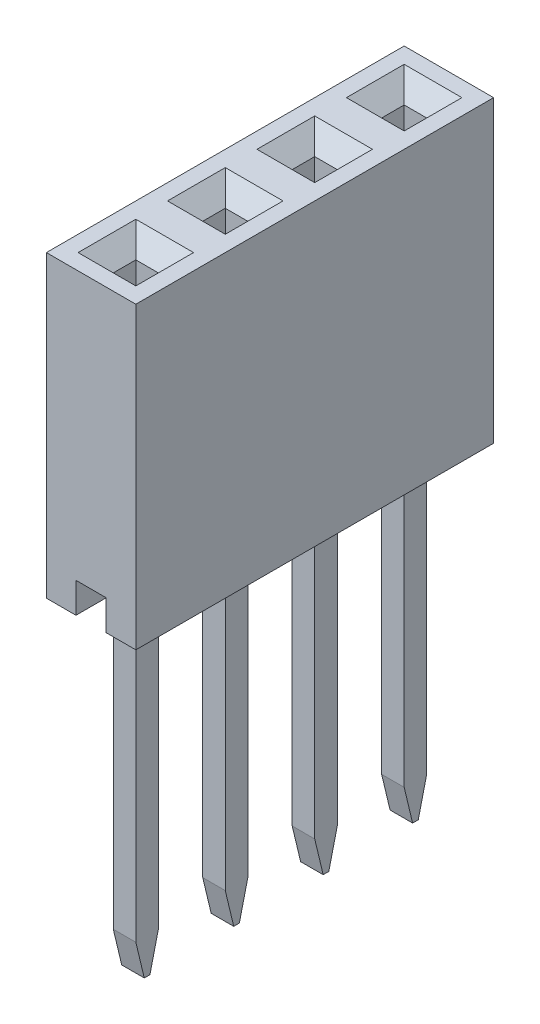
ISO-10303-21;
HEADER;
FILE_DESCRIPTION(('STEP AP214'),'2;1');
FILE_NAME('part.step','',(''),(''),'','','');
FILE_SCHEMA(('AUTOMOTIVE_DESIGN { 1 0 10303 214 1 1 1 1 }'));
ENDSEC;
DATA;
#1=APPLICATION_CONTEXT('core data for automotive mechanical design processes');
#2=APPLICATION_PROTOCOL_DEFINITION('international standard','automotive_design',2000,#1);
#3=PRODUCT_CONTEXT('',#1,'mechanical');
#4=PRODUCT('Part','Part','',(#3));
#5=PRODUCT_RELATED_PRODUCT_CATEGORY('part','',(#4));
#6=PRODUCT_DEFINITION_FORMATION('','',#4);
#7=PRODUCT_DEFINITION_CONTEXT('part definition',#1,'design');
#8=PRODUCT_DEFINITION('design','',#6,#7);
#9=PRODUCT_DEFINITION_SHAPE('','',#8);
#10=(LENGTH_UNIT() NAMED_UNIT(*) SI_UNIT(.MILLI.,.METRE.));
#11=(NAMED_UNIT(*) PLANE_ANGLE_UNIT() SI_UNIT($,.RADIAN.));
#12=(NAMED_UNIT(*) SI_UNIT($,.STERADIAN.) SOLID_ANGLE_UNIT());
#13=UNCERTAINTY_MEASURE_WITH_UNIT(LENGTH_MEASURE(1.E-05),#10,'distance_accuracy_value','');
#14=(GEOMETRIC_REPRESENTATION_CONTEXT(3) GLOBAL_UNCERTAINTY_ASSIGNED_CONTEXT((#13)) GLOBAL_UNIT_ASSIGNED_CONTEXT((#10,
#11,#12)) REPRESENTATION_CONTEXT('',''));
#15=CARTESIAN_POINT('',(0.,0.,0.));
#16=DIRECTION('',(0.,0.,1.));
#17=DIRECTION('',(1.,0.,0.));
#18=AXIS2_PLACEMENT_3D('',#15,#16,#17);
#19=CARTESIAN_POINT('',(1.59,-6.,8.89));
#20=DIRECTION('',(1.,0.,0.));
#21=DIRECTION('',(0.,1.,0.));
#22=AXIS2_PLACEMENT_3D('',#19,#20,#21);
#23=PLANE('',#22);
#24=DIRECTION('',(0.,0.905418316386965,-0.424520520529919));
#25=VECTOR('',#24,1.);
#26=CARTESIAN_POINT('',(1.59,-1.36525862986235,9.11));
#27=LINE('',#26,#25);
#28=CARTESIAN_POINT('',(1.59,-1.57853885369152,9.21));
#29=VERTEX_POINT('',#28);
#30=CARTESIAN_POINT('',(1.59,-1.36525862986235,9.11));
#31=VERTEX_POINT('',#30);
#32=EDGE_CURVE('P0_E241',#29,#31,#27,.T.);
#33=ORIENTED_EDGE('',*,*,#32,.T.);
#34=DIRECTION('',(0.,0.630211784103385,0.776423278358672));
#35=VECTOR('',#34,1.);
#36=CARTESIAN_POINT('',(1.59,-1.36525862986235,9.11));
#37=LINE('',#36,#35);
#38=CARTESIAN_POINT('',(1.59,-1.,9.56));
#39=VERTEX_POINT('',#38);
#40=EDGE_CURVE('P0_E26',#31,#39,#37,.T.);
#41=ORIENTED_EDGE('',*,*,#40,.T.);
#42=DIRECTION('',(0.,-0.999869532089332,0.0161529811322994));
#43=VECTOR('',#42,1.);
#44=CARTESIAN_POINT('',(1.59,-7.19,9.66));
#45=LINE('',#44,#43);
#46=CARTESIAN_POINT('',(1.59,-7.19,9.66));
#47=VERTEX_POINT('',#46);
#48=EDGE_CURVE('P0_E267',#39,#47,#45,.T.);
#49=ORIENTED_EDGE('',*,*,#48,.T.);
#50=DIRECTION('',(0.,-0.707106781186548,-0.707106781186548));
#51=VECTOR('',#50,1.);
#52=CARTESIAN_POINT('',(1.59,-7.64,9.21));
#53=LINE('',#52,#51);
#54=CARTESIAN_POINT('',(1.59,-7.64,9.21));
#55=VERTEX_POINT('',#54);
#56=EDGE_CURVE('P0_E188',#47,#55,#53,.T.);
#57=ORIENTED_EDGE('',*,*,#56,.T.);
#58=DIRECTION('',(0.,-1.,0.));
#59=VECTOR('',#58,1.);
#60=CARTESIAN_POINT('',(1.59,-16.64,9.21));
#61=LINE('',#60,#59);
#62=CARTESIAN_POINT('',(1.59,-16.64,9.21));
#63=VERTEX_POINT('',#62);
#64=EDGE_CURVE('P0_E197',#55,#63,#61,.T.);
#65=ORIENTED_EDGE('',*,*,#64,.T.);
#66=DIRECTION('',(0.,-0.972387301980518,-0.233372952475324));
#67=VECTOR('',#66,1.);
#68=CARTESIAN_POINT('',(1.59,-16.64,9.21));
#69=LINE('',#68,#67);
#70=CARTESIAN_POINT('',(1.59,-17.64,8.97));
#71=VERTEX_POINT('',#70);
#72=EDGE_CURVE('P0_E200',#63,#71,#69,.T.);
#73=ORIENTED_EDGE('',*,*,#72,.T.);
#74=DIRECTION('',(0.,0.,-1.));
#75=VECTOR('',#74,1.);
#76=CARTESIAN_POINT('',(1.59,-17.64,8.81));
#77=LINE('',#76,#75);
#78=CARTESIAN_POINT('',(1.59,-17.64,8.81));
#79=VERTEX_POINT('',#78);
#80=EDGE_CURVE('P0_E132',#71,#79,#77,.T.);
#81=ORIENTED_EDGE('',*,*,#80,.T.);
#82=DIRECTION('',(0.,0.972387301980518,-0.233372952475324));
#83=VECTOR('',#82,1.);
#84=CARTESIAN_POINT('',(1.59,-17.64,8.81));
#85=LINE('',#84,#83);
#86=CARTESIAN_POINT('',(1.59,-16.64,8.57));
#87=VERTEX_POINT('',#86);
#88=EDGE_CURVE('P0_E214',#79,#87,#85,.T.);
#89=ORIENTED_EDGE('',*,*,#88,.T.);
#90=DIRECTION('',(0.,1.,0.));
#91=VECTOR('',#90,1.);
#92=CARTESIAN_POINT('',(1.59,-7.64,8.57));
#93=LINE('',#92,#91);
#94=CARTESIAN_POINT('',(1.59,-7.64,8.57));
#95=VERTEX_POINT('',#94);
#96=EDGE_CURVE('P0_E225',#87,#95,#93,.T.);
#97=ORIENTED_EDGE('',*,*,#96,.T.);
#98=DIRECTION('',(0.,0.707106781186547,-0.707106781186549));
#99=VECTOR('',#98,1.);
#100=CARTESIAN_POINT('',(1.59,-7.19,8.12));
#101=LINE('',#100,#99);
#102=CARTESIAN_POINT('',(1.59,-7.19,8.12));
#103=VERTEX_POINT('',#102);
#104=EDGE_CURVE('P0_E230',#95,#103,#101,.T.);
#105=ORIENTED_EDGE('',*,*,#104,.T.);
#106=DIRECTION('',(0.,0.999869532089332,0.0161529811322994));
#107=VECTOR('',#106,1.);
#108=CARTESIAN_POINT('',(1.59,-1.,8.22));
#109=LINE('',#108,#107);
#110=CARTESIAN_POINT('',(1.59,-1.,8.22));
#111=VERTEX_POINT('',#110);
#112=EDGE_CURVE('P0_E232',#103,#111,#109,.T.);
#113=ORIENTED_EDGE('',*,*,#112,.T.);
#114=DIRECTION('',(0.,-0.630211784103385,0.776423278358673));
#115=VECTOR('',#114,1.);
#116=CARTESIAN_POINT('',(1.59,-1.36525862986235,8.67));
#117=LINE('',#116,#115);
#118=CARTESIAN_POINT('',(1.59,-1.36525862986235,8.67));
#119=VERTEX_POINT('',#118);
#120=EDGE_CURVE('P0_E279',#111,#119,#117,.T.);
#121=ORIENTED_EDGE('',*,*,#120,.T.);
#122=DIRECTION('',(0.,-0.905418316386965,-0.424520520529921));
#123=VECTOR('',#122,1.);
#124=CARTESIAN_POINT('',(1.59,-1.36525862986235,8.67));
#125=LINE('',#124,#123);
#126=CARTESIAN_POINT('',(1.59,-1.57853885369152,8.57));
#127=VERTEX_POINT('',#126);
#128=EDGE_CURVE('P0_E247',#119,#127,#125,.T.);
#129=ORIENTED_EDGE('',*,*,#128,.T.);
#130=DIRECTION('',(0.,-1.,0.));
#131=VECTOR('',#130,1.);
#132=CARTESIAN_POINT('',(1.59,-6.,8.57));
#133=LINE('',#132,#131);
#134=CARTESIAN_POINT('',(1.59,-6.,8.57));
#135=VERTEX_POINT('',#134);
#136=EDGE_CURVE('P0_E88',#127,#135,#133,.T.);
#137=ORIENTED_EDGE('',*,*,#136,.T.);
#138=CARTESIAN_POINT('',(1.59,-6.,8.89));
#139=DIRECTION('',(-1.,0.,0.));
#140=DIRECTION('',(0.,0.,-1.));
#141=AXIS2_PLACEMENT_3D('',#138,#139,#140);
#142=CIRCLE('',#141,0.32);
#143=CARTESIAN_POINT('',(1.59,-6.,9.21));
#144=VERTEX_POINT('',#143);
#145=EDGE_CURVE('P0_E256',#135,#144,#142,.T.);
#146=ORIENTED_EDGE('',*,*,#145,.T.);
#147=DIRECTION('',(0.,1.,0.));
#148=VECTOR('',#147,1.);
#149=CARTESIAN_POINT('',(1.59,-1.57853885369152,9.21));
#150=LINE('',#149,#148);
#151=EDGE_CURVE('P0_E342',#144,#29,#150,.T.);
#152=ORIENTED_EDGE('',*,*,#151,.T.);
#153=EDGE_LOOP('',(#33,#41,#49,#57,#65,#73,#81,#89,#97,#105,#113,#121,#129,#137,#146,#152));
#154=FACE_BOUND('',#153,.T.);
#155=ADVANCED_FACE('P0_F16',(#154),#23,.T.);
#156=CARTESIAN_POINT('',(0.95,-6.,8.89));
#157=DIRECTION('',(1.,0.,0.));
#158=DIRECTION('',(0.,1.,0.));
#159=AXIS2_PLACEMENT_3D('',#156,#157,#158);
#160=PLANE('',#159);
#161=DIRECTION('',(0.,0.905418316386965,-0.424520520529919));
#162=VECTOR('',#161,1.);
#163=CARTESIAN_POINT('',(0.95,-1.36525862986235,9.11));
#164=LINE('',#163,#162);
#165=CARTESIAN_POINT('',(0.95,-1.57853885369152,9.21));
#166=VERTEX_POINT('',#165);
#167=CARTESIAN_POINT('',(0.95,-1.36525862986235,9.11));
#168=VERTEX_POINT('',#167);
#169=EDGE_CURVE('P0_E240',#166,#168,#164,.T.);
#170=ORIENTED_EDGE('',*,*,#169,.F.);
#171=DIRECTION('',(0.,1.,0.));
#172=VECTOR('',#171,1.);
#173=CARTESIAN_POINT('',(0.95,-1.57853885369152,9.21));
#174=LINE('',#173,#172);
#175=CARTESIAN_POINT('',(0.95,-6.,9.21));
#176=VERTEX_POINT('',#175);
#177=EDGE_CURVE('P0_E260',#176,#166,#174,.T.);
#178=ORIENTED_EDGE('',*,*,#177,.F.);
#179=CARTESIAN_POINT('',(0.95,-6.,8.89));
#180=DIRECTION('',(-1.,0.,0.));
#181=DIRECTION('',(0.,0.,-1.));
#182=AXIS2_PLACEMENT_3D('',#179,#180,#181);
#183=CIRCLE('',#182,0.32);
#184=CARTESIAN_POINT('',(0.95,-6.,8.57));
#185=VERTEX_POINT('',#184);
#186=EDGE_CURVE('P0_E332',#185,#176,#183,.T.);
#187=ORIENTED_EDGE('',*,*,#186,.F.);
#188=DIRECTION('',(0.,-1.,0.));
#189=VECTOR('',#188,1.);
#190=CARTESIAN_POINT('',(0.95,-6.,8.57));
#191=LINE('',#190,#189);
#192=CARTESIAN_POINT('',(0.95,-1.57853885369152,8.57));
#193=VERTEX_POINT('',#192);
#194=EDGE_CURVE('P0_E73',#193,#185,#191,.T.);
#195=ORIENTED_EDGE('',*,*,#194,.F.);
#196=DIRECTION('',(0.,-0.905418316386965,-0.424520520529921));
#197=VECTOR('',#196,1.);
#198=CARTESIAN_POINT('',(0.95,-1.36525862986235,8.67));
#199=LINE('',#198,#197);
#200=CARTESIAN_POINT('',(0.95,-1.36525862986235,8.67));
#201=VERTEX_POINT('',#200);
#202=EDGE_CURVE('P0_E254',#201,#193,#199,.T.);
#203=ORIENTED_EDGE('',*,*,#202,.F.);
#204=DIRECTION('',(0.,-0.630211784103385,0.776423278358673));
#205=VECTOR('',#204,1.);
#206=CARTESIAN_POINT('',(0.95,-1.36525862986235,8.67));
#207=LINE('',#206,#205);
#208=CARTESIAN_POINT('',(0.95,-1.,8.22));
#209=VERTEX_POINT('',#208);
#210=EDGE_CURVE('P0_E235',#209,#201,#207,.T.);
#211=ORIENTED_EDGE('',*,*,#210,.F.);
#212=DIRECTION('',(0.,0.999869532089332,0.0161529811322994));
#213=VECTOR('',#212,1.);
#214=CARTESIAN_POINT('',(0.95,-1.,8.22));
#215=LINE('',#214,#213);
#216=CARTESIAN_POINT('',(0.95,-7.19,8.12));
#217=VERTEX_POINT('',#216);
#218=EDGE_CURVE('P0_E227',#217,#209,#215,.T.);
#219=ORIENTED_EDGE('',*,*,#218,.F.);
#220=DIRECTION('',(0.,0.707106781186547,-0.707106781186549));
#221=VECTOR('',#220,1.);
#222=CARTESIAN_POINT('',(0.95,-7.19,8.12));
#223=LINE('',#222,#221);
#224=CARTESIAN_POINT('',(0.95,-7.64,8.57));
#225=VERTEX_POINT('',#224);
#226=EDGE_CURVE('P0_E221',#225,#217,#223,.T.);
#227=ORIENTED_EDGE('',*,*,#226,.F.);
#228=DIRECTION('',(0.,1.,0.));
#229=VECTOR('',#228,1.);
#230=CARTESIAN_POINT('',(0.95,-7.64,8.57));
#231=LINE('',#230,#229);
#232=CARTESIAN_POINT('',(0.95,-16.64,8.57));
#233=VERTEX_POINT('',#232);
#234=EDGE_CURVE('P0_E297',#233,#225,#231,.T.);
#235=ORIENTED_EDGE('',*,*,#234,.F.);
#236=DIRECTION('',(0.,0.972387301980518,-0.233372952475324));
#237=VECTOR('',#236,1.);
#238=CARTESIAN_POINT('',(0.95,-17.64,8.81));
#239=LINE('',#238,#237);
#240=CARTESIAN_POINT('',(0.95,-17.64,8.81));
#241=VERTEX_POINT('',#240);
#242=EDGE_CURVE('P0_E280',#241,#233,#239,.T.);
#243=ORIENTED_EDGE('',*,*,#242,.F.);
#244=DIRECTION('',(0.,0.,-1.));
#245=VECTOR('',#244,1.);
#246=CARTESIAN_POINT('',(0.95,-17.64,8.81));
#247=LINE('',#246,#245);
#248=CARTESIAN_POINT('',(0.95,-17.64,8.97));
#249=VERTEX_POINT('',#248);
#250=EDGE_CURVE('P0_E117',#249,#241,#247,.T.);
#251=ORIENTED_EDGE('',*,*,#250,.F.);
#252=DIRECTION('',(0.,-0.972387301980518,-0.233372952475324));
#253=VECTOR('',#252,1.);
#254=CARTESIAN_POINT('',(0.95,-16.64,9.21));
#255=LINE('',#254,#253);
#256=CARTESIAN_POINT('',(0.95,-16.64,9.21));
#257=VERTEX_POINT('',#256);
#258=EDGE_CURVE('P0_E191',#257,#249,#255,.T.);
#259=ORIENTED_EDGE('',*,*,#258,.F.);
#260=DIRECTION('',(0.,-1.,0.));
#261=VECTOR('',#260,1.);
#262=CARTESIAN_POINT('',(0.95,-16.64,9.21));
#263=LINE('',#262,#261);
#264=CARTESIAN_POINT('',(0.95,-7.64,9.21));
#265=VERTEX_POINT('',#264);
#266=EDGE_CURVE('P0_E178',#265,#257,#263,.T.);
#267=ORIENTED_EDGE('',*,*,#266,.F.);
#268=DIRECTION('',(0.,-0.707106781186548,-0.707106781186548));
#269=VECTOR('',#268,1.);
#270=CARTESIAN_POINT('',(0.95,-7.64,9.21));
#271=LINE('',#270,#269);
#272=CARTESIAN_POINT('',(0.95,-7.19,9.66));
#273=VERTEX_POINT('',#272);
#274=EDGE_CURVE('P0_E220',#273,#265,#271,.T.);
#275=ORIENTED_EDGE('',*,*,#274,.F.);
#276=DIRECTION('',(0.,-0.999869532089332,0.0161529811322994));
#277=VECTOR('',#276,1.);
#278=CARTESIAN_POINT('',(0.95,-7.19,9.66));
#279=LINE('',#278,#277);
#280=CARTESIAN_POINT('',(0.95,-1.,9.56));
#281=VERTEX_POINT('',#280);
#282=EDGE_CURVE('P0_E273',#281,#273,#279,.T.);
#283=ORIENTED_EDGE('',*,*,#282,.F.);
#284=DIRECTION('',(0.,0.630211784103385,0.776423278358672));
#285=VECTOR('',#284,1.);
#286=CARTESIAN_POINT('',(0.95,-1.36525862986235,9.11));
#287=LINE('',#286,#285);
#288=EDGE_CURVE('P0_E11',#168,#281,#287,.T.);
#289=ORIENTED_EDGE('',*,*,#288,.F.);
#290=EDGE_LOOP('',(#170,#178,#187,#195,#203,#211,#219,#227,#235,#243,#251,#259,#267,#275,#283,#289));
#291=FACE_BOUND('',#290,.T.);
#292=ADVANCED_FACE('P0_F193',(#291),#160,.F.);
#293=CARTESIAN_POINT('',(0.95,-1.36525862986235,9.11));
#294=DIRECTION('',(0.,0.776423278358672,-0.630211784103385));
#295=DIRECTION('',(-1.,0.,0.));
#296=AXIS2_PLACEMENT_3D('',#293,#294,#295);
#297=PLANE('',#296);
#298=DIRECTION('',(1.,0.,0.));
#299=VECTOR('',#298,1.);
#300=CARTESIAN_POINT('',(0.95,-1.,9.56));
#301=LINE('',#300,#299);
#302=EDGE_CURVE('P0_E270',#281,#39,#301,.T.);
#303=ORIENTED_EDGE('',*,*,#302,.T.);
#304=ORIENTED_EDGE('',*,*,#40,.F.);
#305=DIRECTION('',(1.,0.,0.));
#306=VECTOR('',#305,1.);
#307=CARTESIAN_POINT('',(0.95,-1.36525862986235,9.11));
#308=LINE('',#307,#306);
#309=EDGE_CURVE('P0_E263',#168,#31,#308,.T.);
#310=ORIENTED_EDGE('',*,*,#309,.F.);
#311=ORIENTED_EDGE('',*,*,#288,.T.);
#312=EDGE_LOOP('',(#303,#304,#310,#311));
#313=FACE_BOUND('',#312,.T.);
#314=ADVANCED_FACE('P0_F382',(#313),#297,.T.);
#315=CARTESIAN_POINT('',(0.95,-7.19,9.66));
#316=DIRECTION('',(0.,0.0161529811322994,0.999869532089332));
#317=DIRECTION('',(1.,0.,0.));
#318=AXIS2_PLACEMENT_3D('',#315,#316,#317);
#319=PLANE('',#318);
#320=DIRECTION('',(1.,0.,0.));
#321=VECTOR('',#320,1.);
#322=CARTESIAN_POINT('',(0.95,-7.19,9.66));
#323=LINE('',#322,#321);
#324=EDGE_CURVE('P0_E216',#273,#47,#323,.T.);
#325=ORIENTED_EDGE('',*,*,#324,.T.);
#326=ORIENTED_EDGE('',*,*,#48,.F.);
#327=ORIENTED_EDGE('',*,*,#302,.F.);
#328=ORIENTED_EDGE('',*,*,#282,.T.);
#329=EDGE_LOOP('',(#325,#326,#327,#328));
#330=FACE_BOUND('',#329,.T.);
#331=ADVANCED_FACE('P0_F319',(#330),#319,.T.);
#332=CARTESIAN_POINT('',(0.95,-7.64,9.21));
#333=DIRECTION('',(0.,-0.707106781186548,0.707106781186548));
#334=DIRECTION('',(-1.,0.,0.));
#335=AXIS2_PLACEMENT_3D('',#332,#333,#334);
#336=PLANE('',#335);
#337=DIRECTION('',(1.,0.,0.));
#338=VECTOR('',#337,1.);
#339=CARTESIAN_POINT('',(0.95,-7.64,9.21));
#340=LINE('',#339,#338);
#341=EDGE_CURVE('P0_E184',#265,#55,#340,.T.);
#342=ORIENTED_EDGE('',*,*,#341,.T.);
#343=ORIENTED_EDGE('',*,*,#56,.F.);
#344=ORIENTED_EDGE('',*,*,#324,.F.);
#345=ORIENTED_EDGE('',*,*,#274,.T.);
#346=EDGE_LOOP('',(#342,#343,#344,#345));
#347=FACE_BOUND('',#346,.T.);
#348=ADVANCED_FACE('P0_F311',(#347),#336,.T.);
#349=CARTESIAN_POINT('',(0.95,-16.64,9.21));
#350=DIRECTION('',(0.,0.,1.));
#351=DIRECTION('',(1.,0.,0.));
#352=AXIS2_PLACEMENT_3D('',#349,#350,#351);
#353=PLANE('',#352);
#354=DIRECTION('',(1.,0.,0.));
#355=VECTOR('',#354,1.);
#356=CARTESIAN_POINT('',(0.95,-16.64,9.21));
#357=LINE('',#356,#355);
#358=EDGE_CURVE('P0_E20',#257,#63,#357,.T.);
#359=ORIENTED_EDGE('',*,*,#358,.T.);
#360=ORIENTED_EDGE('',*,*,#64,.F.);
#361=ORIENTED_EDGE('',*,*,#341,.F.);
#362=ORIENTED_EDGE('',*,*,#266,.T.);
#363=EDGE_LOOP('',(#359,#360,#361,#362));
#364=FACE_BOUND('',#363,.T.);
#365=ADVANCED_FACE('P0_F18',(#364),#353,.T.);
#366=CARTESIAN_POINT('',(0.95,-16.64,9.21));
#367=DIRECTION('',(0.,-0.233372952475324,0.972387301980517));
#368=DIRECTION('',(-1.,0.,0.));
#369=AXIS2_PLACEMENT_3D('',#366,#367,#368);
#370=PLANE('',#369);
#371=DIRECTION('',(1.,0.,0.));
#372=VECTOR('',#371,1.);
#373=CARTESIAN_POINT('',(0.95,-17.64,8.97));
#374=LINE('',#373,#372);
#375=EDGE_CURVE('P0_E210',#249,#71,#374,.T.);
#376=ORIENTED_EDGE('',*,*,#375,.T.);
#377=ORIENTED_EDGE('',*,*,#72,.F.);
#378=ORIENTED_EDGE('',*,*,#358,.F.);
#379=ORIENTED_EDGE('',*,*,#258,.T.);
#380=EDGE_LOOP('',(#376,#377,#378,#379));
#381=FACE_BOUND('',#380,.T.);
#382=ADVANCED_FACE('P0_F199',(#381),#370,.T.);
#383=CARTESIAN_POINT('',(0.95,-17.64,8.81));
#384=DIRECTION('',(0.,-1.,0.));
#385=DIRECTION('',(0.,0.,-1.));
#386=AXIS2_PLACEMENT_3D('',#383,#384,#385);
#387=PLANE('',#386);
#388=DIRECTION('',(1.,0.,0.));
#389=VECTOR('',#388,1.);
#390=CARTESIAN_POINT('',(0.95,-17.64,8.81));
#391=LINE('',#390,#389);
#392=EDGE_CURVE('P0_E282',#241,#79,#391,.T.);
#393=ORIENTED_EDGE('',*,*,#392,.T.);
#394=ORIENTED_EDGE('',*,*,#80,.F.);
#395=ORIENTED_EDGE('',*,*,#375,.F.);
#396=ORIENTED_EDGE('',*,*,#250,.T.);
#397=EDGE_LOOP('',(#393,#394,#395,#396));
#398=FACE_BOUND('',#397,.T.);
#399=ADVANCED_FACE('P0_F419',(#398),#387,.T.);
#400=CARTESIAN_POINT('',(0.95,-17.64,8.81));
#401=DIRECTION('',(0.,-0.233372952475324,-0.972387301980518));
#402=DIRECTION('',(0.,-0.972387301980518,0.233372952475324));
#403=AXIS2_PLACEMENT_3D('',#400,#401,#402);
#404=PLANE('',#403);
#405=DIRECTION('',(1.,0.,0.));
#406=VECTOR('',#405,1.);
#407=CARTESIAN_POINT('',(0.95,-16.64,8.57));
#408=LINE('',#407,#406);
#409=EDGE_CURVE('P0_E266',#233,#87,#408,.T.);
#410=ORIENTED_EDGE('',*,*,#409,.T.);
#411=ORIENTED_EDGE('',*,*,#88,.F.);
#412=ORIENTED_EDGE('',*,*,#392,.F.);
#413=ORIENTED_EDGE('',*,*,#242,.T.);
#414=EDGE_LOOP('',(#410,#411,#412,#413));
#415=FACE_BOUND('',#414,.T.);
#416=ADVANCED_FACE('P0_F421',(#415),#404,.T.);
#417=CARTESIAN_POINT('',(0.95,-7.64,8.57));
#418=DIRECTION('',(0.,0.,-1.));
#419=DIRECTION('',(-1.,0.,0.));
#420=AXIS2_PLACEMENT_3D('',#417,#418,#419);
#421=PLANE('',#420);
#422=DIRECTION('',(1.,0.,0.));
#423=VECTOR('',#422,1.);
#424=CARTESIAN_POINT('',(0.95,-7.64,8.57));
#425=LINE('',#424,#423);
#426=EDGE_CURVE('P0_E226',#225,#95,#425,.T.);
#427=ORIENTED_EDGE('',*,*,#426,.T.);
#428=ORIENTED_EDGE('',*,*,#96,.F.);
#429=ORIENTED_EDGE('',*,*,#409,.F.);
#430=ORIENTED_EDGE('',*,*,#234,.T.);
#431=EDGE_LOOP('',(#427,#428,#429,#430));
#432=FACE_BOUND('',#431,.T.);
#433=ADVANCED_FACE('P0_F408',(#432),#421,.T.);
#434=CARTESIAN_POINT('',(0.95,-7.19,8.12));
#435=DIRECTION('',(0.,-0.707106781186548,-0.707106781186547));
#436=DIRECTION('',(0.,0.707106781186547,-0.707106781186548));
#437=AXIS2_PLACEMENT_3D('',#434,#435,#436);
#438=PLANE('',#437);
#439=DIRECTION('',(1.,0.,0.));
#440=VECTOR('',#439,1.);
#441=CARTESIAN_POINT('',(0.95,-7.19,8.12));
#442=LINE('',#441,#440);
#443=EDGE_CURVE('P0_E231',#217,#103,#442,.T.);
#444=ORIENTED_EDGE('',*,*,#443,.T.);
#445=ORIENTED_EDGE('',*,*,#104,.F.);
#446=ORIENTED_EDGE('',*,*,#426,.F.);
#447=ORIENTED_EDGE('',*,*,#226,.T.);
#448=EDGE_LOOP('',(#444,#445,#446,#447));
#449=FACE_BOUND('',#448,.T.);
#450=ADVANCED_FACE('P0_F404',(#449),#438,.T.);
#451=CARTESIAN_POINT('',(0.95,-1.,8.22));
#452=DIRECTION('',(0.,0.0161529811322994,-0.999869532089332));
#453=DIRECTION('',(-1.,0.,0.));
#454=AXIS2_PLACEMENT_3D('',#451,#452,#453);
#455=PLANE('',#454);
#456=DIRECTION('',(1.,0.,0.));
#457=VECTOR('',#456,1.);
#458=CARTESIAN_POINT('',(0.95,-1.,8.22));
#459=LINE('',#458,#457);
#460=EDGE_CURVE('P0_E276',#209,#111,#459,.T.);
#461=ORIENTED_EDGE('',*,*,#460,.T.);
#462=ORIENTED_EDGE('',*,*,#112,.F.);
#463=ORIENTED_EDGE('',*,*,#443,.F.);
#464=ORIENTED_EDGE('',*,*,#218,.T.);
#465=EDGE_LOOP('',(#461,#462,#463,#464));
#466=FACE_BOUND('',#465,.T.);
#467=ADVANCED_FACE('P0_F400',(#466),#455,.T.);
#468=CARTESIAN_POINT('',(0.95,-1.36525862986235,8.67));
#469=DIRECTION('',(0.,0.776423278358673,0.630211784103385));
#470=DIRECTION('',(1.,0.,0.));
#471=AXIS2_PLACEMENT_3D('',#468,#469,#470);
#472=PLANE('',#471);
#473=DIRECTION('',(1.,0.,0.));
#474=VECTOR('',#473,1.);
#475=CARTESIAN_POINT('',(0.95,-1.36525862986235,8.67));
#476=LINE('',#475,#474);
#477=EDGE_CURVE('P0_E251',#201,#119,#476,.T.);
#478=ORIENTED_EDGE('',*,*,#477,.T.);
#479=ORIENTED_EDGE('',*,*,#120,.F.);
#480=ORIENTED_EDGE('',*,*,#460,.F.);
#481=ORIENTED_EDGE('',*,*,#210,.T.);
#482=EDGE_LOOP('',(#478,#479,#480,#481));
#483=FACE_BOUND('',#482,.T.);
#484=ADVANCED_FACE('P0_F403',(#483),#472,.T.);
#485=CARTESIAN_POINT('',(0.95,-1.36525862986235,8.67));
#486=DIRECTION('',(0.,-0.424520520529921,0.905418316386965));
#487=DIRECTION('',(-1.,0.,0.));
#488=AXIS2_PLACEMENT_3D('',#485,#486,#487);
#489=PLANE('',#488);
#490=DIRECTION('',(1.,0.,0.));
#491=VECTOR('',#490,1.);
#492=CARTESIAN_POINT('',(0.95,-1.57853885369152,8.57));
#493=LINE('',#492,#491);
#494=EDGE_CURVE('P0_E248',#193,#127,#493,.T.);
#495=ORIENTED_EDGE('',*,*,#494,.T.);
#496=ORIENTED_EDGE('',*,*,#128,.F.);
#497=ORIENTED_EDGE('',*,*,#477,.F.);
#498=ORIENTED_EDGE('',*,*,#202,.T.);
#499=EDGE_LOOP('',(#495,#496,#497,#498));
#500=FACE_BOUND('',#499,.T.);
#501=ADVANCED_FACE('P0_F418',(#500),#489,.T.);
#502=CARTESIAN_POINT('',(0.95,-6.,8.57));
#503=DIRECTION('',(0.,0.,1.));
#504=DIRECTION('',(1.,0.,0.));
#505=AXIS2_PLACEMENT_3D('',#502,#503,#504);
#506=PLANE('',#505);
#507=DIRECTION('',(1.,0.,0.));
#508=VECTOR('',#507,1.);
#509=CARTESIAN_POINT('',(0.95,-6.,8.57));
#510=LINE('',#509,#508);
#511=EDGE_CURVE('P0_E259',#185,#135,#510,.T.);
#512=ORIENTED_EDGE('',*,*,#511,.T.);
#513=ORIENTED_EDGE('',*,*,#136,.F.);
#514=ORIENTED_EDGE('',*,*,#494,.F.);
#515=ORIENTED_EDGE('',*,*,#194,.T.);
#516=EDGE_LOOP('',(#512,#513,#514,#515));
#517=FACE_BOUND('',#516,.T.);
#518=ADVANCED_FACE('P0_F416',(#517),#506,.T.);
#519=CARTESIAN_POINT('',(0.95,-6.,8.89));
#520=DIRECTION('',(1.,0.,0.));
#521=DIRECTION('',(0.,0.,-1.));
#522=AXIS2_PLACEMENT_3D('',#519,#520,#521);
#523=CYLINDRICAL_SURFACE('',#522,0.32);
#524=DIRECTION('',(1.,0.,0.));
#525=VECTOR('',#524,1.);
#526=CARTESIAN_POINT('',(0.95,-6.,9.21));
#527=LINE('',#526,#525);
#528=EDGE_CURVE('P0_E304',#176,#144,#527,.T.);
#529=ORIENTED_EDGE('',*,*,#528,.T.);
#530=ORIENTED_EDGE('',*,*,#145,.F.);
#531=ORIENTED_EDGE('',*,*,#511,.F.);
#532=ORIENTED_EDGE('',*,*,#186,.T.);
#533=EDGE_LOOP('',(#529,#530,#531,#532));
#534=FACE_BOUND('',#533,.T.);
#535=ADVANCED_FACE('P0_F371',(#534),#523,.F.);
#536=CARTESIAN_POINT('',(0.95,-1.57853885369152,9.21));
#537=DIRECTION('',(0.,0.,-1.));
#538=DIRECTION('',(0.,-1.,0.));
#539=AXIS2_PLACEMENT_3D('',#536,#537,#538);
#540=PLANE('',#539);
#541=DIRECTION('',(1.,0.,0.));
#542=VECTOR('',#541,1.);
#543=CARTESIAN_POINT('',(0.95,-1.57853885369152,9.21));
#544=LINE('',#543,#542);
#545=EDGE_CURVE('P0_E236',#166,#29,#544,.T.);
#546=ORIENTED_EDGE('',*,*,#545,.T.);
#547=ORIENTED_EDGE('',*,*,#151,.F.);
#548=ORIENTED_EDGE('',*,*,#528,.F.);
#549=ORIENTED_EDGE('',*,*,#177,.T.);
#550=EDGE_LOOP('',(#546,#547,#548,#549));
#551=FACE_BOUND('',#550,.T.);
#552=ADVANCED_FACE('P0_F375',(#551),#540,.T.);
#553=CARTESIAN_POINT('',(0.95,-1.36525862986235,9.11));
#554=DIRECTION('',(0.,-0.424520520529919,-0.905418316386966));
#555=DIRECTION('',(0.,-0.905418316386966,0.424520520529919));
#556=AXIS2_PLACEMENT_3D('',#553,#554,#555);
#557=PLANE('',#556);
#558=ORIENTED_EDGE('',*,*,#309,.T.);
#559=ORIENTED_EDGE('',*,*,#32,.F.);
#560=ORIENTED_EDGE('',*,*,#545,.F.);
#561=ORIENTED_EDGE('',*,*,#169,.T.);
#562=EDGE_LOOP('',(#558,#559,#560,#561));
#563=FACE_BOUND('',#562,.T.);
#564=ADVANCED_FACE('P0_F381',(#563),#557,.T.);
#565=CLOSED_SHELL('',(#155,#292,#314,#331,#348,#365,#382,#399,#416,#433,#450,#467,#484,#501,
#518,#535,#552,#564));
#566=MANIFOLD_SOLID_BREP('P0_B1',#565);
#567=CARTESIAN_POINT('',(1.59,-6.,1.27));
#568=DIRECTION('',(1.,0.,0.));
#569=DIRECTION('',(0.,1.,0.));
#570=AXIS2_PLACEMENT_3D('',#567,#568,#569);
#571=PLANE('',#570);
#572=DIRECTION('',(0.,0.905418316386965,-0.424520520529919));
#573=VECTOR('',#572,1.);
#574=CARTESIAN_POINT('',(1.59,-1.36525862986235,1.49));
#575=LINE('',#574,#573);
#576=CARTESIAN_POINT('',(1.59,-1.57853885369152,1.59));
#577=VERTEX_POINT('',#576);
#578=CARTESIAN_POINT('',(1.59,-1.36525862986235,1.49));
#579=VERTEX_POINT('',#578);
#580=EDGE_CURVE('P1_E290',#577,#579,#575,.T.);
#581=ORIENTED_EDGE('',*,*,#580,.T.);
#582=DIRECTION('',(0.,0.630211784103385,0.776423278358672));
#583=VECTOR('',#582,1.);
#584=CARTESIAN_POINT('',(1.59,-1.36525862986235,1.49));
#585=LINE('',#584,#583);
#586=CARTESIAN_POINT('',(1.59,-1.,1.94));
#587=VERTEX_POINT('',#586);
#588=EDGE_CURVE('P1_E26',#579,#587,#585,.T.);
#589=ORIENTED_EDGE('',*,*,#588,.T.);
#590=DIRECTION('',(0.,-0.999869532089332,0.0161529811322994));
#591=VECTOR('',#590,1.);
#592=CARTESIAN_POINT('',(1.59,-7.19,2.04));
#593=LINE('',#592,#591);
#594=CARTESIAN_POINT('',(1.59,-7.19,2.04));
#595=VERTEX_POINT('',#594);
#596=EDGE_CURVE('P1_E164',#587,#595,#593,.T.);
#597=ORIENTED_EDGE('',*,*,#596,.T.);
#598=DIRECTION('',(0.,-0.707106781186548,-0.707106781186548));
#599=VECTOR('',#598,1.);
#600=CARTESIAN_POINT('',(1.59,-7.64,1.59));
#601=LINE('',#600,#599);
#602=CARTESIAN_POINT('',(1.59,-7.64,1.59));
#603=VERTEX_POINT('',#602);
#604=EDGE_CURVE('P1_E157',#595,#603,#601,.T.);
#605=ORIENTED_EDGE('',*,*,#604,.T.);
#606=DIRECTION('',(0.,-1.,0.));
#607=VECTOR('',#606,1.);
#608=CARTESIAN_POINT('',(1.59,-16.64,1.59));
#609=LINE('',#608,#607);
#610=CARTESIAN_POINT('',(1.59,-16.64,1.59));
#611=VERTEX_POINT('',#610);
#612=EDGE_CURVE('P1_E161',#603,#611,#609,.T.);
#613=ORIENTED_EDGE('',*,*,#612,.T.);
#614=DIRECTION('',(0.,-0.972387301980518,-0.233372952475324));
#615=VECTOR('',#614,1.);
#616=CARTESIAN_POINT('',(1.59,-16.64,1.59));
#617=LINE('',#616,#615);
#618=CARTESIAN_POINT('',(1.59,-17.64,1.35));
#619=VERTEX_POINT('',#618);
#620=EDGE_CURVE('P1_E196',#611,#619,#617,.T.);
#621=ORIENTED_EDGE('',*,*,#620,.T.);
#622=DIRECTION('',(0.,0.,-1.));
#623=VECTOR('',#622,1.);
#624=CARTESIAN_POINT('',(1.59,-17.64,1.19));
#625=LINE('',#624,#623);
#626=CARTESIAN_POINT('',(1.59,-17.64,1.19));
#627=VERTEX_POINT('',#626);
#628=EDGE_CURVE('P1_E142',#619,#627,#625,.T.);
#629=ORIENTED_EDGE('',*,*,#628,.T.);
#630=DIRECTION('',(0.,0.972387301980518,-0.233372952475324));
#631=VECTOR('',#630,1.);
#632=CARTESIAN_POINT('',(1.59,-17.64,1.19));
#633=LINE('',#632,#631);
#634=CARTESIAN_POINT('',(1.59,-16.64,0.95));
#635=VERTEX_POINT('',#634);
#636=EDGE_CURVE('P1_E220',#627,#635,#633,.T.);
#637=ORIENTED_EDGE('',*,*,#636,.T.);
#638=DIRECTION('',(0.,1.,0.));
#639=VECTOR('',#638,1.);
#640=CARTESIAN_POINT('',(1.59,-7.64,0.95));
#641=LINE('',#640,#639);
#642=CARTESIAN_POINT('',(1.59,-7.64,0.95));
#643=VERTEX_POINT('',#642);
#644=EDGE_CURVE('P1_E238',#635,#643,#641,.T.);
#645=ORIENTED_EDGE('',*,*,#644,.T.);
#646=DIRECTION('',(0.,0.707106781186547,-0.707106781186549));
#647=VECTOR('',#646,1.);
#648=CARTESIAN_POINT('',(1.59,-7.19,0.5));
#649=LINE('',#648,#647);
#650=CARTESIAN_POINT('',(1.59,-7.19,0.5));
#651=VERTEX_POINT('',#650);
#652=EDGE_CURVE('P1_E226',#643,#651,#649,.T.);
#653=ORIENTED_EDGE('',*,*,#652,.T.);
#654=DIRECTION('',(0.,0.999869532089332,0.0161529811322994));
#655=VECTOR('',#654,1.);
#656=CARTESIAN_POINT('',(1.59,-1.,0.6));
#657=LINE('',#656,#655);
#658=CARTESIAN_POINT('',(1.59,-1.,0.6));
#659=VERTEX_POINT('',#658);
#660=EDGE_CURVE('P1_E298',#651,#659,#657,.T.);
#661=ORIENTED_EDGE('',*,*,#660,.T.);
#662=DIRECTION('',(0.,-0.630211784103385,0.776423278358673));
#663=VECTOR('',#662,1.);
#664=CARTESIAN_POINT('',(1.59,-1.36525862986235,1.05));
#665=LINE('',#664,#663);
#666=CARTESIAN_POINT('',(1.59,-1.36525862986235,1.05));
#667=VERTEX_POINT('',#666);
#668=EDGE_CURVE('P1_E198',#659,#667,#665,.T.);
#669=ORIENTED_EDGE('',*,*,#668,.T.);
#670=DIRECTION('',(0.,-0.905418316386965,-0.424520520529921));
#671=VECTOR('',#670,1.);
#672=CARTESIAN_POINT('',(1.59,-1.36525862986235,1.05));
#673=LINE('',#672,#671);
#674=CARTESIAN_POINT('',(1.59,-1.57853885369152,0.95));
#675=VERTEX_POINT('',#674);
#676=EDGE_CURVE('P1_E249',#667,#675,#673,.T.);
#677=ORIENTED_EDGE('',*,*,#676,.T.);
#678=DIRECTION('',(0.,-1.,0.));
#679=VECTOR('',#678,1.);
#680=CARTESIAN_POINT('',(1.59,-6.,0.95));
#681=LINE('',#680,#679);
#682=CARTESIAN_POINT('',(1.59,-6.,0.95));
#683=VERTEX_POINT('',#682);
#684=EDGE_CURVE('P1_E232',#675,#683,#681,.T.);
#685=ORIENTED_EDGE('',*,*,#684,.T.);
#686=CARTESIAN_POINT('',(1.59,-6.,1.27));
#687=DIRECTION('',(-1.,0.,0.));
#688=DIRECTION('',(0.,0.,-1.));
#689=AXIS2_PLACEMENT_3D('',#686,#687,#688);
#690=CIRCLE('',#689,0.32);
#691=CARTESIAN_POINT('',(1.59,-6.,1.59));
#692=VERTEX_POINT('',#691);
#693=EDGE_CURVE('P1_E278',#683,#692,#690,.T.);
#694=ORIENTED_EDGE('',*,*,#693,.T.);
#695=DIRECTION('',(0.,1.,0.));
#696=VECTOR('',#695,1.);
#697=CARTESIAN_POINT('',(1.59,-1.57853885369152,1.59));
#698=LINE('',#697,#696);
#699=EDGE_CURVE('P1_E204',#692,#577,#698,.T.);
#700=ORIENTED_EDGE('',*,*,#699,.T.);
#701=EDGE_LOOP('',(#581,#589,#597,#605,#613,#621,#629,#637,#645,#653,#661,#669,#677,#685,#694,#700));
#702=FACE_BOUND('',#701,.T.);
#703=ADVANCED_FACE('P1_F16',(#702),#571,.T.);
#704=CARTESIAN_POINT('',(0.95,-6.,1.27));
#705=DIRECTION('',(1.,0.,0.));
#706=DIRECTION('',(0.,1.,0.));
#707=AXIS2_PLACEMENT_3D('',#704,#705,#706);
#708=PLANE('',#707);
#709=DIRECTION('',(0.,0.905418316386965,-0.424520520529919));
#710=VECTOR('',#709,1.);
#711=CARTESIAN_POINT('',(0.95,-1.36525862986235,1.49));
#712=LINE('',#711,#710);
#713=CARTESIAN_POINT('',(0.95,-1.57853885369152,1.59));
#714=VERTEX_POINT('',#713);
#715=CARTESIAN_POINT('',(0.95,-1.36525862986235,1.49));
#716=VERTEX_POINT('',#715);
#717=EDGE_CURVE('P1_E207',#714,#716,#712,.T.);
#718=ORIENTED_EDGE('',*,*,#717,.F.);
#719=DIRECTION('',(0.,1.,0.));
#720=VECTOR('',#719,1.);
#721=CARTESIAN_POINT('',(0.95,-1.57853885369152,1.59));
#722=LINE('',#721,#720);
#723=CARTESIAN_POINT('',(0.95,-6.,1.59));
#724=VERTEX_POINT('',#723);
#725=EDGE_CURVE('P1_E283',#724,#714,#722,.T.);
#726=ORIENTED_EDGE('',*,*,#725,.F.);
#727=CARTESIAN_POINT('',(0.95,-6.,1.27));
#728=DIRECTION('',(-1.,0.,0.));
#729=DIRECTION('',(0.,0.,-1.));
#730=AXIS2_PLACEMENT_3D('',#727,#728,#729);
#731=CIRCLE('',#730,0.32);
#732=CARTESIAN_POINT('',(0.95,-6.,0.95));
#733=VERTEX_POINT('',#732);
#734=EDGE_CURVE('P1_E273',#733,#724,#731,.T.);
#735=ORIENTED_EDGE('',*,*,#734,.F.);
#736=DIRECTION('',(0.,-1.,0.));
#737=VECTOR('',#736,1.);
#738=CARTESIAN_POINT('',(0.95,-6.,0.95));
#739=LINE('',#738,#737);
#740=CARTESIAN_POINT('',(0.95,-1.57853885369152,0.95));
#741=VERTEX_POINT('',#740);
#742=EDGE_CURVE('P1_E231',#741,#733,#739,.T.);
#743=ORIENTED_EDGE('',*,*,#742,.F.);
#744=DIRECTION('',(0.,-0.905418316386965,-0.424520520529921));
#745=VECTOR('',#744,1.);
#746=CARTESIAN_POINT('',(0.95,-1.36525862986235,1.05));
#747=LINE('',#746,#745);
#748=CARTESIAN_POINT('',(0.95,-1.36525862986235,1.05));
#749=VERTEX_POINT('',#748);
#750=EDGE_CURVE('P1_E203',#749,#741,#747,.T.);
#751=ORIENTED_EDGE('',*,*,#750,.F.);
#752=DIRECTION('',(0.,-0.630211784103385,0.776423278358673));
#753=VECTOR('',#752,1.);
#754=CARTESIAN_POINT('',(0.95,-1.36525862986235,1.05));
#755=LINE('',#754,#753);
#756=CARTESIAN_POINT('',(0.95,-1.,0.6));
#757=VERTEX_POINT('',#756);
#758=EDGE_CURVE('P1_E211',#757,#749,#755,.T.);
#759=ORIENTED_EDGE('',*,*,#758,.F.);
#760=DIRECTION('',(0.,0.999869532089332,0.0161529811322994));
#761=VECTOR('',#760,1.);
#762=CARTESIAN_POINT('',(0.95,-1.,0.6));
#763=LINE('',#762,#761);
#764=CARTESIAN_POINT('',(0.95,-7.19,0.5));
#765=VERTEX_POINT('',#764);
#766=EDGE_CURVE('P1_E302',#765,#757,#763,.T.);
#767=ORIENTED_EDGE('',*,*,#766,.F.);
#768=DIRECTION('',(0.,0.707106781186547,-0.707106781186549));
#769=VECTOR('',#768,1.);
#770=CARTESIAN_POINT('',(0.95,-7.19,0.5));
#771=LINE('',#770,#769);
#772=CARTESIAN_POINT('',(0.95,-7.64,0.95));
#773=VERTEX_POINT('',#772);
#774=EDGE_CURVE('P1_E225',#773,#765,#771,.T.);
#775=ORIENTED_EDGE('',*,*,#774,.F.);
#776=DIRECTION('',(0.,1.,0.));
#777=VECTOR('',#776,1.);
#778=CARTESIAN_POINT('',(0.95,-7.64,0.95));
#779=LINE('',#778,#777);
#780=CARTESIAN_POINT('',(0.95,-16.64,0.95));
#781=VERTEX_POINT('',#780);
#782=EDGE_CURVE('P1_E237',#781,#773,#779,.T.);
#783=ORIENTED_EDGE('',*,*,#782,.F.);
#784=DIRECTION('',(0.,0.972387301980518,-0.233372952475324));
#785=VECTOR('',#784,1.);
#786=CARTESIAN_POINT('',(0.95,-17.64,1.19));
#787=LINE('',#786,#785);
#788=CARTESIAN_POINT('',(0.95,-17.64,1.19));
#789=VERTEX_POINT('',#788);
#790=EDGE_CURVE('P1_E219',#789,#781,#787,.T.);
#791=ORIENTED_EDGE('',*,*,#790,.F.);
#792=DIRECTION('',(0.,0.,-1.));
#793=VECTOR('',#792,1.);
#794=CARTESIAN_POINT('',(0.95,-17.64,1.19));
#795=LINE('',#794,#793);
#796=CARTESIAN_POINT('',(0.95,-17.64,1.35));
#797=VERTEX_POINT('',#796);
#798=EDGE_CURVE('P1_E130',#797,#789,#795,.T.);
#799=ORIENTED_EDGE('',*,*,#798,.F.);
#800=DIRECTION('',(0.,-0.972387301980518,-0.233372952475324));
#801=VECTOR('',#800,1.);
#802=CARTESIAN_POINT('',(0.95,-16.64,1.59));
#803=LINE('',#802,#801);
#804=CARTESIAN_POINT('',(0.95,-16.64,1.59));
#805=VERTEX_POINT('',#804);
#806=EDGE_CURVE('P1_E186',#805,#797,#803,.T.);
#807=ORIENTED_EDGE('',*,*,#806,.F.);
#808=DIRECTION('',(0.,-1.,0.));
#809=VECTOR('',#808,1.);
#810=CARTESIAN_POINT('',(0.95,-16.64,1.59));
#811=LINE('',#810,#809);
#812=CARTESIAN_POINT('',(0.95,-7.64,1.59));
#813=VERTEX_POINT('',#812);
#814=EDGE_CURVE('P1_E170',#813,#805,#811,.T.);
#815=ORIENTED_EDGE('',*,*,#814,.F.);
#816=DIRECTION('',(0.,-0.707106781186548,-0.707106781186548));
#817=VECTOR('',#816,1.);
#818=CARTESIAN_POINT('',(0.95,-7.64,1.59));
#819=LINE('',#818,#817);
#820=CARTESIAN_POINT('',(0.95,-7.19,2.04));
#821=VERTEX_POINT('',#820);
#822=EDGE_CURVE('P1_E176',#821,#813,#819,.T.);
#823=ORIENTED_EDGE('',*,*,#822,.F.);
#824=DIRECTION('',(0.,-0.999869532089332,0.0161529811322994));
#825=VECTOR('',#824,1.);
#826=CARTESIAN_POINT('',(0.95,-7.19,2.04));
#827=LINE('',#826,#825);
#828=CARTESIAN_POINT('',(0.95,-1.,1.94));
#829=VERTEX_POINT('',#828);
#830=EDGE_CURVE('P1_E262',#829,#821,#827,.T.);
#831=ORIENTED_EDGE('',*,*,#830,.F.);
#832=DIRECTION('',(0.,0.630211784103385,0.776423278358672));
#833=VECTOR('',#832,1.);
#834=CARTESIAN_POINT('',(0.95,-1.36525862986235,1.49));
#835=LINE('',#834,#833);
#836=EDGE_CURVE('P1_E11',#716,#829,#835,.T.);
#837=ORIENTED_EDGE('',*,*,#836,.F.);
#838=EDGE_LOOP('',(#718,#726,#735,#743,#751,#759,#767,#775,#783,#791,#799,#807,#815,#823,#831,#837));
#839=FACE_BOUND('',#838,.T.);
#840=ADVANCED_FACE('P1_F344',(#839),#708,.F.);
#841=CARTESIAN_POINT('',(0.95,-1.36525862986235,1.49));
#842=DIRECTION('',(0.,0.776423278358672,-0.630211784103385));
#843=DIRECTION('',(-1.,0.,0.));
#844=AXIS2_PLACEMENT_3D('',#841,#842,#843);
#845=PLANE('',#844);
#846=DIRECTION('',(1.,0.,0.));
#847=VECTOR('',#846,1.);
#848=CARTESIAN_POINT('',(0.95,-1.,1.94));
#849=LINE('',#848,#847);
#850=EDGE_CURVE('P1_E258',#829,#587,#849,.T.);
#851=ORIENTED_EDGE('',*,*,#850,.T.);
#852=ORIENTED_EDGE('',*,*,#588,.F.);
#853=DIRECTION('',(1.,0.,0.));
#854=VECTOR('',#853,1.);
#855=CARTESIAN_POINT('',(0.95,-1.36525862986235,1.49));
#856=LINE('',#855,#854);
#857=EDGE_CURVE('P1_E286',#716,#579,#856,.T.);
#858=ORIENTED_EDGE('',*,*,#857,.F.);
#859=ORIENTED_EDGE('',*,*,#836,.T.);
#860=EDGE_LOOP('',(#851,#852,#858,#859));
#861=FACE_BOUND('',#860,.T.);
#862=ADVANCED_FACE('P1_F462',(#861),#845,.T.);
#863=CARTESIAN_POINT('',(0.95,-7.19,2.04));
#864=DIRECTION('',(0.,0.0161529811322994,0.999869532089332));
#865=DIRECTION('',(1.,0.,0.));
#866=AXIS2_PLACEMENT_3D('',#863,#864,#865);
#867=PLANE('',#866);
#868=DIRECTION('',(1.,0.,0.));
#869=VECTOR('',#868,1.);
#870=CARTESIAN_POINT('',(0.95,-7.19,2.04));
#871=LINE('',#870,#869);
#872=EDGE_CURVE('P1_E169',#821,#595,#871,.T.);
#873=ORIENTED_EDGE('',*,*,#872,.T.);
#874=ORIENTED_EDGE('',*,*,#596,.F.);
#875=ORIENTED_EDGE('',*,*,#850,.F.);
#876=ORIENTED_EDGE('',*,*,#830,.T.);
#877=EDGE_LOOP('',(#873,#874,#875,#876));
#878=FACE_BOUND('',#877,.T.);
#879=ADVANCED_FACE('P1_F324',(#878),#867,.T.);
#880=CARTESIAN_POINT('',(0.95,-7.64,1.59));
#881=DIRECTION('',(0.,-0.707106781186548,0.707106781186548));
#882=DIRECTION('',(-1.,0.,0.));
#883=AXIS2_PLACEMENT_3D('',#880,#881,#882);
#884=PLANE('',#883);
#885=DIRECTION('',(1.,0.,0.));
#886=VECTOR('',#885,1.);
#887=CARTESIAN_POINT('',(0.95,-7.64,1.59));
#888=LINE('',#887,#886);
#889=EDGE_CURVE('P1_E173',#813,#603,#888,.T.);
#890=ORIENTED_EDGE('',*,*,#889,.T.);
#891=ORIENTED_EDGE('',*,*,#604,.F.);
#892=ORIENTED_EDGE('',*,*,#872,.F.);
#893=ORIENTED_EDGE('',*,*,#822,.T.);
#894=EDGE_LOOP('',(#890,#891,#892,#893));
#895=FACE_BOUND('',#894,.T.);
#896=ADVANCED_FACE('P1_F174',(#895),#884,.T.);
#897=CARTESIAN_POINT('',(0.95,-16.64,1.59));
#898=DIRECTION('',(0.,0.,1.));
#899=DIRECTION('',(1.,0.,0.));
#900=AXIS2_PLACEMENT_3D('',#897,#898,#899);
#901=PLANE('',#900);
#902=DIRECTION('',(1.,0.,0.));
#903=VECTOR('',#902,1.);
#904=CARTESIAN_POINT('',(0.95,-16.64,1.59));
#905=LINE('',#904,#903);
#906=EDGE_CURVE('P1_E183',#805,#611,#905,.T.);
#907=ORIENTED_EDGE('',*,*,#906,.T.);
#908=ORIENTED_EDGE('',*,*,#612,.F.);
#909=ORIENTED_EDGE('',*,*,#889,.F.);
#910=ORIENTED_EDGE('',*,*,#814,.T.);
#911=EDGE_LOOP('',(#907,#908,#909,#910));
#912=FACE_BOUND('',#911,.T.);
#913=ADVANCED_FACE('P1_F181',(#912),#901,.T.);
#914=CARTESIAN_POINT('',(0.95,-16.64,1.59));
#915=DIRECTION('',(0.,-0.233372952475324,0.972387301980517));
#916=DIRECTION('',(-1.,0.,0.));
#917=AXIS2_PLACEMENT_3D('',#914,#915,#916);
#918=PLANE('',#917);
#919=DIRECTION('',(1.,0.,0.));
#920=VECTOR('',#919,1.);
#921=CARTESIAN_POINT('',(0.95,-17.64,1.35));
#922=LINE('',#921,#920);
#923=EDGE_CURVE('P1_E239',#797,#619,#922,.T.);
#924=ORIENTED_EDGE('',*,*,#923,.T.);
#925=ORIENTED_EDGE('',*,*,#620,.F.);
#926=ORIENTED_EDGE('',*,*,#906,.F.);
#927=ORIENTED_EDGE('',*,*,#806,.T.);
#928=EDGE_LOOP('',(#924,#925,#926,#927));
#929=FACE_BOUND('',#928,.T.);
#930=ADVANCED_FACE('P1_F341',(#929),#918,.T.);
#931=CARTESIAN_POINT('',(0.95,-17.64,1.19));
#932=DIRECTION('',(0.,-1.,0.));
#933=DIRECTION('',(0.,0.,-1.));
#934=AXIS2_PLACEMENT_3D('',#931,#932,#933);
#935=PLANE('',#934);
#936=DIRECTION('',(1.,0.,0.));
#937=VECTOR('',#936,1.);
#938=CARTESIAN_POINT('',(0.95,-17.64,1.19));
#939=LINE('',#938,#937);
#940=EDGE_CURVE('P1_E216',#789,#627,#939,.T.);
#941=ORIENTED_EDGE('',*,*,#940,.T.);
#942=ORIENTED_EDGE('',*,*,#628,.F.);
#943=ORIENTED_EDGE('',*,*,#923,.F.);
#944=ORIENTED_EDGE('',*,*,#798,.T.);
#945=EDGE_LOOP('',(#941,#942,#943,#944));
#946=FACE_BOUND('',#945,.T.);
#947=ADVANCED_FACE('P1_F347',(#946),#935,.T.);
#948=CARTESIAN_POINT('',(0.95,-17.64,1.19));
#949=DIRECTION('',(0.,-0.233372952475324,-0.972387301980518));
#950=DIRECTION('',(0.,-0.972387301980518,0.233372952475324));
#951=AXIS2_PLACEMENT_3D('',#948,#949,#950);
#952=PLANE('',#951);
#953=DIRECTION('',(1.,0.,0.));
#954=VECTOR('',#953,1.);
#955=CARTESIAN_POINT('',(0.95,-16.64,0.95));
#956=LINE('',#955,#954);
#957=EDGE_CURVE('P1_E233',#781,#635,#956,.T.);
#958=ORIENTED_EDGE('',*,*,#957,.T.);
#959=ORIENTED_EDGE('',*,*,#636,.F.);
#960=ORIENTED_EDGE('',*,*,#940,.F.);
#961=ORIENTED_EDGE('',*,*,#790,.T.);
#962=EDGE_LOOP('',(#958,#959,#960,#961));
#963=FACE_BOUND('',#962,.T.);
#964=ADVANCED_FACE('P1_F350',(#963),#952,.T.);
#965=CARTESIAN_POINT('',(0.95,-7.64,0.95));
#966=DIRECTION('',(0.,0.,-1.));
#967=DIRECTION('',(-1.,0.,0.));
#968=AXIS2_PLACEMENT_3D('',#965,#966,#967);
#969=PLANE('',#968);
#970=DIRECTION('',(1.,0.,0.));
#971=VECTOR('',#970,1.);
#972=CARTESIAN_POINT('',(0.95,-7.64,0.95));
#973=LINE('',#972,#971);
#974=EDGE_CURVE('P1_E221',#773,#643,#973,.T.);
#975=ORIENTED_EDGE('',*,*,#974,.T.);
#976=ORIENTED_EDGE('',*,*,#644,.F.);
#977=ORIENTED_EDGE('',*,*,#957,.F.);
#978=ORIENTED_EDGE('',*,*,#782,.T.);
#979=EDGE_LOOP('',(#975,#976,#977,#978));
#980=FACE_BOUND('',#979,.T.);
#981=ADVANCED_FACE('P1_F356',(#980),#969,.T.);
#982=CARTESIAN_POINT('',(0.95,-7.19,0.5));
#983=DIRECTION('',(0.,-0.707106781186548,-0.707106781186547));
#984=DIRECTION('',(0.,0.707106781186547,-0.707106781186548));
#985=AXIS2_PLACEMENT_3D('',#982,#983,#984);
#986=PLANE('',#985);
#987=DIRECTION('',(1.,0.,0.));
#988=VECTOR('',#987,1.);
#989=CARTESIAN_POINT('',(0.95,-7.19,0.5));
#990=LINE('',#989,#988);
#991=EDGE_CURVE('P1_E301',#765,#651,#990,.T.);
#992=ORIENTED_EDGE('',*,*,#991,.T.);
#993=ORIENTED_EDGE('',*,*,#652,.F.);
#994=ORIENTED_EDGE('',*,*,#974,.F.);
#995=ORIENTED_EDGE('',*,*,#774,.T.);
#996=EDGE_LOOP('',(#992,#993,#994,#995));
#997=FACE_BOUND('',#996,.T.);
#998=ADVANCED_FACE('P1_F359',(#997),#986,.T.);
#999=CARTESIAN_POINT('',(0.95,-1.,0.6));
#1000=DIRECTION('',(0.,0.0161529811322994,-0.999869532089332));
#1001=DIRECTION('',(-1.,0.,0.));
#1002=AXIS2_PLACEMENT_3D('',#999,#1000,#1001);
#1003=PLANE('',#1002);
#1004=DIRECTION('',(1.,0.,0.));
#1005=VECTOR('',#1004,1.);
#1006=CARTESIAN_POINT('',(0.95,-1.,0.6));
#1007=LINE('',#1006,#1005);
#1008=EDGE_CURVE('P1_E202',#757,#659,#1007,.T.);
#1009=ORIENTED_EDGE('',*,*,#1008,.T.);
#1010=ORIENTED_EDGE('',*,*,#660,.F.);
#1011=ORIENTED_EDGE('',*,*,#991,.F.);
#1012=ORIENTED_EDGE('',*,*,#766,.T.);
#1013=EDGE_LOOP('',(#1009,#1010,#1011,#1012));
#1014=FACE_BOUND('',#1013,.T.);
#1015=ADVANCED_FACE('P1_F566',(#1014),#1003,.T.);
#1016=CARTESIAN_POINT('',(0.95,-1.36525862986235,1.05));
#1017=DIRECTION('',(0.,0.776423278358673,0.630211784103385));
#1018=DIRECTION('',(1.,0.,0.));
#1019=AXIS2_PLACEMENT_3D('',#1016,#1017,#1018);
#1020=PLANE('',#1019);
#1021=DIRECTION('',(1.,0.,0.));
#1022=VECTOR('',#1021,1.);
#1023=CARTESIAN_POINT('',(0.95,-1.36525862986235,1.05));
#1024=LINE('',#1023,#1022);
#1025=EDGE_CURVE('P1_E307',#749,#667,#1024,.T.);
#1026=ORIENTED_EDGE('',*,*,#1025,.T.);
#1027=ORIENTED_EDGE('',*,*,#668,.F.);
#1028=ORIENTED_EDGE('',*,*,#1008,.F.);
#1029=ORIENTED_EDGE('',*,*,#758,.T.);
#1030=EDGE_LOOP('',(#1026,#1027,#1028,#1029));
#1031=FACE_BOUND('',#1030,.T.);
#1032=ADVANCED_FACE('P1_F514',(#1031),#1020,.T.);
#1033=CARTESIAN_POINT('',(0.95,-1.36525862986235,1.05));
#1034=DIRECTION('',(0.,-0.424520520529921,0.905418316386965));
#1035=DIRECTION('',(-1.,0.,0.));
#1036=AXIS2_PLACEMENT_3D('',#1033,#1034,#1035);
#1037=PLANE('',#1036);
#1038=DIRECTION('',(1.,0.,0.));
#1039=VECTOR('',#1038,1.);
#1040=CARTESIAN_POINT('',(0.95,-1.57853885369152,0.95));
#1041=LINE('',#1040,#1039);
#1042=EDGE_CURVE('P1_E227',#741,#675,#1041,.T.);
#1043=ORIENTED_EDGE('',*,*,#1042,.T.);
#1044=ORIENTED_EDGE('',*,*,#676,.F.);
#1045=ORIENTED_EDGE('',*,*,#1025,.F.);
#1046=ORIENTED_EDGE('',*,*,#750,.T.);
#1047=EDGE_LOOP('',(#1043,#1044,#1045,#1046));
#1048=FACE_BOUND('',#1047,.T.);
#1049=ADVANCED_FACE('P1_F510',(#1048),#1037,.T.);
#1050=CARTESIAN_POINT('',(0.95,-6.,0.95));
#1051=DIRECTION('',(0.,0.,1.));
#1052=DIRECTION('',(1.,0.,0.));
#1053=AXIS2_PLACEMENT_3D('',#1050,#1051,#1052);
#1054=PLANE('',#1053);
#1055=DIRECTION('',(1.,0.,0.));
#1056=VECTOR('',#1055,1.);
#1057=CARTESIAN_POINT('',(0.95,-6.,0.95));
#1058=LINE('',#1057,#1056);
#1059=EDGE_CURVE('P1_E282',#733,#683,#1058,.T.);
#1060=ORIENTED_EDGE('',*,*,#1059,.T.);
#1061=ORIENTED_EDGE('',*,*,#684,.F.);
#1062=ORIENTED_EDGE('',*,*,#1042,.F.);
#1063=ORIENTED_EDGE('',*,*,#742,.T.);
#1064=EDGE_LOOP('',(#1060,#1061,#1062,#1063));
#1065=FACE_BOUND('',#1064,.T.);
#1066=ADVANCED_FACE('P1_F440',(#1065),#1054,.T.);
#1067=CARTESIAN_POINT('',(0.95,-6.,1.27));
#1068=DIRECTION('',(1.,0.,0.));
#1069=DIRECTION('',(0.,0.,-1.));
#1070=AXIS2_PLACEMENT_3D('',#1067,#1068,#1069);
#1071=CYLINDRICAL_SURFACE('',#1070,0.32);
#1072=DIRECTION('',(1.,0.,0.));
#1073=VECTOR('',#1072,1.);
#1074=CARTESIAN_POINT('',(0.95,-6.,1.59));
#1075=LINE('',#1074,#1073);
#1076=EDGE_CURVE('P1_E19',#724,#692,#1075,.T.);
#1077=ORIENTED_EDGE('',*,*,#1076,.T.);
#1078=ORIENTED_EDGE('',*,*,#693,.F.);
#1079=ORIENTED_EDGE('',*,*,#1059,.F.);
#1080=ORIENTED_EDGE('',*,*,#734,.T.);
#1081=EDGE_LOOP('',(#1077,#1078,#1079,#1080));
#1082=FACE_BOUND('',#1081,.T.);
#1083=ADVANCED_FACE('P1_F390',(#1082),#1071,.F.);
#1084=CARTESIAN_POINT('',(0.95,-1.57853885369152,1.59));
#1085=DIRECTION('',(0.,0.,-1.));
#1086=DIRECTION('',(0.,-1.,0.));
#1087=AXIS2_PLACEMENT_3D('',#1084,#1085,#1086);
#1088=PLANE('',#1087);
#1089=DIRECTION('',(1.,0.,0.));
#1090=VECTOR('',#1089,1.);
#1091=CARTESIAN_POINT('',(0.95,-1.57853885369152,1.59));
#1092=LINE('',#1091,#1090);
#1093=EDGE_CURVE('P1_E253',#714,#577,#1092,.T.);
#1094=ORIENTED_EDGE('',*,*,#1093,.T.);
#1095=ORIENTED_EDGE('',*,*,#699,.F.);
#1096=ORIENTED_EDGE('',*,*,#1076,.F.);
#1097=ORIENTED_EDGE('',*,*,#725,.T.);
#1098=EDGE_LOOP('',(#1094,#1095,#1096,#1097));
#1099=FACE_BOUND('',#1098,.T.);
#1100=ADVANCED_FACE('P1_F380',(#1099),#1088,.T.);
#1101=CARTESIAN_POINT('',(0.95,-1.36525862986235,1.49));
#1102=DIRECTION('',(0.,-0.424520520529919,-0.905418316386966));
#1103=DIRECTION('',(0.,-0.905418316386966,0.424520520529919));
#1104=AXIS2_PLACEMENT_3D('',#1101,#1102,#1103);
#1105=PLANE('',#1104);
#1106=ORIENTED_EDGE('',*,*,#857,.T.);
#1107=ORIENTED_EDGE('',*,*,#580,.F.);
#1108=ORIENTED_EDGE('',*,*,#1093,.F.);
#1109=ORIENTED_EDGE('',*,*,#717,.T.);
#1110=EDGE_LOOP('',(#1106,#1107,#1108,#1109));
#1111=FACE_BOUND('',#1110,.T.);
#1112=ADVANCED_FACE('P1_F384',(#1111),#1105,.T.);
#1113=CLOSED_SHELL('',(#703,#840,#862,#879,#896,#913,#930,#947,#964,#981,#998,#1015,#1032,#1049,
#1066,#1083,#1100,#1112));
#1114=MANIFOLD_SOLID_BREP('P1_B1',#1113);
#1115=CARTESIAN_POINT('',(1.59,-6.,6.35));
#1116=DIRECTION('',(1.,0.,0.));
#1117=DIRECTION('',(0.,1.,0.));
#1118=AXIS2_PLACEMENT_3D('',#1115,#1116,#1117);
#1119=PLANE('',#1118);
#1120=DIRECTION('',(0.,0.905418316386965,-0.424520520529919));
#1121=VECTOR('',#1120,1.);
#1122=CARTESIAN_POINT('',(1.59,-1.36525862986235,6.57));
#1123=LINE('',#1122,#1121);
#1124=CARTESIAN_POINT('',(1.59,-1.57853885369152,6.67));
#1125=VERTEX_POINT('',#1124);
#1126=CARTESIAN_POINT('',(1.59,-1.36525862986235,6.57));
#1127=VERTEX_POINT('',#1126);
#1128=EDGE_CURVE('P2_E20',#1125,#1127,#1123,.T.);
#1129=ORIENTED_EDGE('',*,*,#1128,.T.);
#1130=DIRECTION('',(0.,0.630211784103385,0.776423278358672));
#1131=VECTOR('',#1130,1.);
#1132=CARTESIAN_POINT('',(1.59,-1.36525862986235,6.57));
#1133=LINE('',#1132,#1131);
#1134=CARTESIAN_POINT('',(1.59,-1.,7.02));
#1135=VERTEX_POINT('',#1134);
#1136=EDGE_CURVE('P2_E27',#1127,#1135,#1133,.T.);
#1137=ORIENTED_EDGE('',*,*,#1136,.T.);
#1138=DIRECTION('',(0.,-0.999869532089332,0.0161529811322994));
#1139=VECTOR('',#1138,1.);
#1140=CARTESIAN_POINT('',(1.59,-7.19,7.12));
#1141=LINE('',#1140,#1139);
#1142=CARTESIAN_POINT('',(1.59,-7.19,7.12));
#1143=VERTEX_POINT('',#1142);
#1144=EDGE_CURVE('P2_E191',#1135,#1143,#1141,.T.);
#1145=ORIENTED_EDGE('',*,*,#1144,.T.);
#1146=DIRECTION('',(0.,-0.707106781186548,-0.707106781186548));
#1147=VECTOR('',#1146,1.);
#1148=CARTESIAN_POINT('',(1.59,-7.64,6.67));
#1149=LINE('',#1148,#1147);
#1150=CARTESIAN_POINT('',(1.59,-7.64,6.67));
#1151=VERTEX_POINT('',#1150);
#1152=EDGE_CURVE('P2_E203',#1143,#1151,#1149,.T.);
#1153=ORIENTED_EDGE('',*,*,#1152,.T.);
#1154=DIRECTION('',(0.,-1.,0.));
#1155=VECTOR('',#1154,1.);
#1156=CARTESIAN_POINT('',(1.59,-16.64,6.67));
#1157=LINE('',#1156,#1155);
#1158=CARTESIAN_POINT('',(1.59,-16.64,6.67));
#1159=VERTEX_POINT('',#1158);
#1160=EDGE_CURVE('P2_E207',#1151,#1159,#1157,.T.);
#1161=ORIENTED_EDGE('',*,*,#1160,.T.);
#1162=DIRECTION('',(0.,-0.972387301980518,-0.233372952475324));
#1163=VECTOR('',#1162,1.);
#1164=CARTESIAN_POINT('',(1.59,-16.64,6.67));
#1165=LINE('',#1164,#1163);
#1166=CARTESIAN_POINT('',(1.59,-17.64,6.43));
#1167=VERTEX_POINT('',#1166);
#1168=EDGE_CURVE('P2_E263',#1159,#1167,#1165,.T.);
#1169=ORIENTED_EDGE('',*,*,#1168,.T.);
#1170=DIRECTION('',(0.,0.,-1.));
#1171=VECTOR('',#1170,1.);
#1172=CARTESIAN_POINT('',(1.59,-17.64,6.27));
#1173=LINE('',#1172,#1171);
#1174=CARTESIAN_POINT('',(1.59,-17.64,6.27));
#1175=VERTEX_POINT('',#1174);
#1176=EDGE_CURVE('P2_E270',#1167,#1175,#1173,.T.);
#1177=ORIENTED_EDGE('',*,*,#1176,.T.);
#1178=DIRECTION('',(0.,0.972387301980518,-0.233372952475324));
#1179=VECTOR('',#1178,1.);
#1180=CARTESIAN_POINT('',(1.59,-17.64,6.27));
#1181=LINE('',#1180,#1179);
#1182=CARTESIAN_POINT('',(1.59,-16.64,6.03));
#1183=VERTEX_POINT('',#1182);
#1184=EDGE_CURVE('P2_E244',#1175,#1183,#1181,.T.);
#1185=ORIENTED_EDGE('',*,*,#1184,.T.);
#1186=DIRECTION('',(0.,1.,0.));
#1187=VECTOR('',#1186,1.);
#1188=CARTESIAN_POINT('',(1.59,-7.64,6.03));
#1189=LINE('',#1188,#1187);
#1190=CARTESIAN_POINT('',(1.59,-7.64,6.03));
#1191=VERTEX_POINT('',#1190);
#1192=EDGE_CURVE('P2_E226',#1183,#1191,#1189,.T.);
#1193=ORIENTED_EDGE('',*,*,#1192,.T.);
#1194=DIRECTION('',(0.,0.707106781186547,-0.707106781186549));
#1195=VECTOR('',#1194,1.);
#1196=CARTESIAN_POINT('',(1.59,-7.19,5.58));
#1197=LINE('',#1196,#1195);
#1198=CARTESIAN_POINT('',(1.59,-7.19,5.58));
#1199=VERTEX_POINT('',#1198);
#1200=EDGE_CURVE('P2_E291',#1191,#1199,#1197,.T.);
#1201=ORIENTED_EDGE('',*,*,#1200,.T.);
#1202=DIRECTION('',(0.,0.999869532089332,0.0161529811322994));
#1203=VECTOR('',#1202,1.);
#1204=CARTESIAN_POINT('',(1.59,-1.,5.68));
#1205=LINE('',#1204,#1203);
#1206=CARTESIAN_POINT('',(1.59,-1.,5.68));
#1207=VERTEX_POINT('',#1206);
#1208=EDGE_CURVE('P2_E144',#1199,#1207,#1205,.T.);
#1209=ORIENTED_EDGE('',*,*,#1208,.T.);
#1210=DIRECTION('',(0.,-0.630211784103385,0.776423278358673));
#1211=VECTOR('',#1210,1.);
#1212=CARTESIAN_POINT('',(1.59,-1.36525862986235,6.13));
#1213=LINE('',#1212,#1211);
#1214=CARTESIAN_POINT('',(1.59,-1.36525862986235,6.13));
#1215=VERTEX_POINT('',#1214);
#1216=EDGE_CURVE('P2_E259',#1207,#1215,#1213,.T.);
#1217=ORIENTED_EDGE('',*,*,#1216,.T.);
#1218=DIRECTION('',(0.,-0.905418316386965,-0.424520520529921));
#1219=VECTOR('',#1218,1.);
#1220=CARTESIAN_POINT('',(1.59,-1.36525862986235,6.13));
#1221=LINE('',#1220,#1219);
#1222=CARTESIAN_POINT('',(1.59,-1.57853885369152,6.03));
#1223=VERTEX_POINT('',#1222);
#1224=EDGE_CURVE('P2_E322',#1215,#1223,#1221,.T.);
#1225=ORIENTED_EDGE('',*,*,#1224,.T.);
#1226=DIRECTION('',(0.,-1.,0.));
#1227=VECTOR('',#1226,1.);
#1228=CARTESIAN_POINT('',(1.59,-6.,6.03));
#1229=LINE('',#1228,#1227);
#1230=CARTESIAN_POINT('',(1.59,-6.,6.03));
#1231=VERTEX_POINT('',#1230);
#1232=EDGE_CURVE('P2_E126',#1223,#1231,#1229,.T.);
#1233=ORIENTED_EDGE('',*,*,#1232,.T.);
#1234=CARTESIAN_POINT('',(1.59,-6.,6.35));
#1235=DIRECTION('',(-1.,0.,0.));
#1236=DIRECTION('',(0.,0.,-1.));
#1237=AXIS2_PLACEMENT_3D('',#1234,#1235,#1236);
#1238=CIRCLE('',#1237,0.32);
#1239=CARTESIAN_POINT('',(1.59,-6.,6.67));
#1240=VERTEX_POINT('',#1239);
#1241=EDGE_CURVE('P2_E276',#1231,#1240,#1238,.T.);
#1242=ORIENTED_EDGE('',*,*,#1241,.T.);
#1243=DIRECTION('',(0.,1.,0.));
#1244=VECTOR('',#1243,1.);
#1245=CARTESIAN_POINT('',(1.59,-1.57853885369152,6.67));
#1246=LINE('',#1245,#1244);
#1247=EDGE_CURVE('P2_E287',#1240,#1125,#1246,.T.);
#1248=ORIENTED_EDGE('',*,*,#1247,.T.);
#1249=EDGE_LOOP('',(#1129,#1137,#1145,#1153,#1161,#1169,#1177,#1185,#1193,#1201,#1209,#1217,
#1225,#1233,#1242,#1248));
#1250=FACE_BOUND('',#1249,.T.);
#1251=ADVANCED_FACE('P2_F16',(#1250),#1119,.T.);
#1252=CARTESIAN_POINT('',(0.95,-6.,6.35));
#1253=DIRECTION('',(1.,0.,0.));
#1254=DIRECTION('',(0.,1.,0.));
#1255=AXIS2_PLACEMENT_3D('',#1252,#1253,#1254);
#1256=PLANE('',#1255);
#1257=DIRECTION('',(0.,0.905418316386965,-0.424520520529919));
#1258=VECTOR('',#1257,1.);
#1259=CARTESIAN_POINT('',(0.95,-1.36525862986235,6.57));
#1260=LINE('',#1259,#1258);
#1261=CARTESIAN_POINT('',(0.95,-1.57853885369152,6.67));
#1262=VERTEX_POINT('',#1261);
#1263=CARTESIAN_POINT('',(0.95,-1.36525862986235,6.57));
#1264=VERTEX_POINT('',#1263);
#1265=EDGE_CURVE('P2_E250',#1262,#1264,#1260,.T.);
#1266=ORIENTED_EDGE('',*,*,#1265,.F.);
#1267=DIRECTION('',(0.,1.,0.));
#1268=VECTOR('',#1267,1.);
#1269=CARTESIAN_POINT('',(0.95,-1.57853885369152,6.67));
#1270=LINE('',#1269,#1268);
#1271=CARTESIAN_POINT('',(0.95,-6.,6.67));
#1272=VERTEX_POINT('',#1271);
#1273=EDGE_CURVE('P2_E273',#1272,#1262,#1270,.T.);
#1274=ORIENTED_EDGE('',*,*,#1273,.F.);
#1275=CARTESIAN_POINT('',(0.95,-6.,6.35));
#1276=DIRECTION('',(-1.,0.,0.));
#1277=DIRECTION('',(0.,0.,-1.));
#1278=AXIS2_PLACEMENT_3D('',#1275,#1276,#1277);
#1279=CIRCLE('',#1278,0.32);
#1280=CARTESIAN_POINT('',(0.95,-6.,6.03));
#1281=VERTEX_POINT('',#1280);
#1282=EDGE_CURVE('P2_E308',#1281,#1272,#1279,.T.);
#1283=ORIENTED_EDGE('',*,*,#1282,.F.);
#1284=DIRECTION('',(0.,-1.,0.));
#1285=VECTOR('',#1284,1.);
#1286=CARTESIAN_POINT('',(0.95,-6.,6.03));
#1287=LINE('',#1286,#1285);
#1288=CARTESIAN_POINT('',(0.95,-1.57853885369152,6.03));
#1289=VERTEX_POINT('',#1288);
#1290=EDGE_CURVE('P2_E110',#1289,#1281,#1287,.T.);
#1291=ORIENTED_EDGE('',*,*,#1290,.F.);
#1292=DIRECTION('',(0.,-0.905418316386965,-0.424520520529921));
#1293=VECTOR('',#1292,1.);
#1294=CARTESIAN_POINT('',(0.95,-1.36525862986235,6.13));
#1295=LINE('',#1294,#1293);
#1296=CARTESIAN_POINT('',(0.95,-1.36525862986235,6.13));
#1297=VERTEX_POINT('',#1296);
#1298=EDGE_CURVE('P2_E267',#1297,#1289,#1295,.T.);
#1299=ORIENTED_EDGE('',*,*,#1298,.F.);
#1300=DIRECTION('',(0.,-0.630211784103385,0.776423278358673));
#1301=VECTOR('',#1300,1.);
#1302=CARTESIAN_POINT('',(0.95,-1.36525862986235,6.13));
#1303=LINE('',#1302,#1301);
#1304=CARTESIAN_POINT('',(0.95,-1.,5.68));
#1305=VERTEX_POINT('',#1304);
#1306=EDGE_CURVE('P2_E258',#1305,#1297,#1303,.T.);
#1307=ORIENTED_EDGE('',*,*,#1306,.F.);
#1308=DIRECTION('',(0.,0.999869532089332,0.0161529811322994));
#1309=VECTOR('',#1308,1.);
#1310=CARTESIAN_POINT('',(0.95,-1.,5.68));
#1311=LINE('',#1310,#1309);
#1312=CARTESIAN_POINT('',(0.95,-7.19,5.58));
#1313=VERTEX_POINT('',#1312);
#1314=EDGE_CURVE('P2_E156',#1313,#1305,#1311,.T.);
#1315=ORIENTED_EDGE('',*,*,#1314,.F.);
#1316=DIRECTION('',(0.,0.707106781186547,-0.707106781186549));
#1317=VECTOR('',#1316,1.);
#1318=CARTESIAN_POINT('',(0.95,-7.19,5.58));
#1319=LINE('',#1318,#1317);
#1320=CARTESIAN_POINT('',(0.95,-7.64,6.03));
#1321=VERTEX_POINT('',#1320);
#1322=EDGE_CURVE('P2_E224',#1321,#1313,#1319,.T.);
#1323=ORIENTED_EDGE('',*,*,#1322,.F.);
#1324=DIRECTION('',(0.,1.,0.));
#1325=VECTOR('',#1324,1.);
#1326=CARTESIAN_POINT('',(0.95,-7.64,6.03));
#1327=LINE('',#1326,#1325);
#1328=CARTESIAN_POINT('',(0.95,-16.64,6.03));
#1329=VERTEX_POINT('',#1328);
#1330=EDGE_CURVE('P2_E216',#1329,#1321,#1327,.T.);
#1331=ORIENTED_EDGE('',*,*,#1330,.F.);
#1332=DIRECTION('',(0.,0.972387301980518,-0.233372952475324));
#1333=VECTOR('',#1332,1.);
#1334=CARTESIAN_POINT('',(0.95,-17.64,6.27));
#1335=LINE('',#1334,#1333);
#1336=CARTESIAN_POINT('',(0.95,-17.64,6.27));
#1337=VERTEX_POINT('',#1336);
#1338=EDGE_CURVE('P2_E268',#1337,#1329,#1335,.T.);
#1339=ORIENTED_EDGE('',*,*,#1338,.F.);
#1340=DIRECTION('',(0.,0.,-1.));
#1341=VECTOR('',#1340,1.);
#1342=CARTESIAN_POINT('',(0.95,-17.64,6.27));
#1343=LINE('',#1342,#1341);
#1344=CARTESIAN_POINT('',(0.95,-17.64,6.43));
#1345=VERTEX_POINT('',#1344);
#1346=EDGE_CURVE('P2_E260',#1345,#1337,#1343,.T.);
#1347=ORIENTED_EDGE('',*,*,#1346,.F.);
#1348=DIRECTION('',(0.,-0.972387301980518,-0.233372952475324));
#1349=VECTOR('',#1348,1.);
#1350=CARTESIAN_POINT('',(0.95,-16.64,6.67));
#1351=LINE('',#1350,#1349);
#1352=CARTESIAN_POINT('',(0.95,-16.64,6.67));
#1353=VERTEX_POINT('',#1352);
#1354=EDGE_CURVE('P2_E198',#1353,#1345,#1351,.T.);
#1355=ORIENTED_EDGE('',*,*,#1354,.F.);
#1356=DIRECTION('',(0.,-1.,0.));
#1357=VECTOR('',#1356,1.);
#1358=CARTESIAN_POINT('',(0.95,-16.64,6.67));
#1359=LINE('',#1358,#1357);
#1360=CARTESIAN_POINT('',(0.95,-7.64,6.67));
#1361=VERTEX_POINT('',#1360);
#1362=EDGE_CURVE('P2_E194',#1361,#1353,#1359,.T.);
#1363=ORIENTED_EDGE('',*,*,#1362,.F.);
#1364=DIRECTION('',(0.,-0.707106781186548,-0.707106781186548));
#1365=VECTOR('',#1364,1.);
#1366=CARTESIAN_POINT('',(0.95,-7.64,6.67));
#1367=LINE('',#1366,#1365);
#1368=CARTESIAN_POINT('',(0.95,-7.19,7.12));
#1369=VERTEX_POINT('',#1368);
#1370=EDGE_CURVE('P2_E180',#1369,#1361,#1367,.T.);
#1371=ORIENTED_EDGE('',*,*,#1370,.F.);
#1372=DIRECTION('',(0.,-0.999869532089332,0.0161529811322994));
#1373=VECTOR('',#1372,1.);
#1374=CARTESIAN_POINT('',(0.95,-7.19,7.12));
#1375=LINE('',#1374,#1373);
#1376=CARTESIAN_POINT('',(0.95,-1.,7.02));
#1377=VERTEX_POINT('',#1376);
#1378=EDGE_CURVE('P2_E229',#1377,#1369,#1375,.T.);
#1379=ORIENTED_EDGE('',*,*,#1378,.F.);
#1380=DIRECTION('',(0.,0.630211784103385,0.776423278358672));
#1381=VECTOR('',#1380,1.);
#1382=CARTESIAN_POINT('',(0.95,-1.36525862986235,6.57));
#1383=LINE('',#1382,#1381);
#1384=EDGE_CURVE('P2_E11',#1264,#1377,#1383,.T.);
#1385=ORIENTED_EDGE('',*,*,#1384,.F.);
#1386=EDGE_LOOP('',(#1266,#1274,#1283,#1291,#1299,#1307,#1315,#1323,#1331,#1339,#1347,#1355,
#1363,#1371,#1379,#1385));
#1387=FACE_BOUND('',#1386,.T.);
#1388=ADVANCED_FACE('P2_F196',(#1387),#1256,.F.);
#1389=CARTESIAN_POINT('',(0.95,-1.36525862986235,6.57));
#1390=DIRECTION('',(0.,0.776423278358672,-0.630211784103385));
#1391=DIRECTION('',(-1.,0.,0.));
#1392=AXIS2_PLACEMENT_3D('',#1389,#1390,#1391);
#1393=PLANE('',#1392);
#1394=DIRECTION('',(1.,0.,0.));
#1395=VECTOR('',#1394,1.);
#1396=CARTESIAN_POINT('',(0.95,-1.,7.02));
#1397=LINE('',#1396,#1395);
#1398=EDGE_CURVE('P2_E223',#1377,#1135,#1397,.T.);
#1399=ORIENTED_EDGE('',*,*,#1398,.T.);
#1400=ORIENTED_EDGE('',*,*,#1136,.F.);
#1401=DIRECTION('',(1.,0.,0.));
#1402=VECTOR('',#1401,1.);
#1403=CARTESIAN_POINT('',(0.95,-1.36525862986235,6.57));
#1404=LINE('',#1403,#1402);
#1405=EDGE_CURVE('P2_E325',#1264,#1127,#1404,.T.);
#1406=ORIENTED_EDGE('',*,*,#1405,.F.);
#1407=ORIENTED_EDGE('',*,*,#1384,.T.);
#1408=EDGE_LOOP('',(#1399,#1400,#1406,#1407));
#1409=FACE_BOUND('',#1408,.T.);
#1410=ADVANCED_FACE('P2_F523',(#1409),#1393,.T.);
#1411=CARTESIAN_POINT('',(0.95,-7.19,7.12));
#1412=DIRECTION('',(0.,0.0161529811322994,0.999869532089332));
#1413=DIRECTION('',(1.,0.,0.));
#1414=AXIS2_PLACEMENT_3D('',#1411,#1412,#1413);
#1415=PLANE('',#1414);
#1416=DIRECTION('',(1.,0.,0.));
#1417=VECTOR('',#1416,1.);
#1418=CARTESIAN_POINT('',(0.95,-7.19,7.12));
#1419=LINE('',#1418,#1417);
#1420=EDGE_CURVE('P2_E188',#1369,#1143,#1419,.T.);
#1421=ORIENTED_EDGE('',*,*,#1420,.T.);
#1422=ORIENTED_EDGE('',*,*,#1144,.F.);
#1423=ORIENTED_EDGE('',*,*,#1398,.F.);
#1424=ORIENTED_EDGE('',*,*,#1378,.T.);
#1425=EDGE_LOOP('',(#1421,#1422,#1423,#1424));
#1426=FACE_BOUND('',#1425,.T.);
#1427=ADVANCED_FACE('P2_F619',(#1426),#1415,.T.);
#1428=CARTESIAN_POINT('',(0.95,-7.64,6.67));
#1429=DIRECTION('',(0.,-0.707106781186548,0.707106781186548));
#1430=DIRECTION('',(-1.,0.,0.));
#1431=AXIS2_PLACEMENT_3D('',#1428,#1429,#1430);
#1432=PLANE('',#1431);
#1433=DIRECTION('',(1.,0.,0.));
#1434=VECTOR('',#1433,1.);
#1435=CARTESIAN_POINT('',(0.95,-7.64,6.67));
#1436=LINE('',#1435,#1434);
#1437=EDGE_CURVE('P2_E185',#1361,#1151,#1436,.T.);
#1438=ORIENTED_EDGE('',*,*,#1437,.T.);
#1439=ORIENTED_EDGE('',*,*,#1152,.F.);
#1440=ORIENTED_EDGE('',*,*,#1420,.F.);
#1441=ORIENTED_EDGE('',*,*,#1370,.T.);
#1442=EDGE_LOOP('',(#1438,#1439,#1440,#1441));
#1443=FACE_BOUND('',#1442,.T.);
#1444=ADVANCED_FACE('P2_F182',(#1443),#1432,.T.);
#1445=CARTESIAN_POINT('',(0.95,-16.64,6.67));
#1446=DIRECTION('',(0.,0.,1.));
#1447=DIRECTION('',(1.,0.,0.));
#1448=AXIS2_PLACEMENT_3D('',#1445,#1446,#1447);
#1449=PLANE('',#1448);
#1450=DIRECTION('',(1.,0.,0.));
#1451=VECTOR('',#1450,1.);
#1452=CARTESIAN_POINT('',(0.95,-16.64,6.67));
#1453=LINE('',#1452,#1451);
#1454=EDGE_CURVE('P2_E313',#1353,#1159,#1453,.T.);
#1455=ORIENTED_EDGE('',*,*,#1454,.T.);
#1456=ORIENTED_EDGE('',*,*,#1160,.F.);
#1457=ORIENTED_EDGE('',*,*,#1437,.F.);
#1458=ORIENTED_EDGE('',*,*,#1362,.T.);
#1459=EDGE_LOOP('',(#1455,#1456,#1457,#1458));
#1460=FACE_BOUND('',#1459,.T.);
#1461=ADVANCED_FACE('P2_F205',(#1460),#1449,.T.);
#1462=CARTESIAN_POINT('',(0.95,-16.64,6.67));
#1463=DIRECTION('',(0.,-0.233372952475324,0.972387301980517));
#1464=DIRECTION('',(-1.,0.,0.));
#1465=AXIS2_PLACEMENT_3D('',#1462,#1463,#1464);
#1466=PLANE('',#1465);
#1467=DIRECTION('',(1.,0.,0.));
#1468=VECTOR('',#1467,1.);
#1469=CARTESIAN_POINT('',(0.95,-17.64,6.43));
#1470=LINE('',#1469,#1468);
#1471=EDGE_CURVE('P2_E264',#1345,#1167,#1470,.T.);
#1472=ORIENTED_EDGE('',*,*,#1471,.T.);
#1473=ORIENTED_EDGE('',*,*,#1168,.F.);
#1474=ORIENTED_EDGE('',*,*,#1454,.F.);
#1475=ORIENTED_EDGE('',*,*,#1354,.T.);
#1476=EDGE_LOOP('',(#1472,#1473,#1474,#1475));
#1477=FACE_BOUND('',#1476,.T.);
#1478=ADVANCED_FACE('P2_F342',(#1477),#1466,.T.);
#1479=CARTESIAN_POINT('',(0.95,-17.64,6.27));
#1480=DIRECTION('',(0.,-1.,0.));
#1481=DIRECTION('',(0.,0.,-1.));
#1482=AXIS2_PLACEMENT_3D('',#1479,#1480,#1481);
#1483=PLANE('',#1482);
#1484=DIRECTION('',(1.,0.,0.));
#1485=VECTOR('',#1484,1.);
#1486=CARTESIAN_POINT('',(0.95,-17.64,6.27));
#1487=LINE('',#1486,#1485);
#1488=EDGE_CURVE('P2_E271',#1337,#1175,#1487,.T.);
#1489=ORIENTED_EDGE('',*,*,#1488,.T.);
#1490=ORIENTED_EDGE('',*,*,#1176,.F.);
#1491=ORIENTED_EDGE('',*,*,#1471,.F.);
#1492=ORIENTED_EDGE('',*,*,#1346,.T.);
#1493=EDGE_LOOP('',(#1489,#1490,#1491,#1492));
#1494=FACE_BOUND('',#1493,.T.);
#1495=ADVANCED_FACE('P2_F571',(#1494),#1483,.T.);
#1496=CARTESIAN_POINT('',(0.95,-17.64,6.27));
#1497=DIRECTION('',(0.,-0.233372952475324,-0.972387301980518));
#1498=DIRECTION('',(0.,-0.972387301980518,0.233372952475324));
#1499=AXIS2_PLACEMENT_3D('',#1496,#1497,#1498);
#1500=PLANE('',#1499);
#1501=DIRECTION('',(1.,0.,0.));
#1502=VECTOR('',#1501,1.);
#1503=CARTESIAN_POINT('',(0.95,-16.64,6.03));
#1504=LINE('',#1503,#1502);
#1505=EDGE_CURVE('P2_E251',#1329,#1183,#1504,.T.);
#1506=ORIENTED_EDGE('',*,*,#1505,.T.);
#1507=ORIENTED_EDGE('',*,*,#1184,.F.);
#1508=ORIENTED_EDGE('',*,*,#1488,.F.);
#1509=ORIENTED_EDGE('',*,*,#1338,.T.);
#1510=EDGE_LOOP('',(#1506,#1507,#1508,#1509));
#1511=FACE_BOUND('',#1510,.T.);
#1512=ADVANCED_FACE('P2_F511',(#1511),#1500,.T.);
#1513=CARTESIAN_POINT('',(0.95,-7.64,6.03));
#1514=DIRECTION('',(0.,0.,-1.));
#1515=DIRECTION('',(-1.,0.,0.));
#1516=AXIS2_PLACEMENT_3D('',#1513,#1514,#1515);
#1517=PLANE('',#1516);
#1518=DIRECTION('',(1.,0.,0.));
#1519=VECTOR('',#1518,1.);
#1520=CARTESIAN_POINT('',(0.95,-7.64,6.03));
#1521=LINE('',#1520,#1519);
#1522=EDGE_CURVE('P2_E227',#1321,#1191,#1521,.T.);
#1523=ORIENTED_EDGE('',*,*,#1522,.T.);
#1524=ORIENTED_EDGE('',*,*,#1192,.F.);
#1525=ORIENTED_EDGE('',*,*,#1505,.F.);
#1526=ORIENTED_EDGE('',*,*,#1330,.T.);
#1527=EDGE_LOOP('',(#1523,#1524,#1525,#1526));
#1528=FACE_BOUND('',#1527,.T.);
#1529=ADVANCED_FACE('P2_F459',(#1528),#1517,.T.);
#1530=CARTESIAN_POINT('',(0.95,-7.19,5.58));
#1531=DIRECTION('',(0.,-0.707106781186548,-0.707106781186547));
#1532=DIRECTION('',(0.,0.707106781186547,-0.707106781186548));
#1533=AXIS2_PLACEMENT_3D('',#1530,#1531,#1532);
#1534=PLANE('',#1533);
#1535=DIRECTION('',(1.,0.,0.));
#1536=VECTOR('',#1535,1.);
#1537=CARTESIAN_POINT('',(0.95,-7.19,5.58));
#1538=LINE('',#1537,#1536);
#1539=EDGE_CURVE('P2_E300',#1313,#1199,#1538,.T.);
#1540=ORIENTED_EDGE('',*,*,#1539,.T.);
#1541=ORIENTED_EDGE('',*,*,#1200,.F.);
#1542=ORIENTED_EDGE('',*,*,#1522,.F.);
#1543=ORIENTED_EDGE('',*,*,#1322,.T.);
#1544=EDGE_LOOP('',(#1540,#1541,#1542,#1543));
#1545=FACE_BOUND('',#1544,.T.);
#1546=ADVANCED_FACE('P2_F463',(#1545),#1534,.T.);
#1547=CARTESIAN_POINT('',(0.95,-1.,5.68));
#1548=DIRECTION('',(0.,0.0161529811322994,-0.999869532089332));
#1549=DIRECTION('',(-1.,0.,0.));
#1550=AXIS2_PLACEMENT_3D('',#1547,#1548,#1549);
#1551=PLANE('',#1550);
#1552=DIRECTION('',(1.,0.,0.));
#1553=VECTOR('',#1552,1.);
#1554=CARTESIAN_POINT('',(0.95,-1.,5.68));
#1555=LINE('',#1554,#1553);
#1556=EDGE_CURVE('P2_E255',#1305,#1207,#1555,.T.);
#1557=ORIENTED_EDGE('',*,*,#1556,.T.);
#1558=ORIENTED_EDGE('',*,*,#1208,.F.);
#1559=ORIENTED_EDGE('',*,*,#1539,.F.);
#1560=ORIENTED_EDGE('',*,*,#1314,.T.);
#1561=EDGE_LOOP('',(#1557,#1558,#1559,#1560));
#1562=FACE_BOUND('',#1561,.T.);
#1563=ADVANCED_FACE('P2_F466',(#1562),#1551,.T.);
#1564=CARTESIAN_POINT('',(0.95,-1.36525862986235,6.13));
#1565=DIRECTION('',(0.,0.776423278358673,0.630211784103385));
#1566=DIRECTION('',(1.,0.,0.));
#1567=AXIS2_PLACEMENT_3D('',#1564,#1565,#1566);
#1568=PLANE('',#1567);
#1569=DIRECTION('',(1.,0.,0.));
#1570=VECTOR('',#1569,1.);
#1571=CARTESIAN_POINT('',(0.95,-1.36525862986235,6.13));
#1572=LINE('',#1571,#1570);
#1573=EDGE_CURVE('P2_E279',#1297,#1215,#1572,.T.);
#1574=ORIENTED_EDGE('',*,*,#1573,.T.);
#1575=ORIENTED_EDGE('',*,*,#1216,.F.);
#1576=ORIENTED_EDGE('',*,*,#1556,.F.);
#1577=ORIENTED_EDGE('',*,*,#1306,.T.);
#1578=EDGE_LOOP('',(#1574,#1575,#1576,#1577));
#1579=FACE_BOUND('',#1578,.T.);
#1580=ADVANCED_FACE('P2_F470',(#1579),#1568,.T.);
#1581=CARTESIAN_POINT('',(0.95,-1.36525862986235,6.13));
#1582=DIRECTION('',(0.,-0.424520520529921,0.905418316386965));
#1583=DIRECTION('',(-1.,0.,0.));
#1584=AXIS2_PLACEMENT_3D('',#1581,#1582,#1583);
#1585=PLANE('',#1584);
#1586=DIRECTION('',(1.,0.,0.));
#1587=VECTOR('',#1586,1.);
#1588=CARTESIAN_POINT('',(0.95,-1.57853885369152,6.03));
#1589=LINE('',#1588,#1587);
#1590=EDGE_CURVE('P2_E302',#1289,#1223,#1589,.T.);
#1591=ORIENTED_EDGE('',*,*,#1590,.T.);
#1592=ORIENTED_EDGE('',*,*,#1224,.F.);
#1593=ORIENTED_EDGE('',*,*,#1573,.F.);
#1594=ORIENTED_EDGE('',*,*,#1298,.T.);
#1595=EDGE_LOOP('',(#1591,#1592,#1593,#1594));
#1596=FACE_BOUND('',#1595,.T.);
#1597=ADVANCED_FACE('P2_F548',(#1596),#1585,.T.);
#1598=CARTESIAN_POINT('',(0.95,-6.,6.03));
#1599=DIRECTION('',(0.,0.,1.));
#1600=DIRECTION('',(1.,0.,0.));
#1601=AXIS2_PLACEMENT_3D('',#1598,#1599,#1600);
#1602=PLANE('',#1601);
#1603=DIRECTION('',(1.,0.,0.));
#1604=VECTOR('',#1603,1.);
#1605=CARTESIAN_POINT('',(0.95,-6.,6.03));
#1606=LINE('',#1605,#1604);
#1607=EDGE_CURVE('P2_E283',#1281,#1231,#1606,.T.);
#1608=ORIENTED_EDGE('',*,*,#1607,.T.);
#1609=ORIENTED_EDGE('',*,*,#1232,.F.);
#1610=ORIENTED_EDGE('',*,*,#1590,.F.);
#1611=ORIENTED_EDGE('',*,*,#1290,.T.);
#1612=EDGE_LOOP('',(#1608,#1609,#1610,#1611));
#1613=FACE_BOUND('',#1612,.T.);
#1614=ADVANCED_FACE('P2_F542',(#1613),#1602,.T.);
#1615=CARTESIAN_POINT('',(0.95,-6.,6.35));
#1616=DIRECTION('',(1.,0.,0.));
#1617=DIRECTION('',(0.,0.,-1.));
#1618=AXIS2_PLACEMENT_3D('',#1615,#1616,#1617);
#1619=CYLINDRICAL_SURFACE('',#1618,0.32);
#1620=DIRECTION('',(1.,0.,0.));
#1621=VECTOR('',#1620,1.);
#1622=CARTESIAN_POINT('',(0.95,-6.,6.67));
#1623=LINE('',#1622,#1621);
#1624=EDGE_CURVE('P2_E277',#1272,#1240,#1623,.T.);
#1625=ORIENTED_EDGE('',*,*,#1624,.T.);
#1626=ORIENTED_EDGE('',*,*,#1241,.F.);
#1627=ORIENTED_EDGE('',*,*,#1607,.F.);
#1628=ORIENTED_EDGE('',*,*,#1282,.T.);
#1629=EDGE_LOOP('',(#1625,#1626,#1627,#1628));
#1630=FACE_BOUND('',#1629,.T.);
#1631=ADVANCED_FACE('P2_F547',(#1630),#1619,.F.);
#1632=CARTESIAN_POINT('',(0.95,-1.57853885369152,6.67));
#1633=DIRECTION('',(0.,0.,-1.));
#1634=DIRECTION('',(0.,-1.,0.));
#1635=AXIS2_PLACEMENT_3D('',#1632,#1633,#1634);
#1636=PLANE('',#1635);
#1637=DIRECTION('',(1.,0.,0.));
#1638=VECTOR('',#1637,1.);
#1639=CARTESIAN_POINT('',(0.95,-1.57853885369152,6.67));
#1640=LINE('',#1639,#1638);
#1641=EDGE_CURVE('P2_E246',#1262,#1125,#1640,.T.);
#1642=ORIENTED_EDGE('',*,*,#1641,.T.);
#1643=ORIENTED_EDGE('',*,*,#1247,.F.);
#1644=ORIENTED_EDGE('',*,*,#1624,.F.);
#1645=ORIENTED_EDGE('',*,*,#1273,.T.);
#1646=EDGE_LOOP('',(#1642,#1643,#1644,#1645));
#1647=FACE_BOUND('',#1646,.T.);
#1648=ADVANCED_FACE('P2_F498',(#1647),#1636,.T.);
#1649=CARTESIAN_POINT('',(0.95,-1.36525862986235,6.57));
#1650=DIRECTION('',(0.,-0.424520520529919,-0.905418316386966));
#1651=DIRECTION('',(0.,-0.905418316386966,0.424520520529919));
#1652=AXIS2_PLACEMENT_3D('',#1649,#1650,#1651);
#1653=PLANE('',#1652);
#1654=ORIENTED_EDGE('',*,*,#1405,.T.);
#1655=ORIENTED_EDGE('',*,*,#1128,.F.);
#1656=ORIENTED_EDGE('',*,*,#1641,.F.);
#1657=ORIENTED_EDGE('',*,*,#1265,.T.);
#1658=EDGE_LOOP('',(#1654,#1655,#1656,#1657));
#1659=FACE_BOUND('',#1658,.T.);
#1660=ADVANCED_FACE('P2_F18',(#1659),#1653,.T.);
#1661=CLOSED_SHELL('',(#1251,#1388,#1410,#1427,#1444,#1461,#1478,#1495,#1512,#1529,#1546,#1563,
#1580,#1597,#1614,#1631,#1648,#1660));
#1662=MANIFOLD_SOLID_BREP('P2_B1',#1661);
#1663=CARTESIAN_POINT('',(1.59,-6.,3.81));
#1664=DIRECTION('',(1.,0.,0.));
#1665=DIRECTION('',(0.,1.,0.));
#1666=AXIS2_PLACEMENT_3D('',#1663,#1664,#1665);
#1667=PLANE('',#1666);
#1668=DIRECTION('',(0.,0.905418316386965,-0.424520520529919));
#1669=VECTOR('',#1668,1.);
#1670=CARTESIAN_POINT('',(1.59,-1.36525862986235,4.03));
#1671=LINE('',#1670,#1669);
#1672=CARTESIAN_POINT('',(1.59,-1.57853885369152,4.13));
#1673=VERTEX_POINT('',#1672);
#1674=CARTESIAN_POINT('',(1.59,-1.36525862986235,4.03));
#1675=VERTEX_POINT('',#1674);
#1676=EDGE_CURVE('P3_E192',#1673,#1675,#1671,.T.);
#1677=ORIENTED_EDGE('',*,*,#1676,.T.);
#1678=DIRECTION('',(0.,0.630211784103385,0.776423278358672));
#1679=VECTOR('',#1678,1.);
#1680=CARTESIAN_POINT('',(1.59,-1.36525862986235,4.03));
#1681=LINE('',#1680,#1679);
#1682=CARTESIAN_POINT('',(1.59,-1.,4.48));
#1683=VERTEX_POINT('',#1682);
#1684=EDGE_CURVE('P3_E26',#1675,#1683,#1681,.T.);
#1685=ORIENTED_EDGE('',*,*,#1684,.T.);
#1686=DIRECTION('',(0.,-0.999869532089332,0.0161529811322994));
#1687=VECTOR('',#1686,1.);
#1688=CARTESIAN_POINT('',(1.59,-7.19,4.58));
#1689=LINE('',#1688,#1687);
#1690=CARTESIAN_POINT('',(1.59,-7.19,4.58));
#1691=VERTEX_POINT('',#1690);
#1692=EDGE_CURVE('P3_E154',#1683,#1691,#1689,.T.);
#1693=ORIENTED_EDGE('',*,*,#1692,.T.);
#1694=DIRECTION('',(0.,-0.707106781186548,-0.707106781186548));
#1695=VECTOR('',#1694,1.);
#1696=CARTESIAN_POINT('',(1.59,-7.64,4.13));
#1697=LINE('',#1696,#1695);
#1698=CARTESIAN_POINT('',(1.59,-7.64,4.13));
#1699=VERTEX_POINT('',#1698);
#1700=EDGE_CURVE('P3_E146',#1691,#1699,#1697,.T.);
#1701=ORIENTED_EDGE('',*,*,#1700,.T.);
#1702=DIRECTION('',(0.,-1.,0.));
#1703=VECTOR('',#1702,1.);
#1704=CARTESIAN_POINT('',(1.59,-16.64,4.13));
#1705=LINE('',#1704,#1703);
#1706=CARTESIAN_POINT('',(1.59,-16.64,4.13));
#1707=VERTEX_POINT('',#1706);
#1708=EDGE_CURVE('P3_E151',#1699,#1707,#1705,.T.);
#1709=ORIENTED_EDGE('',*,*,#1708,.T.);
#1710=DIRECTION('',(0.,-0.972387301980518,-0.233372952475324));
#1711=VECTOR('',#1710,1.);
#1712=CARTESIAN_POINT('',(1.59,-16.64,4.13));
#1713=LINE('',#1712,#1711);
#1714=CARTESIAN_POINT('',(1.59,-17.64,3.89));
#1715=VERTEX_POINT('',#1714);
#1716=EDGE_CURVE('P3_E204',#1707,#1715,#1713,.T.);
#1717=ORIENTED_EDGE('',*,*,#1716,.T.);
#1718=DIRECTION('',(0.,0.,-1.));
#1719=VECTOR('',#1718,1.);
#1720=CARTESIAN_POINT('',(1.59,-17.64,3.73));
#1721=LINE('',#1720,#1719);
#1722=CARTESIAN_POINT('',(1.59,-17.64,3.73));
#1723=VERTEX_POINT('',#1722);
#1724=EDGE_CURVE('P3_E184',#1715,#1723,#1721,.T.);
#1725=ORIENTED_EDGE('',*,*,#1724,.T.);
#1726=DIRECTION('',(0.,0.972387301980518,-0.233372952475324));
#1727=VECTOR('',#1726,1.);
#1728=CARTESIAN_POINT('',(1.59,-17.64,3.73));
#1729=LINE('',#1728,#1727);
#1730=CARTESIAN_POINT('',(1.59,-16.64,3.49));
#1731=VERTEX_POINT('',#1730);
#1732=EDGE_CURVE('P3_E309',#1723,#1731,#1729,.T.);
#1733=ORIENTED_EDGE('',*,*,#1732,.T.);
#1734=DIRECTION('',(0.,1.,0.));
#1735=VECTOR('',#1734,1.);
#1736=CARTESIAN_POINT('',(1.59,-7.64,3.49));
#1737=LINE('',#1736,#1735);
#1738=CARTESIAN_POINT('',(1.59,-7.64,3.49));
#1739=VERTEX_POINT('',#1738);
#1740=EDGE_CURVE('P3_E253',#1731,#1739,#1737,.T.);
#1741=ORIENTED_EDGE('',*,*,#1740,.T.);
#1742=DIRECTION('',(0.,0.707106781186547,-0.707106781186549));
#1743=VECTOR('',#1742,1.);
#1744=CARTESIAN_POINT('',(1.59,-7.19,3.04));
#1745=LINE('',#1744,#1743);
#1746=CARTESIAN_POINT('',(1.59,-7.19,3.04));
#1747=VERTEX_POINT('',#1746);
#1748=EDGE_CURVE('P3_E233',#1739,#1747,#1745,.T.);
#1749=ORIENTED_EDGE('',*,*,#1748,.T.);
#1750=DIRECTION('',(0.,0.999869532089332,0.0161529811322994));
#1751=VECTOR('',#1750,1.);
#1752=CARTESIAN_POINT('',(1.59,-1.,3.14));
#1753=LINE('',#1752,#1751);
#1754=CARTESIAN_POINT('',(1.59,-1.,3.14));
#1755=VERTEX_POINT('',#1754);
#1756=EDGE_CURVE('P3_E323',#1747,#1755,#1753,.T.);
#1757=ORIENTED_EDGE('',*,*,#1756,.T.);
#1758=DIRECTION('',(0.,-0.630211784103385,0.776423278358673));
#1759=VECTOR('',#1758,1.);
#1760=CARTESIAN_POINT('',(1.59,-1.36525862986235,3.59));
#1761=LINE('',#1760,#1759);
#1762=CARTESIAN_POINT('',(1.59,-1.36525862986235,3.59));
#1763=VERTEX_POINT('',#1762);
#1764=EDGE_CURVE('P3_E19',#1755,#1763,#1761,.T.);
#1765=ORIENTED_EDGE('',*,*,#1764,.T.);
#1766=DIRECTION('',(0.,-0.905418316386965,-0.424520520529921));
#1767=VECTOR('',#1766,1.);
#1768=CARTESIAN_POINT('',(1.59,-1.36525862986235,3.59));
#1769=LINE('',#1768,#1767);
#1770=CARTESIAN_POINT('',(1.59,-1.57853885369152,3.49));
#1771=VERTEX_POINT('',#1770);
#1772=EDGE_CURVE('P3_E231',#1763,#1771,#1769,.T.);
#1773=ORIENTED_EDGE('',*,*,#1772,.T.);
#1774=DIRECTION('',(0.,-1.,0.));
#1775=VECTOR('',#1774,1.);
#1776=CARTESIAN_POINT('',(1.59,-6.,3.49));
#1777=LINE('',#1776,#1775);
#1778=CARTESIAN_POINT('',(1.59,-6.,3.49));
#1779=VERTEX_POINT('',#1778);
#1780=EDGE_CURVE('P3_E257',#1771,#1779,#1777,.T.);
#1781=ORIENTED_EDGE('',*,*,#1780,.T.);
#1782=CARTESIAN_POINT('',(1.59,-6.,3.81));
#1783=DIRECTION('',(-1.,0.,0.));
#1784=DIRECTION('',(0.,0.,-1.));
#1785=AXIS2_PLACEMENT_3D('',#1782,#1783,#1784);
#1786=CIRCLE('',#1785,0.32);
#1787=CARTESIAN_POINT('',(1.59,-6.,4.13));
#1788=VERTEX_POINT('',#1787);
#1789=EDGE_CURVE('P3_E271',#1779,#1788,#1786,.T.);
#1790=ORIENTED_EDGE('',*,*,#1789,.T.);
#1791=DIRECTION('',(0.,1.,0.));
#1792=VECTOR('',#1791,1.);
#1793=CARTESIAN_POINT('',(1.59,-1.57853885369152,4.13));
#1794=LINE('',#1793,#1792);
#1795=EDGE_CURVE('P3_E265',#1788,#1673,#1794,.T.);
#1796=ORIENTED_EDGE('',*,*,#1795,.T.);
#1797=EDGE_LOOP('',(#1677,#1685,#1693,#1701,#1709,#1717,#1725,#1733,#1741,#1749,#1757,#1765,
#1773,#1781,#1790,#1796));
#1798=FACE_BOUND('',#1797,.T.);
#1799=ADVANCED_FACE('P3_F16',(#1798),#1667,.T.);
#1800=CARTESIAN_POINT('',(0.95,-6.,3.81));
#1801=DIRECTION('',(1.,0.,0.));
#1802=DIRECTION('',(0.,1.,0.));
#1803=AXIS2_PLACEMENT_3D('',#1800,#1801,#1802);
#1804=PLANE('',#1803);
#1805=DIRECTION('',(0.,0.905418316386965,-0.424520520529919));
#1806=VECTOR('',#1805,1.);
#1807=CARTESIAN_POINT('',(0.95,-1.36525862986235,4.03));
#1808=LINE('',#1807,#1806);
#1809=CARTESIAN_POINT('',(0.95,-1.57853885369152,4.13));
#1810=VERTEX_POINT('',#1809);
#1811=CARTESIAN_POINT('',(0.95,-1.36525862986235,4.03));
#1812=VERTEX_POINT('',#1811);
#1813=EDGE_CURVE('P3_E191',#1810,#1812,#1808,.T.);
#1814=ORIENTED_EDGE('',*,*,#1813,.F.);
#1815=DIRECTION('',(0.,1.,0.));
#1816=VECTOR('',#1815,1.);
#1817=CARTESIAN_POINT('',(0.95,-1.57853885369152,4.13));
#1818=LINE('',#1817,#1816);
#1819=CARTESIAN_POINT('',(0.95,-6.,4.13));
#1820=VERTEX_POINT('',#1819);
#1821=EDGE_CURVE('P3_E317',#1820,#1810,#1818,.T.);
#1822=ORIENTED_EDGE('',*,*,#1821,.F.);
#1823=CARTESIAN_POINT('',(0.95,-6.,3.81));
#1824=DIRECTION('',(-1.,0.,0.));
#1825=DIRECTION('',(0.,0.,-1.));
#1826=AXIS2_PLACEMENT_3D('',#1823,#1824,#1825);
#1827=CIRCLE('',#1826,0.32);
#1828=CARTESIAN_POINT('',(0.95,-6.,3.49));
#1829=VERTEX_POINT('',#1828);
#1830=EDGE_CURVE('P3_E254',#1829,#1820,#1827,.T.);
#1831=ORIENTED_EDGE('',*,*,#1830,.F.);
#1832=DIRECTION('',(0.,-1.,0.));
#1833=VECTOR('',#1832,1.);
#1834=CARTESIAN_POINT('',(0.95,-6.,3.49));
#1835=LINE('',#1834,#1833);
#1836=CARTESIAN_POINT('',(0.95,-1.57853885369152,3.49));
#1837=VERTEX_POINT('',#1836);
#1838=EDGE_CURVE('P3_E228',#1837,#1829,#1835,.T.);
#1839=ORIENTED_EDGE('',*,*,#1838,.F.);
#1840=DIRECTION('',(0.,-0.905418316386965,-0.424520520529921));
#1841=VECTOR('',#1840,1.);
#1842=CARTESIAN_POINT('',(0.95,-1.36525862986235,3.59));
#1843=LINE('',#1842,#1841);
#1844=CARTESIAN_POINT('',(0.95,-1.36525862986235,3.59));
#1845=VERTEX_POINT('',#1844);
#1846=EDGE_CURVE('P3_E303',#1845,#1837,#1843,.T.);
#1847=ORIENTED_EDGE('',*,*,#1846,.F.);
#1848=DIRECTION('',(0.,-0.630211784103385,0.776423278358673));
#1849=VECTOR('',#1848,1.);
#1850=CARTESIAN_POINT('',(0.95,-1.36525862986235,3.59));
#1851=LINE('',#1850,#1849);
#1852=CARTESIAN_POINT('',(0.95,-1.,3.14));
#1853=VERTEX_POINT('',#1852);
#1854=EDGE_CURVE('P3_E227',#1853,#1845,#1851,.T.);
#1855=ORIENTED_EDGE('',*,*,#1854,.F.);
#1856=DIRECTION('',(0.,0.999869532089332,0.0161529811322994));
#1857=VECTOR('',#1856,1.);
#1858=CARTESIAN_POINT('',(0.95,-1.,3.14));
#1859=LINE('',#1858,#1857);
#1860=CARTESIAN_POINT('',(0.95,-7.19,3.04));
#1861=VERTEX_POINT('',#1860);
#1862=EDGE_CURVE('P3_E237',#1861,#1853,#1859,.T.);
#1863=ORIENTED_EDGE('',*,*,#1862,.F.);
#1864=DIRECTION('',(0.,0.707106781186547,-0.707106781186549));
#1865=VECTOR('',#1864,1.);
#1866=CARTESIAN_POINT('',(0.95,-7.19,3.04));
#1867=LINE('',#1866,#1865);
#1868=CARTESIAN_POINT('',(0.95,-7.64,3.49));
#1869=VERTEX_POINT('',#1868);
#1870=EDGE_CURVE('P3_E272',#1869,#1861,#1867,.T.);
#1871=ORIENTED_EDGE('',*,*,#1870,.F.);
#1872=DIRECTION('',(0.,1.,0.));
#1873=VECTOR('',#1872,1.);
#1874=CARTESIAN_POINT('',(0.95,-7.64,3.49));
#1875=LINE('',#1874,#1873);
#1876=CARTESIAN_POINT('',(0.95,-16.64,3.49));
#1877=VERTEX_POINT('',#1876);
#1878=EDGE_CURVE('P3_E252',#1877,#1869,#1875,.T.);
#1879=ORIENTED_EDGE('',*,*,#1878,.F.);
#1880=DIRECTION('',(0.,0.972387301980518,-0.233372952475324));
#1881=VECTOR('',#1880,1.);
#1882=CARTESIAN_POINT('',(0.95,-17.64,3.73));
#1883=LINE('',#1882,#1881);
#1884=CARTESIAN_POINT('',(0.95,-17.64,3.73));
#1885=VERTEX_POINT('',#1884);
#1886=EDGE_CURVE('P3_E193',#1885,#1877,#1883,.T.);
#1887=ORIENTED_EDGE('',*,*,#1886,.F.);
#1888=DIRECTION('',(0.,0.,-1.));
#1889=VECTOR('',#1888,1.);
#1890=CARTESIAN_POINT('',(0.95,-17.64,3.73));
#1891=LINE('',#1890,#1889);
#1892=CARTESIAN_POINT('',(0.95,-17.64,3.89));
#1893=VERTEX_POINT('',#1892);
#1894=EDGE_CURVE('P3_E206',#1893,#1885,#1891,.T.);
#1895=ORIENTED_EDGE('',*,*,#1894,.F.);
#1896=DIRECTION('',(0.,-0.972387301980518,-0.233372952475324));
#1897=VECTOR('',#1896,1.);
#1898=CARTESIAN_POINT('',(0.95,-16.64,4.13));
#1899=LINE('',#1898,#1897);
#1900=CARTESIAN_POINT('',(0.95,-16.64,4.13));
#1901=VERTEX_POINT('',#1900);
#1902=EDGE_CURVE('P3_E176',#1901,#1893,#1899,.T.);
#1903=ORIENTED_EDGE('',*,*,#1902,.F.);
#1904=DIRECTION('',(0.,-1.,0.));
#1905=VECTOR('',#1904,1.);
#1906=CARTESIAN_POINT('',(0.95,-16.64,4.13));
#1907=LINE('',#1906,#1905);
#1908=CARTESIAN_POINT('',(0.95,-7.64,4.13));
#1909=VERTEX_POINT('',#1908);
#1910=EDGE_CURVE('P3_E160',#1909,#1901,#1907,.T.);
#1911=ORIENTED_EDGE('',*,*,#1910,.F.);
#1912=DIRECTION('',(0.,-0.707106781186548,-0.707106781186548));
#1913=VECTOR('',#1912,1.);
#1914=CARTESIAN_POINT('',(0.95,-7.64,4.13));
#1915=LINE('',#1914,#1913);
#1916=CARTESIAN_POINT('',(0.95,-7.19,4.58));
#1917=VERTEX_POINT('',#1916);
#1918=EDGE_CURVE('P3_E166',#1917,#1909,#1915,.T.);
#1919=ORIENTED_EDGE('',*,*,#1918,.F.);
#1920=DIRECTION('',(0.,-0.999869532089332,0.0161529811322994));
#1921=VECTOR('',#1920,1.);
#1922=CARTESIAN_POINT('',(0.95,-7.19,4.58));
#1923=LINE('',#1922,#1921);
#1924=CARTESIAN_POINT('',(0.95,-1.,4.48));
#1925=VERTEX_POINT('',#1924);
#1926=EDGE_CURVE('P3_E306',#1925,#1917,#1923,.T.);
#1927=ORIENTED_EDGE('',*,*,#1926,.F.);
#1928=DIRECTION('',(0.,0.630211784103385,0.776423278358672));
#1929=VECTOR('',#1928,1.);
#1930=CARTESIAN_POINT('',(0.95,-1.36525862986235,4.03));
#1931=LINE('',#1930,#1929);
#1932=EDGE_CURVE('P3_E11',#1812,#1925,#1931,.T.);
#1933=ORIENTED_EDGE('',*,*,#1932,.F.);
#1934=EDGE_LOOP('',(#1814,#1822,#1831,#1839,#1847,#1855,#1863,#1871,#1879,#1887,#1895,#1903,
#1911,#1919,#1927,#1933));
#1935=FACE_BOUND('',#1934,.T.);
#1936=ADVANCED_FACE('P3_F334',(#1935),#1804,.F.);
#1937=CARTESIAN_POINT('',(0.95,-1.36525862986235,4.03));
#1938=DIRECTION('',(0.,0.776423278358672,-0.630211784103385));
#1939=DIRECTION('',(-1.,0.,0.));
#1940=AXIS2_PLACEMENT_3D('',#1937,#1938,#1939);
#1941=PLANE('',#1940);
#1942=DIRECTION('',(1.,0.,0.));
#1943=VECTOR('',#1942,1.);
#1944=CARTESIAN_POINT('',(0.95,-1.,4.48));
#1945=LINE('',#1944,#1943);
#1946=EDGE_CURVE('P3_E247',#1925,#1683,#1945,.T.);
#1947=ORIENTED_EDGE('',*,*,#1946,.T.);
#1948=ORIENTED_EDGE('',*,*,#1684,.F.);
#1949=DIRECTION('',(1.,0.,0.));
#1950=VECTOR('',#1949,1.);
#1951=CARTESIAN_POINT('',(0.95,-1.36525862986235,4.03));
#1952=LINE('',#1951,#1950);
#1953=EDGE_CURVE('P3_E201',#1812,#1675,#1952,.T.);
#1954=ORIENTED_EDGE('',*,*,#1953,.F.);
#1955=ORIENTED_EDGE('',*,*,#1932,.T.);
#1956=EDGE_LOOP('',(#1947,#1948,#1954,#1955));
#1957=FACE_BOUND('',#1956,.T.);
#1958=ADVANCED_FACE('P3_F329',(#1957),#1941,.T.);
#1959=CARTESIAN_POINT('',(0.95,-7.19,4.58));
#1960=DIRECTION('',(0.,0.0161529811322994,0.999869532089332));
#1961=DIRECTION('',(1.,0.,0.));
#1962=AXIS2_PLACEMENT_3D('',#1959,#1960,#1961);
#1963=PLANE('',#1962);
#1964=DIRECTION('',(1.,0.,0.));
#1965=VECTOR('',#1964,1.);
#1966=CARTESIAN_POINT('',(0.95,-7.19,4.58));
#1967=LINE('',#1966,#1965);
#1968=EDGE_CURVE('P3_E159',#1917,#1691,#1967,.T.);
#1969=ORIENTED_EDGE('',*,*,#1968,.T.);
#1970=ORIENTED_EDGE('',*,*,#1692,.F.);
#1971=ORIENTED_EDGE('',*,*,#1946,.F.);
#1972=ORIENTED_EDGE('',*,*,#1926,.T.);
#1973=EDGE_LOOP('',(#1969,#1970,#1971,#1972));
#1974=FACE_BOUND('',#1973,.T.);
#1975=ADVANCED_FACE('P3_F331',(#1974),#1963,.T.);
#1976=CARTESIAN_POINT('',(0.95,-7.64,4.13));
#1977=DIRECTION('',(0.,-0.707106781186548,0.707106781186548));
#1978=DIRECTION('',(-1.,0.,0.));
#1979=AXIS2_PLACEMENT_3D('',#1976,#1977,#1978);
#1980=PLANE('',#1979);
#1981=DIRECTION('',(1.,0.,0.));
#1982=VECTOR('',#1981,1.);
#1983=CARTESIAN_POINT('',(0.95,-7.64,4.13));
#1984=LINE('',#1983,#1982);
#1985=EDGE_CURVE('P3_E163',#1909,#1699,#1984,.T.);
#1986=ORIENTED_EDGE('',*,*,#1985,.T.);
#1987=ORIENTED_EDGE('',*,*,#1700,.F.);
#1988=ORIENTED_EDGE('',*,*,#1968,.F.);
#1989=ORIENTED_EDGE('',*,*,#1918,.T.);
#1990=EDGE_LOOP('',(#1986,#1987,#1988,#1989));
#1991=FACE_BOUND('',#1990,.T.);
#1992=ADVANCED_FACE('P3_F164',(#1991),#1980,.T.);
#1993=CARTESIAN_POINT('',(0.95,-16.64,4.13));
#1994=DIRECTION('',(0.,0.,1.));
#1995=DIRECTION('',(1.,0.,0.));
#1996=AXIS2_PLACEMENT_3D('',#1993,#1994,#1995);
#1997=PLANE('',#1996);
#1998=DIRECTION('',(1.,0.,0.));
#1999=VECTOR('',#1998,1.);
#2000=CARTESIAN_POINT('',(0.95,-16.64,4.13));
#2001=LINE('',#2000,#1999);
#2002=EDGE_CURVE('P3_E173',#1901,#1707,#2001,.T.);
#2003=ORIENTED_EDGE('',*,*,#2002,.T.);
#2004=ORIENTED_EDGE('',*,*,#1708,.F.);
#2005=ORIENTED_EDGE('',*,*,#1985,.F.);
#2006=ORIENTED_EDGE('',*,*,#1910,.T.);
#2007=EDGE_LOOP('',(#2003,#2004,#2005,#2006));
#2008=FACE_BOUND('',#2007,.T.);
#2009=ADVANCED_FACE('P3_F171',(#2008),#1997,.T.);
#2010=CARTESIAN_POINT('',(0.95,-16.64,4.13));
#2011=DIRECTION('',(0.,-0.233372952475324,0.972387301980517));
#2012=DIRECTION('',(-1.,0.,0.));
#2013=AXIS2_PLACEMENT_3D('',#2010,#2011,#2012);
#2014=PLANE('',#2013);
#2015=DIRECTION('',(1.,0.,0.));
#2016=VECTOR('',#2015,1.);
#2017=CARTESIAN_POINT('',(0.95,-17.64,3.89));
#2018=LINE('',#2017,#2016);
#2019=EDGE_CURVE('P3_E214',#1893,#1715,#2018,.T.);
#2020=ORIENTED_EDGE('',*,*,#2019,.T.);
#2021=ORIENTED_EDGE('',*,*,#1716,.F.);
#2022=ORIENTED_EDGE('',*,*,#2002,.F.);
#2023=ORIENTED_EDGE('',*,*,#1902,.T.);
#2024=EDGE_LOOP('',(#2020,#2021,#2022,#2023));
#2025=FACE_BOUND('',#2024,.T.);
#2026=ADVANCED_FACE('P3_F430',(#2025),#2014,.T.);
#2027=CARTESIAN_POINT('',(0.95,-17.64,3.73));
#2028=DIRECTION('',(0.,-1.,0.));
#2029=DIRECTION('',(0.,0.,-1.));
#2030=AXIS2_PLACEMENT_3D('',#2027,#2028,#2029);
#2031=PLANE('',#2030);
#2032=DIRECTION('',(1.,0.,0.));
#2033=VECTOR('',#2032,1.);
#2034=CARTESIAN_POINT('',(0.95,-17.64,3.73));
#2035=LINE('',#2034,#2033);
#2036=EDGE_CURVE('P3_E196',#1885,#1723,#2035,.T.);
#2037=ORIENTED_EDGE('',*,*,#2036,.T.);
#2038=ORIENTED_EDGE('',*,*,#1724,.F.);
#2039=ORIENTED_EDGE('',*,*,#2019,.F.);
#2040=ORIENTED_EDGE('',*,*,#1894,.T.);
#2041=EDGE_LOOP('',(#2037,#2038,#2039,#2040));
#2042=FACE_BOUND('',#2041,.T.);
#2043=ADVANCED_FACE('P3_F403',(#2042),#2031,.T.);
#2044=CARTESIAN_POINT('',(0.95,-17.64,3.73));
#2045=DIRECTION('',(0.,-0.233372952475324,-0.972387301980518));
#2046=DIRECTION('',(0.,-0.972387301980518,0.233372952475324));
#2047=AXIS2_PLACEMENT_3D('',#2044,#2045,#2046);
#2048=PLANE('',#2047);
#2049=DIRECTION('',(1.,0.,0.));
#2050=VECTOR('',#2049,1.);
#2051=CARTESIAN_POINT('',(0.95,-16.64,3.49));
#2052=LINE('',#2051,#2050);
#2053=EDGE_CURVE('P3_E248',#1877,#1731,#2052,.T.);
#2054=ORIENTED_EDGE('',*,*,#2053,.T.);
#2055=ORIENTED_EDGE('',*,*,#1732,.F.);
#2056=ORIENTED_EDGE('',*,*,#2036,.F.);
#2057=ORIENTED_EDGE('',*,*,#1886,.T.);
#2058=EDGE_LOOP('',(#2054,#2055,#2056,#2057));
#2059=FACE_BOUND('',#2058,.T.);
#2060=ADVANCED_FACE('P3_F390',(#2059),#2048,.T.);
#2061=CARTESIAN_POINT('',(0.95,-7.64,3.49));
#2062=DIRECTION('',(0.,0.,-1.));
#2063=DIRECTION('',(-1.,0.,0.));
#2064=AXIS2_PLACEMENT_3D('',#2061,#2062,#2063);
#2065=PLANE('',#2064);
#2066=DIRECTION('',(1.,0.,0.));
#2067=VECTOR('',#2066,1.);
#2068=CARTESIAN_POINT('',(0.95,-7.64,3.49));
#2069=LINE('',#2068,#2067);
#2070=EDGE_CURVE('P3_E236',#1869,#1739,#2069,.T.);
#2071=ORIENTED_EDGE('',*,*,#2070,.T.);
#2072=ORIENTED_EDGE('',*,*,#1740,.F.);
#2073=ORIENTED_EDGE('',*,*,#2053,.F.);
#2074=ORIENTED_EDGE('',*,*,#1878,.T.);
#2075=EDGE_LOOP('',(#2071,#2072,#2073,#2074));
#2076=FACE_BOUND('',#2075,.T.);
#2077=ADVANCED_FACE('P3_F392',(#2076),#2065,.T.);
#2078=CARTESIAN_POINT('',(0.95,-7.19,3.04));
#2079=DIRECTION('',(0.,-0.707106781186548,-0.707106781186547));
#2080=DIRECTION('',(0.,0.707106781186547,-0.707106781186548));
#2081=AXIS2_PLACEMENT_3D('',#2078,#2079,#2080);
#2082=PLANE('',#2081);
#2083=DIRECTION('',(1.,0.,0.));
#2084=VECTOR('',#2083,1.);
#2085=CARTESIAN_POINT('',(0.95,-7.19,3.04));
#2086=LINE('',#2085,#2084);
#2087=EDGE_CURVE('P3_E264',#1861,#1747,#2086,.T.);
#2088=ORIENTED_EDGE('',*,*,#2087,.T.);
#2089=ORIENTED_EDGE('',*,*,#1748,.F.);
#2090=ORIENTED_EDGE('',*,*,#2070,.F.);
#2091=ORIENTED_EDGE('',*,*,#1870,.T.);
#2092=EDGE_LOOP('',(#2088,#2089,#2090,#2091));
#2093=FACE_BOUND('',#2092,.T.);
#2094=ADVANCED_FACE('P3_F394',(#2093),#2082,.T.);
#2095=CARTESIAN_POINT('',(0.95,-1.,3.14));
#2096=DIRECTION('',(0.,0.0161529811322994,-0.999869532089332));
#2097=DIRECTION('',(-1.,0.,0.));
#2098=AXIS2_PLACEMENT_3D('',#2095,#2096,#2097);
#2099=PLANE('',#2098);
#2100=DIRECTION('',(1.,0.,0.));
#2101=VECTOR('',#2100,1.);
#2102=CARTESIAN_POINT('',(0.95,-1.,3.14));
#2103=LINE('',#2102,#2101);
#2104=EDGE_CURVE('P3_E241',#1853,#1755,#2103,.T.);
#2105=ORIENTED_EDGE('',*,*,#2104,.T.);
#2106=ORIENTED_EDGE('',*,*,#1756,.F.);
#2107=ORIENTED_EDGE('',*,*,#2087,.F.);
#2108=ORIENTED_EDGE('',*,*,#1862,.T.);
#2109=EDGE_LOOP('',(#2105,#2106,#2107,#2108));
#2110=FACE_BOUND('',#2109,.T.);
#2111=ADVANCED_FACE('P3_F401',(#2110),#2099,.T.);
#2112=CARTESIAN_POINT('',(0.95,-1.36525862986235,3.59));
#2113=DIRECTION('',(0.,0.776423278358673,0.630211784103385));
#2114=DIRECTION('',(1.,0.,0.));
#2115=AXIS2_PLACEMENT_3D('',#2112,#2113,#2114);
#2116=PLANE('',#2115);
#2117=DIRECTION('',(1.,0.,0.));
#2118=VECTOR('',#2117,1.);
#2119=CARTESIAN_POINT('',(0.95,-1.36525862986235,3.59));
#2120=LINE('',#2119,#2118);
#2121=EDGE_CURVE('P3_E239',#1845,#1763,#2120,.T.);
#2122=ORIENTED_EDGE('',*,*,#2121,.T.);
#2123=ORIENTED_EDGE('',*,*,#1764,.F.);
#2124=ORIENTED_EDGE('',*,*,#2104,.F.);
#2125=ORIENTED_EDGE('',*,*,#1854,.T.);
#2126=EDGE_LOOP('',(#2122,#2123,#2124,#2125));
#2127=FACE_BOUND('',#2126,.T.);
#2128=ADVANCED_FACE('P3_F418',(#2127),#2116,.T.);
#2129=CARTESIAN_POINT('',(0.95,-1.36525862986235,3.59));
#2130=DIRECTION('',(0.,-0.424520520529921,0.905418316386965));
#2131=DIRECTION('',(-1.,0.,0.));
#2132=AXIS2_PLACEMENT_3D('',#2129,#2130,#2131);
#2133=PLANE('',#2132);
#2134=DIRECTION('',(1.,0.,0.));
#2135=VECTOR('',#2134,1.);
#2136=CARTESIAN_POINT('',(0.95,-1.57853885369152,3.49));
#2137=LINE('',#2136,#2135);
#2138=EDGE_CURVE('P3_E232',#1837,#1771,#2137,.T.);
#2139=ORIENTED_EDGE('',*,*,#2138,.T.);
#2140=ORIENTED_EDGE('',*,*,#1772,.F.);
#2141=ORIENTED_EDGE('',*,*,#2121,.F.);
#2142=ORIENTED_EDGE('',*,*,#1846,.T.);
#2143=EDGE_LOOP('',(#2139,#2140,#2141,#2142));
#2144=FACE_BOUND('',#2143,.T.);
#2145=ADVANCED_FACE('P3_F421',(#2144),#2133,.T.);
#2146=CARTESIAN_POINT('',(0.95,-6.,3.49));
#2147=DIRECTION('',(0.,0.,1.));
#2148=DIRECTION('',(1.,0.,0.));
#2149=AXIS2_PLACEMENT_3D('',#2146,#2147,#2148);
#2150=PLANE('',#2149);
#2151=DIRECTION('',(1.,0.,0.));
#2152=VECTOR('',#2151,1.);
#2153=CARTESIAN_POINT('',(0.95,-6.,3.49));
#2154=LINE('',#2153,#2152);
#2155=EDGE_CURVE('P3_E258',#1829,#1779,#2154,.T.);
#2156=ORIENTED_EDGE('',*,*,#2155,.T.);
#2157=ORIENTED_EDGE('',*,*,#1780,.F.);
#2158=ORIENTED_EDGE('',*,*,#2138,.F.);
#2159=ORIENTED_EDGE('',*,*,#1838,.T.);
#2160=EDGE_LOOP('',(#2156,#2157,#2158,#2159));
#2161=FACE_BOUND('',#2160,.T.);
#2162=ADVANCED_FACE('P3_F370',(#2161),#2150,.T.);
#2163=CARTESIAN_POINT('',(0.95,-6.,3.81));
#2164=DIRECTION('',(1.,0.,0.));
#2165=DIRECTION('',(0.,0.,-1.));
#2166=AXIS2_PLACEMENT_3D('',#2163,#2164,#2165);
#2167=CYLINDRICAL_SURFACE('',#2166,0.32);
#2168=DIRECTION('',(1.,0.,0.));
#2169=VECTOR('',#2168,1.);
#2170=CARTESIAN_POINT('',(0.95,-6.,4.13));
#2171=LINE('',#2170,#2169);
#2172=EDGE_CURVE('P3_E268',#1820,#1788,#2171,.T.);
#2173=ORIENTED_EDGE('',*,*,#2172,.T.);
#2174=ORIENTED_EDGE('',*,*,#1789,.F.);
#2175=ORIENTED_EDGE('',*,*,#2155,.F.);
#2176=ORIENTED_EDGE('',*,*,#1830,.T.);
#2177=EDGE_LOOP('',(#2173,#2174,#2175,#2176));
#2178=FACE_BOUND('',#2177,.T.);
#2179=ADVANCED_FACE('P3_F367',(#2178),#2167,.F.);
#2180=CARTESIAN_POINT('',(0.95,-1.57853885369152,4.13));
#2181=DIRECTION('',(0.,0.,-1.));
#2182=DIRECTION('',(0.,-1.,0.));
#2183=AXIS2_PLACEMENT_3D('',#2180,#2181,#2182);
#2184=PLANE('',#2183);
#2185=DIRECTION('',(1.,0.,0.));
#2186=VECTOR('',#2185,1.);
#2187=CARTESIAN_POINT('',(0.95,-1.57853885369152,4.13));
#2188=LINE('',#2187,#2186);
#2189=EDGE_CURVE('P3_E187',#1810,#1673,#2188,.T.);
#2190=ORIENTED_EDGE('',*,*,#2189,.T.);
#2191=ORIENTED_EDGE('',*,*,#1795,.F.);
#2192=ORIENTED_EDGE('',*,*,#2172,.F.);
#2193=ORIENTED_EDGE('',*,*,#1821,.T.);
#2194=EDGE_LOOP('',(#2190,#2191,#2192,#2193));
#2195=FACE_BOUND('',#2194,.T.);
#2196=ADVANCED_FACE('P3_F364',(#2195),#2184,.T.);
#2197=CARTESIAN_POINT('',(0.95,-1.36525862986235,4.03));
#2198=DIRECTION('',(0.,-0.424520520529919,-0.905418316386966));
#2199=DIRECTION('',(0.,-0.905418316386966,0.424520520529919));
#2200=AXIS2_PLACEMENT_3D('',#2197,#2198,#2199);
#2201=PLANE('',#2200);
#2202=ORIENTED_EDGE('',*,*,#1953,.T.);
#2203=ORIENTED_EDGE('',*,*,#1676,.F.);
#2204=ORIENTED_EDGE('',*,*,#2189,.F.);
#2205=ORIENTED_EDGE('',*,*,#1813,.T.);
#2206=EDGE_LOOP('',(#2202,#2203,#2204,#2205));
#2207=FACE_BOUND('',#2206,.T.);
#2208=ADVANCED_FACE('P3_F357',(#2207),#2201,.T.);
#2209=CLOSED_SHELL('',(#1799,#1936,#1958,#1975,#1992,#2009,#2026,#2043,#2060,#2077,#2094,#2111,
#2128,#2145,#2162,#2179,#2196,#2208));
#2210=MANIFOLD_SOLID_BREP('P3_B1',#2209);
#2211=CARTESIAN_POINT('',(0.,-1.,7.62));
#2212=DIRECTION('',(0.,-1.,0.));
#2213=DIRECTION('',(0.,0.,-1.));
#2214=AXIS2_PLACEMENT_3D('',#2211,#2212,#2213);
#2215=PLANE('',#2214);
#2216=DIRECTION('',(1.,0.,0.));
#2217=VECTOR('',#2216,1.);
#2218=CARTESIAN_POINT('',(0.,-1.,8.57));
#2219=LINE('',#2218,#2217);
#2220=CARTESIAN_POINT('',(1.11,-1.,8.57));
#2221=VERTEX_POINT('',#2220);
#2222=CARTESIAN_POINT('',(1.43,-1.,8.57));
#2223=VERTEX_POINT('',#2222);
#2224=EDGE_CURVE('P4_E984',#2221,#2223,#2219,.T.);
#2225=ORIENTED_EDGE('',*,*,#2224,.F.);
#2226=DIRECTION('',(0.,0.,-1.));
#2227=VECTOR('',#2226,1.);
#2228=CARTESIAN_POINT('',(1.11,-1.,8.12));
#2229=LINE('',#2228,#2227);
#2230=CARTESIAN_POINT('',(1.11,-1.,8.12));
#2231=VERTEX_POINT('',#2230);
#2232=EDGE_CURVE('P4_E1088',#2221,#2231,#2229,.T.);
#2233=ORIENTED_EDGE('',*,*,#2232,.T.);
#2234=DIRECTION('',(1.,0.,0.));
#2235=VECTOR('',#2234,1.);
#2236=CARTESIAN_POINT('',(1.43,-1.,8.12));
#2237=LINE('',#2236,#2235);
#2238=CARTESIAN_POINT('',(1.43,-1.,8.12));
#2239=VERTEX_POINT('',#2238);
#2240=EDGE_CURVE('P4_E27',#2231,#2239,#2237,.T.);
#2241=ORIENTED_EDGE('',*,*,#2240,.T.);
#2242=DIRECTION('',(0.,0.,1.));
#2243=VECTOR('',#2242,1.);
#2244=CARTESIAN_POINT('',(1.43,-1.,8.12));
#2245=LINE('',#2244,#2243);
#2246=EDGE_CURVE('P4_E11',#2239,#2223,#2245,.T.);
#2247=ORIENTED_EDGE('',*,*,#2246,.T.);
#2248=EDGE_LOOP('',(#2225,#2233,#2241,#2247));
#2249=FACE_BOUND('',#2248,.T.);
#2250=ADVANCED_FACE('P4_F16',(#2249),#2215,.T.);
#2251=CARTESIAN_POINT('',(0.,0.,10.16));
#2252=DIRECTION('',(0.,0.,1.));
#2253=DIRECTION('',(1.,0.,0.));
#2254=AXIS2_PLACEMENT_3D('',#2251,#2252,#2253);
#2255=PLANE('',#2254);
#2256=DIRECTION('',(0.,-1.,0.));
#2257=VECTOR('',#2256,1.);
#2258=CARTESIAN_POINT('',(1.7,-8.5,10.16));
#2259=LINE('',#2258,#2257);
#2260=CARTESIAN_POINT('',(1.7,-7.64,10.16));
#2261=VERTEX_POINT('',#2260);
#2262=CARTESIAN_POINT('',(1.7,-8.5,10.16));
#2263=VERTEX_POINT('',#2262);
#2264=EDGE_CURVE('P4_E671',#2261,#2263,#2259,.T.);
#2265=ORIENTED_EDGE('',*,*,#2264,.T.);
#2266=DIRECTION('',(1.,0.,0.));
#2267=VECTOR('',#2266,1.);
#2268=CARTESIAN_POINT('',(0.,-8.5,10.16));
#2269=LINE('',#2268,#2267);
#2270=CARTESIAN_POINT('',(2.54,-8.5,10.16));
#2271=VERTEX_POINT('',#2270);
#2272=EDGE_CURVE('P4_E613',#2263,#2271,#2269,.T.);
#2273=ORIENTED_EDGE('',*,*,#2272,.T.);
#2274=DIRECTION('',(0.,1.,0.));
#2275=VECTOR('',#2274,1.);
#2276=CARTESIAN_POINT('',(2.54,0.,10.16));
#2277=LINE('',#2276,#2275);
#2278=CARTESIAN_POINT('',(2.54,0.,10.16));
#2279=VERTEX_POINT('',#2278);
#2280=EDGE_CURVE('P4_E698',#2271,#2279,#2277,.T.);
#2281=ORIENTED_EDGE('',*,*,#2280,.T.);
#2282=DIRECTION('',(-1.,0.,0.));
#2283=VECTOR('',#2282,1.);
#2284=CARTESIAN_POINT('',(0.,0.,10.16));
#2285=LINE('',#2284,#2283);
#2286=CARTESIAN_POINT('',(0.,0.,10.16));
#2287=VERTEX_POINT('',#2286);
#2288=EDGE_CURVE('P4_E599',#2279,#2287,#2285,.T.);
#2289=ORIENTED_EDGE('',*,*,#2288,.T.);
#2290=DIRECTION('',(0.,-1.,0.));
#2291=VECTOR('',#2290,1.);
#2292=CARTESIAN_POINT('',(0.,0.,10.16));
#2293=LINE('',#2292,#2291);
#2294=CARTESIAN_POINT('',(0.,-8.5,10.16));
#2295=VERTEX_POINT('',#2294);
#2296=EDGE_CURVE('P4_E879',#2287,#2295,#2293,.T.);
#2297=ORIENTED_EDGE('',*,*,#2296,.T.);
#2298=DIRECTION('',(1.,0.,0.));
#2299=VECTOR('',#2298,1.);
#2300=CARTESIAN_POINT('',(0.,-8.5,10.16));
#2301=LINE('',#2300,#2299);
#2302=CARTESIAN_POINT('',(0.84,-8.5,10.16));
#2303=VERTEX_POINT('',#2302);
#2304=EDGE_CURVE('P4_E652',#2295,#2303,#2301,.T.);
#2305=ORIENTED_EDGE('',*,*,#2304,.T.);
#2306=DIRECTION('',(0.,1.,0.));
#2307=VECTOR('',#2306,1.);
#2308=CARTESIAN_POINT('',(0.84,-8.5,10.16));
#2309=LINE('',#2308,#2307);
#2310=CARTESIAN_POINT('',(0.84,-7.64,10.16));
#2311=VERTEX_POINT('',#2310);
#2312=EDGE_CURVE('P4_E717',#2303,#2311,#2309,.T.);
#2313=ORIENTED_EDGE('',*,*,#2312,.T.);
#2314=DIRECTION('',(1.,0.,0.));
#2315=VECTOR('',#2314,1.);
#2316=CARTESIAN_POINT('',(1.7,-7.64,10.16));
#2317=LINE('',#2316,#2315);
#2318=EDGE_CURVE('P4_E995',#2311,#2261,#2317,.T.);
#2319=ORIENTED_EDGE('',*,*,#2318,.T.);
#2320=EDGE_LOOP('',(#2265,#2273,#2281,#2289,#2297,#2305,#2313,#2319));
#2321=FACE_BOUND('',#2320,.T.);
#2322=ADVANCED_FACE('P4_F1352',(#2321),#2255,.T.);
#2323=CARTESIAN_POINT('',(1.43,-1.,8.12));
#2324=DIRECTION('',(1.,0.,0.));
#2325=DIRECTION('',(0.,0.,1.));
#2326=AXIS2_PLACEMENT_3D('',#2323,#2324,#2325);
#2327=PLANE('',#2326);
#2328=DIRECTION('',(0.,0.,1.));
#2329=VECTOR('',#2328,1.);
#2330=CARTESIAN_POINT('',(1.43,-6.,8.12));
#2331=LINE('',#2330,#2329);
#2332=CARTESIAN_POINT('',(1.43,-6.,8.57));
#2333=VERTEX_POINT('',#2332);
#2334=CARTESIAN_POINT('',(1.43,-6.,9.21));
#2335=VERTEX_POINT('',#2334);
#2336=EDGE_CURVE('P4_E838',#2333,#2335,#2331,.T.);
#2337=ORIENTED_EDGE('',*,*,#2336,.F.);
#2338=DIRECTION('',(0.,1.,0.));
#2339=VECTOR('',#2338,1.);
#2340=CARTESIAN_POINT('',(1.43,-1.,8.57));
#2341=LINE('',#2340,#2339);
#2342=EDGE_CURVE('P4_E751',#2333,#2223,#2341,.T.);
#2343=ORIENTED_EDGE('',*,*,#2342,.T.);
#2344=ORIENTED_EDGE('',*,*,#2246,.F.);
#2345=DIRECTION('',(0.,-1.,0.));
#2346=VECTOR('',#2345,1.);
#2347=CARTESIAN_POINT('',(1.43,-1.,8.12));
#2348=LINE('',#2347,#2346);
#2349=CARTESIAN_POINT('',(1.43,-7.64,8.12));
#2350=VERTEX_POINT('',#2349);
#2351=EDGE_CURVE('P4_E804',#2239,#2350,#2348,.T.);
#2352=ORIENTED_EDGE('',*,*,#2351,.T.);
#2353=DIRECTION('',(0.,0.,1.));
#2354=VECTOR('',#2353,1.);
#2355=CARTESIAN_POINT('',(1.43,-7.64,8.12));
#2356=LINE('',#2355,#2354);
#2357=CARTESIAN_POINT('',(1.43,-7.64,9.66));
#2358=VERTEX_POINT('',#2357);
#2359=EDGE_CURVE('P4_E715',#2350,#2358,#2356,.T.);
#2360=ORIENTED_EDGE('',*,*,#2359,.T.);
#2361=DIRECTION('',(0.,-1.,0.));
#2362=VECTOR('',#2361,1.);
#2363=CARTESIAN_POINT('',(1.43,-1.,9.66));
#2364=LINE('',#2363,#2362);
#2365=CARTESIAN_POINT('',(1.43,-1.,9.66));
#2366=VERTEX_POINT('',#2365);
#2367=EDGE_CURVE('P4_E920',#2366,#2358,#2364,.T.);
#2368=ORIENTED_EDGE('',*,*,#2367,.F.);
#2369=DIRECTION('',(0.,0.,1.));
#2370=VECTOR('',#2369,1.);
#2371=CARTESIAN_POINT('',(1.43,-1.,8.12));
#2372=LINE('',#2371,#2370);
#2373=CARTESIAN_POINT('',(1.43,-1.,9.21));
#2374=VERTEX_POINT('',#2373);
#2375=EDGE_CURVE('P4_E836',#2374,#2366,#2372,.T.);
#2376=ORIENTED_EDGE('',*,*,#2375,.F.);
#2377=DIRECTION('',(0.,-1.,0.));
#2378=VECTOR('',#2377,1.);
#2379=CARTESIAN_POINT('',(1.43,-1.,9.21));
#2380=LINE('',#2379,#2378);
#2381=EDGE_CURVE('P4_E855',#2374,#2335,#2380,.T.);
#2382=ORIENTED_EDGE('',*,*,#2381,.T.);
#2383=EDGE_LOOP('',(#2337,#2343,#2344,#2352,#2360,#2368,#2376,#2382));
#2384=FACE_BOUND('',#2383,.T.);
#2385=ADVANCED_FACE('P4_F1327',(#2384),#2327,.F.);
#2386=CARTESIAN_POINT('',(1.43,-1.,8.12));
#2387=DIRECTION('',(0.,0.,-1.));
#2388=DIRECTION('',(-1.,0.,0.));
#2389=AXIS2_PLACEMENT_3D('',#2386,#2387,#2388);
#2390=PLANE('',#2389);
#2391=DIRECTION('',(1.,0.,0.));
#2392=VECTOR('',#2391,1.);
#2393=CARTESIAN_POINT('',(1.43,-7.64,8.12));
#2394=LINE('',#2393,#2392);
#2395=CARTESIAN_POINT('',(1.11,-7.64,8.12));
#2396=VERTEX_POINT('',#2395);
#2397=EDGE_CURVE('P4_E730',#2396,#2350,#2394,.T.);
#2398=ORIENTED_EDGE('',*,*,#2397,.T.);
#2399=ORIENTED_EDGE('',*,*,#2351,.F.);
#2400=ORIENTED_EDGE('',*,*,#2240,.F.);
#2401=DIRECTION('',(0.,-1.,0.));
#2402=VECTOR('',#2401,1.);
#2403=CARTESIAN_POINT('',(1.11,-1.,8.12));
#2404=LINE('',#2403,#2402);
#2405=EDGE_CURVE('P4_E1138',#2231,#2396,#2404,.T.);
#2406=ORIENTED_EDGE('',*,*,#2405,.T.);
#2407=EDGE_LOOP('',(#2398,#2399,#2400,#2406));
#2408=FACE_BOUND('',#2407,.T.);
#2409=ADVANCED_FACE('P4_F1920',(#2408),#2390,.F.);
#2410=CARTESIAN_POINT('',(1.11,-1.,8.12));
#2411=DIRECTION('',(-1.,0.,0.));
#2412=DIRECTION('',(0.,0.,1.));
#2413=AXIS2_PLACEMENT_3D('',#2410,#2411,#2412);
#2414=PLANE('',#2413);
#2415=ORIENTED_EDGE('',*,*,#2232,.F.);
#2416=DIRECTION('',(0.,-1.,0.));
#2417=VECTOR('',#2416,1.);
#2418=CARTESIAN_POINT('',(1.11,-1.,8.57));
#2419=LINE('',#2418,#2417);
#2420=CARTESIAN_POINT('',(1.11,-6.,8.57));
#2421=VERTEX_POINT('',#2420);
#2422=EDGE_CURVE('P4_E988',#2221,#2421,#2419,.T.);
#2423=ORIENTED_EDGE('',*,*,#2422,.T.);
#2424=DIRECTION('',(0.,0.,-1.));
#2425=VECTOR('',#2424,1.);
#2426=CARTESIAN_POINT('',(1.11,-6.,8.12));
#2427=LINE('',#2426,#2425);
#2428=CARTESIAN_POINT('',(1.11,-6.,9.21));
#2429=VERTEX_POINT('',#2428);
#2430=EDGE_CURVE('P4_E750',#2429,#2421,#2427,.T.);
#2431=ORIENTED_EDGE('',*,*,#2430,.F.);
#2432=DIRECTION('',(0.,1.,0.));
#2433=VECTOR('',#2432,1.);
#2434=CARTESIAN_POINT('',(1.11,-1.,9.21));
#2435=LINE('',#2434,#2433);
#2436=CARTESIAN_POINT('',(1.11,-1.,9.21));
#2437=VERTEX_POINT('',#2436);
#2438=EDGE_CURVE('P4_E1054',#2429,#2437,#2435,.T.);
#2439=ORIENTED_EDGE('',*,*,#2438,.T.);
#2440=DIRECTION('',(0.,0.,-1.));
#2441=VECTOR('',#2440,1.);
#2442=CARTESIAN_POINT('',(1.11,-1.,8.12));
#2443=LINE('',#2442,#2441);
#2444=CARTESIAN_POINT('',(1.11,-1.,9.66));
#2445=VERTEX_POINT('',#2444);
#2446=EDGE_CURVE('P4_E835',#2445,#2437,#2443,.T.);
#2447=ORIENTED_EDGE('',*,*,#2446,.F.);
#2448=DIRECTION('',(0.,-1.,0.));
#2449=VECTOR('',#2448,1.);
#2450=CARTESIAN_POINT('',(1.11,-1.,9.66));
#2451=LINE('',#2450,#2449);
#2452=CARTESIAN_POINT('',(1.11,-7.64,9.66));
#2453=VERTEX_POINT('',#2452);
#2454=EDGE_CURVE('P4_E917',#2445,#2453,#2451,.T.);
#2455=ORIENTED_EDGE('',*,*,#2454,.T.);
#2456=DIRECTION('',(0.,0.,-1.));
#2457=VECTOR('',#2456,1.);
#2458=CARTESIAN_POINT('',(1.11,-7.64,8.12));
#2459=LINE('',#2458,#2457);
#2460=EDGE_CURVE('P4_E721',#2453,#2396,#2459,.T.);
#2461=ORIENTED_EDGE('',*,*,#2460,.T.);
#2462=ORIENTED_EDGE('',*,*,#2405,.F.);
#2463=EDGE_LOOP('',(#2415,#2423,#2431,#2439,#2447,#2455,#2461,#2462));
#2464=FACE_BOUND('',#2463,.T.);
#2465=ADVANCED_FACE('P4_F1284',(#2464),#2414,.F.);
#2466=CARTESIAN_POINT('',(1.43,-1.,9.66));
#2467=DIRECTION('',(0.,0.,1.));
#2468=DIRECTION('',(1.,0.,0.));
#2469=AXIS2_PLACEMENT_3D('',#2466,#2467,#2468);
#2470=PLANE('',#2469);
#2471=DIRECTION('',(-1.,0.,0.));
#2472=VECTOR('',#2471,1.);
#2473=CARTESIAN_POINT('',(1.43,-7.64,9.66));
#2474=LINE('',#2473,#2472);
#2475=EDGE_CURVE('P4_E711',#2358,#2453,#2474,.T.);
#2476=ORIENTED_EDGE('',*,*,#2475,.T.);
#2477=ORIENTED_EDGE('',*,*,#2454,.F.);
#2478=DIRECTION('',(-1.,0.,0.));
#2479=VECTOR('',#2478,1.);
#2480=CARTESIAN_POINT('',(1.43,-1.,9.66));
#2481=LINE('',#2480,#2479);
#2482=EDGE_CURVE('P4_E831',#2366,#2445,#2481,.T.);
#2483=ORIENTED_EDGE('',*,*,#2482,.F.);
#2484=ORIENTED_EDGE('',*,*,#2367,.T.);
#2485=EDGE_LOOP('',(#2476,#2477,#2483,#2484));
#2486=FACE_BOUND('',#2485,.T.);
#2487=ADVANCED_FACE('P4_F1759',(#2486),#2470,.F.);
#2488=CARTESIAN_POINT('',(0.,-1.,7.62));
#2489=DIRECTION('',(0.,-1.,0.));
#2490=DIRECTION('',(0.,0.,-1.));
#2491=AXIS2_PLACEMENT_3D('',#2488,#2489,#2490);
#2492=PLANE('',#2491);
#2493=DIRECTION('',(-1.,0.,0.));
#2494=VECTOR('',#2493,1.);
#2495=CARTESIAN_POINT('',(0.,-1.,9.21));
#2496=LINE('',#2495,#2494);
#2497=EDGE_CURVE('P4_E983',#2374,#2437,#2496,.T.);
#2498=ORIENTED_EDGE('',*,*,#2497,.F.);
#2499=ORIENTED_EDGE('',*,*,#2375,.T.);
#2500=ORIENTED_EDGE('',*,*,#2482,.T.);
#2501=ORIENTED_EDGE('',*,*,#2446,.T.);
#2502=EDGE_LOOP('',(#2498,#2499,#2500,#2501));
#2503=FACE_BOUND('',#2502,.T.);
#2504=ADVANCED_FACE('P4_F1280',(#2503),#2492,.T.);
#2505=CARTESIAN_POINT('',(0.,-6.,7.62));
#2506=DIRECTION('',(0.,1.,0.));
#2507=DIRECTION('',(1.,0.,0.));
#2508=AXIS2_PLACEMENT_3D('',#2505,#2506,#2507);
#2509=PLANE('',#2508);
#2510=ORIENTED_EDGE('',*,*,#2336,.T.);
#2511=DIRECTION('',(1.,0.,0.));
#2512=VECTOR('',#2511,1.);
#2513=CARTESIAN_POINT('',(0.95,-6.,9.21));
#2514=LINE('',#2513,#2512);
#2515=CARTESIAN_POINT('',(1.59,-6.,9.21));
#2516=VERTEX_POINT('',#2515);
#2517=EDGE_CURVE('P4_E852',#2335,#2516,#2514,.T.);
#2518=ORIENTED_EDGE('',*,*,#2517,.T.);
#2519=DIRECTION('',(0.,0.,-1.));
#2520=VECTOR('',#2519,1.);
#2521=CARTESIAN_POINT('',(1.59,-6.,8.57));
#2522=LINE('',#2521,#2520);
#2523=CARTESIAN_POINT('',(1.59,-6.,8.57));
#2524=VERTEX_POINT('',#2523);
#2525=EDGE_CURVE('P4_E745',#2516,#2524,#2522,.T.);
#2526=ORIENTED_EDGE('',*,*,#2525,.T.);
#2527=DIRECTION('',(-1.,0.,0.));
#2528=VECTOR('',#2527,1.);
#2529=CARTESIAN_POINT('',(0.95,-6.,8.57));
#2530=LINE('',#2529,#2528);
#2531=EDGE_CURVE('P4_E746',#2524,#2333,#2530,.T.);
#2532=ORIENTED_EDGE('',*,*,#2531,.T.);
#2533=EDGE_LOOP('',(#2510,#2518,#2526,#2532));
#2534=FACE_BOUND('',#2533,.T.);
#2535=ADVANCED_FACE('P4_F18',(#2534),#2509,.T.);
#2536=CARTESIAN_POINT('',(0.,-6.,7.62));
#2537=DIRECTION('',(0.,1.,0.));
#2538=DIRECTION('',(1.,0.,0.));
#2539=AXIS2_PLACEMENT_3D('',#2536,#2537,#2538);
#2540=PLANE('',#2539);
#2541=ORIENTED_EDGE('',*,*,#2430,.T.);
#2542=DIRECTION('',(-1.,0.,0.));
#2543=VECTOR('',#2542,1.);
#2544=CARTESIAN_POINT('',(0.95,-6.,8.57));
#2545=LINE('',#2544,#2543);
#2546=CARTESIAN_POINT('',(0.95,-6.,8.57));
#2547=VERTEX_POINT('',#2546);
#2548=EDGE_CURVE('P4_E1011',#2421,#2547,#2545,.T.);
#2549=ORIENTED_EDGE('',*,*,#2548,.T.);
#2550=DIRECTION('',(0.,0.,1.));
#2551=VECTOR('',#2550,1.);
#2552=CARTESIAN_POINT('',(0.95,-6.,8.57));
#2553=LINE('',#2552,#2551);
#2554=CARTESIAN_POINT('',(0.95,-6.,9.21));
#2555=VERTEX_POINT('',#2554);
#2556=EDGE_CURVE('P4_E856',#2547,#2555,#2553,.T.);
#2557=ORIENTED_EDGE('',*,*,#2556,.T.);
#2558=DIRECTION('',(1.,0.,0.));
#2559=VECTOR('',#2558,1.);
#2560=CARTESIAN_POINT('',(0.95,-6.,9.21));
#2561=LINE('',#2560,#2559);
#2562=EDGE_CURVE('P4_E1014',#2555,#2429,#2561,.T.);
#2563=ORIENTED_EDGE('',*,*,#2562,.T.);
#2564=EDGE_LOOP('',(#2541,#2549,#2557,#2563));
#2565=FACE_BOUND('',#2564,.T.);
#2566=ADVANCED_FACE('P4_F1288',(#2565),#2540,.T.);
#2567=CARTESIAN_POINT('',(0.95,-6.,8.57));
#2568=DIRECTION('',(0.,0.,-1.));
#2569=DIRECTION('',(0.,-1.,0.));
#2570=AXIS2_PLACEMENT_3D('',#2567,#2568,#2569);
#2571=PLANE('',#2570);
#2572=DIRECTION('',(0.,1.,0.));
#2573=VECTOR('',#2572,1.);
#2574=CARTESIAN_POINT('',(1.59,-6.,8.57));
#2575=LINE('',#2574,#2573);
#2576=CARTESIAN_POINT('',(1.59,-0.5,8.57));
#2577=VERTEX_POINT('',#2576);
#2578=EDGE_CURVE('P4_E645',#2524,#2577,#2575,.T.);
#2579=ORIENTED_EDGE('',*,*,#2578,.T.);
#2580=DIRECTION('',(-1.,0.,0.));
#2581=VECTOR('',#2580,1.);
#2582=CARTESIAN_POINT('',(0.95,-0.5,8.57));
#2583=LINE('',#2582,#2581);
#2584=CARTESIAN_POINT('',(0.95,-0.5,8.57));
#2585=VERTEX_POINT('',#2584);
#2586=EDGE_CURVE('P4_E808',#2577,#2585,#2583,.T.);
#2587=ORIENTED_EDGE('',*,*,#2586,.T.);
#2588=DIRECTION('',(0.,1.,0.));
#2589=VECTOR('',#2588,1.);
#2590=CARTESIAN_POINT('',(0.95,-6.,8.57));
#2591=LINE('',#2590,#2589);
#2592=EDGE_CURVE('P4_E1053',#2547,#2585,#2591,.T.);
#2593=ORIENTED_EDGE('',*,*,#2592,.F.);
#2594=ORIENTED_EDGE('',*,*,#2548,.F.);
#2595=ORIENTED_EDGE('',*,*,#2422,.F.);
#2596=ORIENTED_EDGE('',*,*,#2224,.T.);
#2597=ORIENTED_EDGE('',*,*,#2342,.F.);
#2598=ORIENTED_EDGE('',*,*,#2531,.F.);
#2599=EDGE_LOOP('',(#2579,#2587,#2593,#2594,#2595,#2596,#2597,#2598));
#2600=FACE_BOUND('',#2599,.T.);
#2601=ADVANCED_FACE('P4_F1321',(#2600),#2571,.F.);
#2602=CARTESIAN_POINT('',(0.95,-6.,9.21));
#2603=DIRECTION('',(0.,0.,1.));
#2604=DIRECTION('',(1.,0.,0.));
#2605=AXIS2_PLACEMENT_3D('',#2602,#2603,#2604);
#2606=PLANE('',#2605);
#2607=DIRECTION('',(0.,1.,0.));
#2608=VECTOR('',#2607,1.);
#2609=CARTESIAN_POINT('',(0.95,-6.,9.21));
#2610=LINE('',#2609,#2608);
#2611=CARTESIAN_POINT('',(0.95,-0.5,9.21));
#2612=VERTEX_POINT('',#2611);
#2613=EDGE_CURVE('P4_E944',#2555,#2612,#2610,.T.);
#2614=ORIENTED_EDGE('',*,*,#2613,.T.);
#2615=DIRECTION('',(1.,0.,0.));
#2616=VECTOR('',#2615,1.);
#2617=CARTESIAN_POINT('',(0.95,-0.5,9.21));
#2618=LINE('',#2617,#2616);
#2619=CARTESIAN_POINT('',(1.59,-0.5,9.21));
#2620=VERTEX_POINT('',#2619);
#2621=EDGE_CURVE('P4_E1073',#2612,#2620,#2618,.T.);
#2622=ORIENTED_EDGE('',*,*,#2621,.T.);
#2623=DIRECTION('',(0.,1.,0.));
#2624=VECTOR('',#2623,1.);
#2625=CARTESIAN_POINT('',(1.59,-6.,9.21));
#2626=LINE('',#2625,#2624);
#2627=EDGE_CURVE('P4_E642',#2516,#2620,#2626,.T.);
#2628=ORIENTED_EDGE('',*,*,#2627,.F.);
#2629=ORIENTED_EDGE('',*,*,#2517,.F.);
#2630=ORIENTED_EDGE('',*,*,#2381,.F.);
#2631=ORIENTED_EDGE('',*,*,#2497,.T.);
#2632=ORIENTED_EDGE('',*,*,#2438,.F.);
#2633=ORIENTED_EDGE('',*,*,#2562,.F.);
#2634=EDGE_LOOP('',(#2614,#2622,#2628,#2629,#2630,#2631,#2632,#2633));
#2635=FACE_BOUND('',#2634,.T.);
#2636=ADVANCED_FACE('P4_F1276',(#2635),#2606,.F.);
#2637=CARTESIAN_POINT('',(0.95,-6.,8.57));
#2638=DIRECTION('',(-1.,0.,0.));
#2639=DIRECTION('',(0.,0.,1.));
#2640=AXIS2_PLACEMENT_3D('',#2637,#2638,#2639);
#2641=PLANE('',#2640);
#2642=ORIENTED_EDGE('',*,*,#2592,.T.);
#2643=DIRECTION('',(0.,0.,1.));
#2644=VECTOR('',#2643,1.);
#2645=CARTESIAN_POINT('',(0.95,-0.5,8.57));
#2646=LINE('',#2645,#2644);
#2647=EDGE_CURVE('P4_E1074',#2585,#2612,#2646,.T.);
#2648=ORIENTED_EDGE('',*,*,#2647,.T.);
#2649=ORIENTED_EDGE('',*,*,#2613,.F.);
#2650=ORIENTED_EDGE('',*,*,#2556,.F.);
#2651=EDGE_LOOP('',(#2642,#2648,#2649,#2650));
#2652=FACE_BOUND('',#2651,.T.);
#2653=ADVANCED_FACE('P4_F1299',(#2652),#2641,.F.);
#2654=CARTESIAN_POINT('',(1.59,-6.,8.57));
#2655=DIRECTION('',(1.,0.,0.));
#2656=DIRECTION('',(0.,1.,0.));
#2657=AXIS2_PLACEMENT_3D('',#2654,#2655,#2656);
#2658=PLANE('',#2657);
#2659=ORIENTED_EDGE('',*,*,#2627,.T.);
#2660=DIRECTION('',(0.,0.,-1.));
#2661=VECTOR('',#2660,1.);
#2662=CARTESIAN_POINT('',(1.59,-0.5,8.57));
#2663=LINE('',#2662,#2661);
#2664=EDGE_CURVE('P4_E646',#2620,#2577,#2663,.T.);
#2665=ORIENTED_EDGE('',*,*,#2664,.T.);
#2666=ORIENTED_EDGE('',*,*,#2578,.F.);
#2667=ORIENTED_EDGE('',*,*,#2525,.F.);
#2668=EDGE_LOOP('',(#2659,#2665,#2666,#2667));
#2669=FACE_BOUND('',#2668,.T.);
#2670=ADVANCED_FACE('P4_F1316',(#2669),#2658,.F.);
#2671=CARTESIAN_POINT('',(1.59,-0.5,8.57));
#2672=DIRECTION('',(0.707106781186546,-0.707106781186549,0.));
#2673=DIRECTION('',(0.,0.,-1.));
#2674=AXIS2_PLACEMENT_3D('',#2671,#2672,#2673);
#2675=PLANE('',#2674);
#2676=DIRECTION('',(-0.577350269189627,-0.577350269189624,-0.577350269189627));
#2677=VECTOR('',#2676,1.);
#2678=CARTESIAN_POINT('',(1.37666666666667,-0.713333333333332,8.99666666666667));
#2679=LINE('',#2678,#2677);
#2680=CARTESIAN_POINT('',(2.09,0.,9.71));
#2681=VERTEX_POINT('',#2680);
#2682=EDGE_CURVE('P4_E1069',#2681,#2620,#2679,.T.);
#2683=ORIENTED_EDGE('',*,*,#2682,.F.);
#2684=DIRECTION('',(0.,0.,1.));
#2685=VECTOR('',#2684,1.);
#2686=CARTESIAN_POINT('',(2.09,0.,10.16));
#2687=LINE('',#2686,#2685);
#2688=CARTESIAN_POINT('',(2.09,0.,8.07));
#2689=VERTEX_POINT('',#2688);
#2690=EDGE_CURVE('P4_E830',#2689,#2681,#2687,.T.);
#2691=ORIENTED_EDGE('',*,*,#2690,.F.);
#2692=DIRECTION('',(0.577350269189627,0.577350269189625,-0.577350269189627));
#2693=VECTOR('',#2692,1.);
#2694=CARTESIAN_POINT('',(1.37666666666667,-0.713333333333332,8.78333333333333));
#2695=LINE('',#2694,#2693);
#2696=EDGE_CURVE('P4_E1078',#2577,#2689,#2695,.T.);
#2697=ORIENTED_EDGE('',*,*,#2696,.F.);
#2698=ORIENTED_EDGE('',*,*,#2664,.F.);
#2699=EDGE_LOOP('',(#2683,#2691,#2697,#2698));
#2700=FACE_BOUND('',#2699,.T.);
#2701=ADVANCED_FACE('P4_F1311',(#2700),#2675,.F.);
#2702=CARTESIAN_POINT('',(0.95,-0.5,8.57));
#2703=DIRECTION('',(0.,-0.707106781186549,-0.707106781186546));
#2704=DIRECTION('',(0.,0.707106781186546,-0.707106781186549));
#2705=AXIS2_PLACEMENT_3D('',#2702,#2703,#2704);
#2706=PLANE('',#2705);
#2707=ORIENTED_EDGE('',*,*,#2696,.T.);
#2708=DIRECTION('',(1.,0.,0.));
#2709=VECTOR('',#2708,1.);
#2710=CARTESIAN_POINT('',(0.,0.,8.07));
#2711=LINE('',#2710,#2709);
#2712=CARTESIAN_POINT('',(0.45,0.,8.07));
#2713=VERTEX_POINT('',#2712);
#2714=EDGE_CURVE('P4_E826',#2713,#2689,#2711,.T.);
#2715=ORIENTED_EDGE('',*,*,#2714,.F.);
#2716=DIRECTION('',(-0.577350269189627,0.577350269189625,-0.577350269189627));
#2717=VECTOR('',#2716,1.);
#2718=CARTESIAN_POINT('',(0.95,-0.5,8.57));
#2719=LINE('',#2718,#2717);
#2720=EDGE_CURVE('P4_E798',#2585,#2713,#2719,.T.);
#2721=ORIENTED_EDGE('',*,*,#2720,.F.);
#2722=ORIENTED_EDGE('',*,*,#2586,.F.);
#2723=EDGE_LOOP('',(#2707,#2715,#2721,#2722));
#2724=FACE_BOUND('',#2723,.T.);
#2725=ADVANCED_FACE('P4_F1319',(#2724),#2706,.F.);
#2726=CARTESIAN_POINT('',(0.95,-0.5,9.21));
#2727=DIRECTION('',(0.,-0.707106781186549,0.707106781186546));
#2728=DIRECTION('',(-1.,0.,0.));
#2729=AXIS2_PLACEMENT_3D('',#2726,#2727,#2728);
#2730=PLANE('',#2729);
#2731=ORIENTED_EDGE('',*,*,#2682,.T.);
#2732=ORIENTED_EDGE('',*,*,#2621,.F.);
#2733=DIRECTION('',(0.577350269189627,-0.577350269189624,-0.577350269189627));
#2734=VECTOR('',#2733,1.);
#2735=CARTESIAN_POINT('',(1.16333333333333,-0.713333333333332,8.99666666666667));
#2736=LINE('',#2735,#2734);
#2737=CARTESIAN_POINT('',(0.45,0.,9.71));
#2738=VERTEX_POINT('',#2737);
#2739=EDGE_CURVE('P4_E801',#2738,#2612,#2736,.T.);
#2740=ORIENTED_EDGE('',*,*,#2739,.F.);
#2741=DIRECTION('',(-1.,0.,0.));
#2742=VECTOR('',#2741,1.);
#2743=CARTESIAN_POINT('',(0.,0.,9.71));
#2744=LINE('',#2743,#2742);
#2745=EDGE_CURVE('P4_E663',#2681,#2738,#2744,.T.);
#2746=ORIENTED_EDGE('',*,*,#2745,.F.);
#2747=EDGE_LOOP('',(#2731,#2732,#2740,#2746));
#2748=FACE_BOUND('',#2747,.T.);
#2749=ADVANCED_FACE('P4_F1295',(#2748),#2730,.F.);
#2750=CARTESIAN_POINT('',(0.95,-0.5,8.57));
#2751=DIRECTION('',(-0.707106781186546,-0.707106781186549,0.));
#2752=DIRECTION('',(-0.707106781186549,0.707106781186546,0.));
#2753=AXIS2_PLACEMENT_3D('',#2750,#2751,#2752);
#2754=PLANE('',#2753);
#2755=ORIENTED_EDGE('',*,*,#2720,.T.);
#2756=DIRECTION('',(0.,0.,-1.));
#2757=VECTOR('',#2756,1.);
#2758=CARTESIAN_POINT('',(0.45,0.,10.16));
#2759=LINE('',#2758,#2757);
#2760=EDGE_CURVE('P4_E667',#2738,#2713,#2759,.T.);
#2761=ORIENTED_EDGE('',*,*,#2760,.F.);
#2762=ORIENTED_EDGE('',*,*,#2739,.T.);
#2763=ORIENTED_EDGE('',*,*,#2647,.F.);
#2764=EDGE_LOOP('',(#2755,#2761,#2762,#2763));
#2765=FACE_BOUND('',#2764,.T.);
#2766=ADVANCED_FACE('P4_F1303',(#2765),#2754,.F.);
#2767=CARTESIAN_POINT('',(0.,-1.,5.08));
#2768=DIRECTION('',(0.,-1.,0.));
#2769=DIRECTION('',(0.,0.,-1.));
#2770=AXIS2_PLACEMENT_3D('',#2767,#2768,#2769);
#2771=PLANE('',#2770);
#2772=DIRECTION('',(1.,0.,0.));
#2773=VECTOR('',#2772,1.);
#2774=CARTESIAN_POINT('',(0.,-1.,6.03));
#2775=LINE('',#2774,#2773);
#2776=CARTESIAN_POINT('',(1.11,-1.,6.03));
#2777=VERTEX_POINT('',#2776);
#2778=CARTESIAN_POINT('',(1.43,-1.,6.03));
#2779=VERTEX_POINT('',#2778);
#2780=EDGE_CURVE('P4_E904',#2777,#2779,#2775,.T.);
#2781=ORIENTED_EDGE('',*,*,#2780,.F.);
#2782=DIRECTION('',(0.,0.,-1.));
#2783=VECTOR('',#2782,1.);
#2784=CARTESIAN_POINT('',(1.11,-1.,5.58));
#2785=LINE('',#2784,#2783);
#2786=CARTESIAN_POINT('',(1.11,-1.,5.58));
#2787=VERTEX_POINT('',#2786);
#2788=EDGE_CURVE('P4_E650',#2777,#2787,#2785,.T.);
#2789=ORIENTED_EDGE('',*,*,#2788,.T.);
#2790=DIRECTION('',(1.,0.,0.));
#2791=VECTOR('',#2790,1.);
#2792=CARTESIAN_POINT('',(1.43,-1.,5.58));
#2793=LINE('',#2792,#2791);
#2794=CARTESIAN_POINT('',(1.43,-1.,5.58));
#2795=VERTEX_POINT('',#2794);
#2796=EDGE_CURVE('P4_E376',#2787,#2795,#2793,.T.);
#2797=ORIENTED_EDGE('',*,*,#2796,.T.);
#2798=DIRECTION('',(0.,0.,1.));
#2799=VECTOR('',#2798,1.);
#2800=CARTESIAN_POINT('',(1.43,-1.,5.58));
#2801=LINE('',#2800,#2799);
#2802=EDGE_CURVE('P4_E365',#2795,#2779,#2801,.T.);
#2803=ORIENTED_EDGE('',*,*,#2802,.T.);
#2804=EDGE_LOOP('',(#2781,#2789,#2797,#2803));
#2805=FACE_BOUND('',#2804,.T.);
#2806=ADVANCED_FACE('P4_F1726',(#2805),#2771,.T.);
#2807=CARTESIAN_POINT('',(1.43,-1.,5.58));
#2808=DIRECTION('',(1.,0.,0.));
#2809=DIRECTION('',(0.,0.,1.));
#2810=AXIS2_PLACEMENT_3D('',#2807,#2808,#2809);
#2811=PLANE('',#2810);
#2812=DIRECTION('',(0.,0.,1.));
#2813=VECTOR('',#2812,1.);
#2814=CARTESIAN_POINT('',(1.43,-6.,5.58));
#2815=LINE('',#2814,#2813);
#2816=CARTESIAN_POINT('',(1.43,-6.,6.03));
#2817=VERTEX_POINT('',#2816);
#2818=CARTESIAN_POINT('',(1.43,-6.,6.67));
#2819=VERTEX_POINT('',#2818);
#2820=EDGE_CURVE('P4_E1023',#2817,#2819,#2815,.T.);
#2821=ORIENTED_EDGE('',*,*,#2820,.F.);
#2822=DIRECTION('',(0.,1.,0.));
#2823=VECTOR('',#2822,1.);
#2824=CARTESIAN_POINT('',(1.43,-1.,6.03));
#2825=LINE('',#2824,#2823);
#2826=EDGE_CURVE('P4_E1028',#2817,#2779,#2825,.T.);
#2827=ORIENTED_EDGE('',*,*,#2826,.T.);
#2828=ORIENTED_EDGE('',*,*,#2802,.F.);
#2829=DIRECTION('',(0.,-1.,0.));
#2830=VECTOR('',#2829,1.);
#2831=CARTESIAN_POINT('',(1.43,-1.,5.58));
#2832=LINE('',#2831,#2830);
#2833=CARTESIAN_POINT('',(1.43,-7.64,5.58));
#2834=VERTEX_POINT('',#2833);
#2835=EDGE_CURVE('P4_E638',#2795,#2834,#2832,.T.);
#2836=ORIENTED_EDGE('',*,*,#2835,.T.);
#2837=DIRECTION('',(0.,0.,1.));
#2838=VECTOR('',#2837,1.);
#2839=CARTESIAN_POINT('',(1.43,-7.64,5.58));
#2840=LINE('',#2839,#2838);
#2841=CARTESIAN_POINT('',(1.43,-7.64,7.12));
#2842=VERTEX_POINT('',#2841);
#2843=EDGE_CURVE('P4_E683',#2834,#2842,#2840,.T.);
#2844=ORIENTED_EDGE('',*,*,#2843,.T.);
#2845=DIRECTION('',(0.,-1.,0.));
#2846=VECTOR('',#2845,1.);
#2847=CARTESIAN_POINT('',(1.43,-1.,7.12));
#2848=LINE('',#2847,#2846);
#2849=CARTESIAN_POINT('',(1.43,-1.,7.12));
#2850=VERTEX_POINT('',#2849);
#2851=EDGE_CURVE('P4_E647',#2850,#2842,#2848,.T.);
#2852=ORIENTED_EDGE('',*,*,#2851,.F.);
#2853=DIRECTION('',(0.,0.,1.));
#2854=VECTOR('',#2853,1.);
#2855=CARTESIAN_POINT('',(1.43,-1.,5.58));
#2856=LINE('',#2855,#2854);
#2857=CARTESIAN_POINT('',(1.43,-1.,6.67));
#2858=VERTEX_POINT('',#2857);
#2859=EDGE_CURVE('P4_E1035',#2858,#2850,#2856,.T.);
#2860=ORIENTED_EDGE('',*,*,#2859,.F.);
#2861=DIRECTION('',(0.,-1.,0.));
#2862=VECTOR('',#2861,1.);
#2863=CARTESIAN_POINT('',(1.43,-1.,6.67));
#2864=LINE('',#2863,#2862);
#2865=EDGE_CURVE('P4_E792',#2858,#2819,#2864,.T.);
#2866=ORIENTED_EDGE('',*,*,#2865,.T.);
#2867=EDGE_LOOP('',(#2821,#2827,#2828,#2836,#2844,#2852,#2860,#2866));
#2868=FACE_BOUND('',#2867,.T.);
#2869=ADVANCED_FACE('P4_F1981',(#2868),#2811,.F.);
#2870=CARTESIAN_POINT('',(1.43,-1.,5.58));
#2871=DIRECTION('',(0.,0.,-1.));
#2872=DIRECTION('',(-1.,0.,0.));
#2873=AXIS2_PLACEMENT_3D('',#2870,#2871,#2872);
#2874=PLANE('',#2873);
#2875=DIRECTION('',(1.,0.,0.));
#2876=VECTOR('',#2875,1.);
#2877=CARTESIAN_POINT('',(1.43,-7.64,5.58));
#2878=LINE('',#2877,#2876);
#2879=CARTESIAN_POINT('',(1.11,-7.64,5.58));
#2880=VERTEX_POINT('',#2879);
#2881=EDGE_CURVE('P4_E687',#2880,#2834,#2878,.T.);
#2882=ORIENTED_EDGE('',*,*,#2881,.T.);
#2883=ORIENTED_EDGE('',*,*,#2835,.F.);
#2884=ORIENTED_EDGE('',*,*,#2796,.F.);
#2885=DIRECTION('',(0.,-1.,0.));
#2886=VECTOR('',#2885,1.);
#2887=CARTESIAN_POINT('',(1.11,-1.,5.58));
#2888=LINE('',#2887,#2886);
#2889=EDGE_CURVE('P4_E641',#2787,#2880,#2888,.T.);
#2890=ORIENTED_EDGE('',*,*,#2889,.T.);
#2891=EDGE_LOOP('',(#2882,#2883,#2884,#2890));
#2892=FACE_BOUND('',#2891,.T.);
#2893=ADVANCED_FACE('P4_F1986',(#2892),#2874,.F.);
#2894=CARTESIAN_POINT('',(1.11,-1.,5.58));
#2895=DIRECTION('',(-1.,0.,0.));
#2896=DIRECTION('',(0.,0.,1.));
#2897=AXIS2_PLACEMENT_3D('',#2894,#2895,#2896);
#2898=PLANE('',#2897);
#2899=ORIENTED_EDGE('',*,*,#2788,.F.);
#2900=DIRECTION('',(0.,-1.,0.));
#2901=VECTOR('',#2900,1.);
#2902=CARTESIAN_POINT('',(1.11,-1.,6.03));
#2903=LINE('',#2902,#2901);
#2904=CARTESIAN_POINT('',(1.11,-6.,6.03));
#2905=VERTEX_POINT('',#2904);
#2906=EDGE_CURVE('P4_E900',#2777,#2905,#2903,.T.);
#2907=ORIENTED_EDGE('',*,*,#2906,.T.);
#2908=DIRECTION('',(0.,0.,-1.));
#2909=VECTOR('',#2908,1.);
#2910=CARTESIAN_POINT('',(1.11,-6.,5.58));
#2911=LINE('',#2910,#2909);
#2912=CARTESIAN_POINT('',(1.11,-6.,6.67));
#2913=VERTEX_POINT('',#2912);
#2914=EDGE_CURVE('P4_E1019',#2913,#2905,#2911,.T.);
#2915=ORIENTED_EDGE('',*,*,#2914,.F.);
#2916=DIRECTION('',(0.,1.,0.));
#2917=VECTOR('',#2916,1.);
#2918=CARTESIAN_POINT('',(1.11,-1.,6.67));
#2919=LINE('',#2918,#2917);
#2920=CARTESIAN_POINT('',(1.11,-1.,6.67));
#2921=VERTEX_POINT('',#2920);
#2922=EDGE_CURVE('P4_E742',#2913,#2921,#2919,.T.);
#2923=ORIENTED_EDGE('',*,*,#2922,.T.);
#2924=DIRECTION('',(0.,0.,-1.));
#2925=VECTOR('',#2924,1.);
#2926=CARTESIAN_POINT('',(1.11,-1.,5.58));
#2927=LINE('',#2926,#2925);
#2928=CARTESIAN_POINT('',(1.11,-1.,7.12));
#2929=VERTEX_POINT('',#2928);
#2930=EDGE_CURVE('P4_E972',#2929,#2921,#2927,.T.);
#2931=ORIENTED_EDGE('',*,*,#2930,.F.);
#2932=DIRECTION('',(0.,-1.,0.));
#2933=VECTOR('',#2932,1.);
#2934=CARTESIAN_POINT('',(1.11,-1.,7.12));
#2935=LINE('',#2934,#2933);
#2936=CARTESIAN_POINT('',(1.11,-7.64,7.12));
#2937=VERTEX_POINT('',#2936);
#2938=EDGE_CURVE('P4_E651',#2929,#2937,#2935,.T.);
#2939=ORIENTED_EDGE('',*,*,#2938,.T.);
#2940=DIRECTION('',(0.,0.,-1.));
#2941=VECTOR('',#2940,1.);
#2942=CARTESIAN_POINT('',(1.11,-7.64,5.58));
#2943=LINE('',#2942,#2941);
#2944=EDGE_CURVE('P4_E716',#2937,#2880,#2943,.T.);
#2945=ORIENTED_EDGE('',*,*,#2944,.T.);
#2946=ORIENTED_EDGE('',*,*,#2889,.F.);
#2947=EDGE_LOOP('',(#2899,#2907,#2915,#2923,#2931,#2939,#2945,#2946));
#2948=FACE_BOUND('',#2947,.T.);
#2949=ADVANCED_FACE('P4_F1853',(#2948),#2898,.F.);
#2950=CARTESIAN_POINT('',(1.43,-1.,7.12));
#2951=DIRECTION('',(0.,0.,1.));
#2952=DIRECTION('',(1.,0.,0.));
#2953=AXIS2_PLACEMENT_3D('',#2950,#2951,#2952);
#2954=PLANE('',#2953);
#2955=DIRECTION('',(-1.,0.,0.));
#2956=VECTOR('',#2955,1.);
#2957=CARTESIAN_POINT('',(1.43,-7.64,7.12));
#2958=LINE('',#2957,#2956);
#2959=EDGE_CURVE('P4_E688',#2842,#2937,#2958,.T.);
#2960=ORIENTED_EDGE('',*,*,#2959,.T.);
#2961=ORIENTED_EDGE('',*,*,#2938,.F.);
#2962=DIRECTION('',(-1.,0.,0.));
#2963=VECTOR('',#2962,1.);
#2964=CARTESIAN_POINT('',(1.43,-1.,7.12));
#2965=LINE('',#2964,#2963);
#2966=EDGE_CURVE('P4_E1039',#2850,#2929,#2965,.T.);
#2967=ORIENTED_EDGE('',*,*,#2966,.F.);
#2968=ORIENTED_EDGE('',*,*,#2851,.T.);
#2969=EDGE_LOOP('',(#2960,#2961,#2967,#2968));
#2970=FACE_BOUND('',#2969,.T.);
#2971=ADVANCED_FACE('P4_F1769',(#2970),#2954,.F.);
#2972=CARTESIAN_POINT('',(0.,-1.,5.08));
#2973=DIRECTION('',(0.,-1.,0.));
#2974=DIRECTION('',(0.,0.,-1.));
#2975=AXIS2_PLACEMENT_3D('',#2972,#2973,#2974);
#2976=PLANE('',#2975);
#2977=DIRECTION('',(-1.,0.,0.));
#2978=VECTOR('',#2977,1.);
#2979=CARTESIAN_POINT('',(0.,-1.,6.67));
#2980=LINE('',#2979,#2978);
#2981=EDGE_CURVE('P4_E788',#2858,#2921,#2980,.T.);
#2982=ORIENTED_EDGE('',*,*,#2981,.F.);
#2983=ORIENTED_EDGE('',*,*,#2859,.T.);
#2984=ORIENTED_EDGE('',*,*,#2966,.T.);
#2985=ORIENTED_EDGE('',*,*,#2930,.T.);
#2986=EDGE_LOOP('',(#2982,#2983,#2984,#2985));
#2987=FACE_BOUND('',#2986,.T.);
#2988=ADVANCED_FACE('P4_F1764',(#2987),#2976,.T.);
#2989=CARTESIAN_POINT('',(0.,-6.,5.08));
#2990=DIRECTION('',(0.,1.,0.));
#2991=DIRECTION('',(1.,0.,0.));
#2992=AXIS2_PLACEMENT_3D('',#2989,#2990,#2991);
#2993=PLANE('',#2992);
#2994=ORIENTED_EDGE('',*,*,#2820,.T.);
#2995=DIRECTION('',(1.,0.,0.));
#2996=VECTOR('',#2995,1.);
#2997=CARTESIAN_POINT('',(0.95,-6.,6.67));
#2998=LINE('',#2997,#2996);
#2999=CARTESIAN_POINT('',(1.59,-6.,6.67));
#3000=VERTEX_POINT('',#2999);
#3001=EDGE_CURVE('P4_E1128',#2819,#3000,#2998,.T.);
#3002=ORIENTED_EDGE('',*,*,#3001,.T.);
#3003=DIRECTION('',(0.,0.,-1.));
#3004=VECTOR('',#3003,1.);
#3005=CARTESIAN_POINT('',(1.59,-6.,6.03));
#3006=LINE('',#3005,#3004);
#3007=CARTESIAN_POINT('',(1.59,-6.,6.03));
#3008=VERTEX_POINT('',#3007);
#3009=EDGE_CURVE('P4_E913',#3000,#3008,#3006,.T.);
#3010=ORIENTED_EDGE('',*,*,#3009,.T.);
#3011=DIRECTION('',(-1.,0.,0.));
#3012=VECTOR('',#3011,1.);
#3013=CARTESIAN_POINT('',(0.95,-6.,6.03));
#3014=LINE('',#3013,#3012);
#3015=EDGE_CURVE('P4_E1024',#3008,#2817,#3014,.T.);
#3016=ORIENTED_EDGE('',*,*,#3015,.T.);
#3017=EDGE_LOOP('',(#2994,#3002,#3010,#3016));
#3018=FACE_BOUND('',#3017,.T.);
#3019=ADVANCED_FACE('P4_F1768',(#3018),#2993,.T.);
#3020=CARTESIAN_POINT('',(0.,-6.,5.08));
#3021=DIRECTION('',(0.,1.,0.));
#3022=DIRECTION('',(1.,0.,0.));
#3023=AXIS2_PLACEMENT_3D('',#3020,#3021,#3022);
#3024=PLANE('',#3023);
#3025=ORIENTED_EDGE('',*,*,#2914,.T.);
#3026=DIRECTION('',(-1.,0.,0.));
#3027=VECTOR('',#3026,1.);
#3028=CARTESIAN_POINT('',(0.95,-6.,6.03));
#3029=LINE('',#3028,#3027);
#3030=CARTESIAN_POINT('',(0.95,-6.,6.03));
#3031=VERTEX_POINT('',#3030);
#3032=EDGE_CURVE('P4_E741',#2905,#3031,#3029,.T.);
#3033=ORIENTED_EDGE('',*,*,#3032,.T.);
#3034=DIRECTION('',(0.,0.,1.));
#3035=VECTOR('',#3034,1.);
#3036=CARTESIAN_POINT('',(0.95,-6.,6.03));
#3037=LINE('',#3036,#3035);
#3038=CARTESIAN_POINT('',(0.95,-6.,6.67));
#3039=VERTEX_POINT('',#3038);
#3040=EDGE_CURVE('P4_E1179',#3031,#3039,#3037,.T.);
#3041=ORIENTED_EDGE('',*,*,#3040,.T.);
#3042=DIRECTION('',(1.,0.,0.));
#3043=VECTOR('',#3042,1.);
#3044=CARTESIAN_POINT('',(0.95,-6.,6.67));
#3045=LINE('',#3044,#3043);
#3046=EDGE_CURVE('P4_E737',#3039,#2913,#3045,.T.);
#3047=ORIENTED_EDGE('',*,*,#3046,.T.);
#3048=EDGE_LOOP('',(#3025,#3033,#3041,#3047));
#3049=FACE_BOUND('',#3048,.T.);
#3050=ADVANCED_FACE('P4_F1879',(#3049),#3024,.T.);
#3051=CARTESIAN_POINT('',(0.95,-6.,6.03));
#3052=DIRECTION('',(0.,0.,-1.));
#3053=DIRECTION('',(0.,-1.,0.));
#3054=AXIS2_PLACEMENT_3D('',#3051,#3052,#3053);
#3055=PLANE('',#3054);
#3056=DIRECTION('',(0.,1.,0.));
#3057=VECTOR('',#3056,1.);
#3058=CARTESIAN_POINT('',(1.59,-6.,6.03));
#3059=LINE('',#3058,#3057);
#3060=CARTESIAN_POINT('',(1.59,-0.5,6.03));
#3061=VERTEX_POINT('',#3060);
#3062=EDGE_CURVE('P4_E1112',#3008,#3061,#3059,.T.);
#3063=ORIENTED_EDGE('',*,*,#3062,.T.);
#3064=DIRECTION('',(-1.,0.,0.));
#3065=VECTOR('',#3064,1.);
#3066=CARTESIAN_POINT('',(0.95,-0.5,6.03));
#3067=LINE('',#3066,#3065);
#3068=CARTESIAN_POINT('',(0.95,-0.5,6.03));
#3069=VERTEX_POINT('',#3068);
#3070=EDGE_CURVE('P4_E704',#3061,#3069,#3067,.T.);
#3071=ORIENTED_EDGE('',*,*,#3070,.T.);
#3072=DIRECTION('',(0.,1.,0.));
#3073=VECTOR('',#3072,1.);
#3074=CARTESIAN_POINT('',(0.95,-6.,6.03));
#3075=LINE('',#3074,#3073);
#3076=EDGE_CURVE('P4_E909',#3031,#3069,#3075,.T.);
#3077=ORIENTED_EDGE('',*,*,#3076,.F.);
#3078=ORIENTED_EDGE('',*,*,#3032,.F.);
#3079=ORIENTED_EDGE('',*,*,#2906,.F.);
#3080=ORIENTED_EDGE('',*,*,#2780,.T.);
#3081=ORIENTED_EDGE('',*,*,#2826,.F.);
#3082=ORIENTED_EDGE('',*,*,#3015,.F.);
#3083=EDGE_LOOP('',(#3063,#3071,#3077,#3078,#3079,#3080,#3081,#3082));
#3084=FACE_BOUND('',#3083,.T.);
#3085=ADVANCED_FACE('P4_F1830',(#3084),#3055,.F.);
#3086=CARTESIAN_POINT('',(0.95,-6.,6.67));
#3087=DIRECTION('',(0.,0.,1.));
#3088=DIRECTION('',(1.,0.,0.));
#3089=AXIS2_PLACEMENT_3D('',#3086,#3087,#3088);
#3090=PLANE('',#3089);
#3091=DIRECTION('',(0.,1.,0.));
#3092=VECTOR('',#3091,1.);
#3093=CARTESIAN_POINT('',(0.95,-6.,6.67));
#3094=LINE('',#3093,#3092);
#3095=CARTESIAN_POINT('',(0.95,-0.5,6.67));
#3096=VERTEX_POINT('',#3095);
#3097=EDGE_CURVE('P4_E912',#3039,#3096,#3094,.T.);
#3098=ORIENTED_EDGE('',*,*,#3097,.T.);
#3099=DIRECTION('',(1.,0.,0.));
#3100=VECTOR('',#3099,1.);
#3101=CARTESIAN_POINT('',(0.95,-0.5,6.67));
#3102=LINE('',#3101,#3100);
#3103=CARTESIAN_POINT('',(1.59,-0.5,6.67));
#3104=VERTEX_POINT('',#3103);
#3105=EDGE_CURVE('P4_E1007',#3096,#3104,#3102,.T.);
#3106=ORIENTED_EDGE('',*,*,#3105,.T.);
#3107=DIRECTION('',(0.,1.,0.));
#3108=VECTOR('',#3107,1.);
#3109=CARTESIAN_POINT('',(1.59,-6.,6.67));
#3110=LINE('',#3109,#3108);
#3111=EDGE_CURVE('P4_E703',#3000,#3104,#3110,.T.);
#3112=ORIENTED_EDGE('',*,*,#3111,.F.);
#3113=ORIENTED_EDGE('',*,*,#3001,.F.);
#3114=ORIENTED_EDGE('',*,*,#2865,.F.);
#3115=ORIENTED_EDGE('',*,*,#2981,.T.);
#3116=ORIENTED_EDGE('',*,*,#2922,.F.);
#3117=ORIENTED_EDGE('',*,*,#3046,.F.);
#3118=EDGE_LOOP('',(#3098,#3106,#3112,#3113,#3114,#3115,#3116,#3117));
#3119=FACE_BOUND('',#3118,.T.);
#3120=ADVANCED_FACE('P4_F1824',(#3119),#3090,.F.);
#3121=CARTESIAN_POINT('',(0.95,-6.,6.03));
#3122=DIRECTION('',(-1.,0.,0.));
#3123=DIRECTION('',(0.,0.,1.));
#3124=AXIS2_PLACEMENT_3D('',#3121,#3122,#3123);
#3125=PLANE('',#3124);
#3126=ORIENTED_EDGE('',*,*,#3076,.T.);
#3127=DIRECTION('',(0.,0.,1.));
#3128=VECTOR('',#3127,1.);
#3129=CARTESIAN_POINT('',(0.95,-0.5,6.03));
#3130=LINE('',#3129,#3128);
#3131=EDGE_CURVE('P4_E597',#3069,#3096,#3130,.T.);
#3132=ORIENTED_EDGE('',*,*,#3131,.T.);
#3133=ORIENTED_EDGE('',*,*,#3097,.F.);
#3134=ORIENTED_EDGE('',*,*,#3040,.F.);
#3135=EDGE_LOOP('',(#3126,#3132,#3133,#3134));
#3136=FACE_BOUND('',#3135,.T.);
#3137=ADVANCED_FACE('P4_F1829',(#3136),#3125,.F.);
#3138=CARTESIAN_POINT('',(1.59,-6.,6.03));
#3139=DIRECTION('',(1.,0.,0.));
#3140=DIRECTION('',(0.,1.,0.));
#3141=AXIS2_PLACEMENT_3D('',#3138,#3139,#3140);
#3142=PLANE('',#3141);
#3143=ORIENTED_EDGE('',*,*,#3111,.T.);
#3144=DIRECTION('',(0.,0.,-1.));
#3145=VECTOR('',#3144,1.);
#3146=CARTESIAN_POINT('',(1.59,-0.5,6.03));
#3147=LINE('',#3146,#3145);
#3148=EDGE_CURVE('P4_E699',#3104,#3061,#3147,.T.);
#3149=ORIENTED_EDGE('',*,*,#3148,.T.);
#3150=ORIENTED_EDGE('',*,*,#3062,.F.);
#3151=ORIENTED_EDGE('',*,*,#3009,.F.);
#3152=EDGE_LOOP('',(#3143,#3149,#3150,#3151));
#3153=FACE_BOUND('',#3152,.T.);
#3154=ADVANCED_FACE('P4_F1904',(#3153),#3142,.F.);
#3155=CARTESIAN_POINT('',(1.59,-0.5,6.03));
#3156=DIRECTION('',(0.707106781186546,-0.707106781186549,0.));
#3157=DIRECTION('',(0.,0.,-1.));
#3158=AXIS2_PLACEMENT_3D('',#3155,#3156,#3157);
#3159=PLANE('',#3158);
#3160=DIRECTION('',(-0.577350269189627,-0.577350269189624,-0.577350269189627));
#3161=VECTOR('',#3160,1.);
#3162=CARTESIAN_POINT('',(1.37666666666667,-0.713333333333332,6.45666666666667));
#3163=LINE('',#3162,#3161);
#3164=CARTESIAN_POINT('',(2.09,0.,7.17));
#3165=VERTEX_POINT('',#3164);
#3166=EDGE_CURVE('P4_E1079',#3165,#3104,#3163,.T.);
#3167=ORIENTED_EDGE('',*,*,#3166,.F.);
#3168=DIRECTION('',(0.,0.,1.));
#3169=VECTOR('',#3168,1.);
#3170=CARTESIAN_POINT('',(2.09,0.,7.62));
#3171=LINE('',#3170,#3169);
#3172=CARTESIAN_POINT('',(2.09,0.,5.53));
#3173=VERTEX_POINT('',#3172);
#3174=EDGE_CURVE('P4_E618',#3173,#3165,#3171,.T.);
#3175=ORIENTED_EDGE('',*,*,#3174,.F.);
#3176=DIRECTION('',(0.577350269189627,0.577350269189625,-0.577350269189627));
#3177=VECTOR('',#3176,1.);
#3178=CARTESIAN_POINT('',(1.37666666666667,-0.713333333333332,6.24333333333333));
#3179=LINE('',#3178,#3177);
#3180=EDGE_CURVE('P4_E1004',#3061,#3173,#3179,.T.);
#3181=ORIENTED_EDGE('',*,*,#3180,.F.);
#3182=ORIENTED_EDGE('',*,*,#3148,.F.);
#3183=EDGE_LOOP('',(#3167,#3175,#3181,#3182));
#3184=FACE_BOUND('',#3183,.T.);
#3185=ADVANCED_FACE('P4_F1928',(#3184),#3159,.F.);
#3186=CARTESIAN_POINT('',(0.95,-0.5,6.03));
#3187=DIRECTION('',(0.,-0.707106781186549,-0.707106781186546));
#3188=DIRECTION('',(0.,0.707106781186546,-0.707106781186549));
#3189=AXIS2_PLACEMENT_3D('',#3186,#3187,#3188);
#3190=PLANE('',#3189);
#3191=ORIENTED_EDGE('',*,*,#3180,.T.);
#3192=DIRECTION('',(1.,0.,0.));
#3193=VECTOR('',#3192,1.);
#3194=CARTESIAN_POINT('',(0.,0.,5.53));
#3195=LINE('',#3194,#3193);
#3196=CARTESIAN_POINT('',(0.45,0.,5.53));
#3197=VERTEX_POINT('',#3196);
#3198=EDGE_CURVE('P4_E614',#3197,#3173,#3195,.T.);
#3199=ORIENTED_EDGE('',*,*,#3198,.F.);
#3200=DIRECTION('',(-0.577350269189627,0.577350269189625,-0.577350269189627));
#3201=VECTOR('',#3200,1.);
#3202=CARTESIAN_POINT('',(0.95,-0.5,6.03));
#3203=LINE('',#3202,#3201);
#3204=EDGE_CURVE('P4_E1221',#3069,#3197,#3203,.T.);
#3205=ORIENTED_EDGE('',*,*,#3204,.F.);
#3206=ORIENTED_EDGE('',*,*,#3070,.F.);
#3207=EDGE_LOOP('',(#3191,#3199,#3205,#3206));
#3208=FACE_BOUND('',#3207,.T.);
#3209=ADVANCED_FACE('P4_F2007',(#3208),#3190,.F.);
#3210=CARTESIAN_POINT('',(0.95,-0.5,6.67));
#3211=DIRECTION('',(0.,-0.707106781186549,0.707106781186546));
#3212=DIRECTION('',(-1.,0.,0.));
#3213=AXIS2_PLACEMENT_3D('',#3210,#3211,#3212);
#3214=PLANE('',#3213);
#3215=ORIENTED_EDGE('',*,*,#3166,.T.);
#3216=ORIENTED_EDGE('',*,*,#3105,.F.);
#3217=DIRECTION('',(0.577350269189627,-0.577350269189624,-0.577350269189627));
#3218=VECTOR('',#3217,1.);
#3219=CARTESIAN_POINT('',(1.16333333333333,-0.713333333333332,6.45666666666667));
#3220=LINE('',#3219,#3218);
#3221=CARTESIAN_POINT('',(0.45,0.,7.17));
#3222=VERTEX_POINT('',#3221);
#3223=EDGE_CURVE('P4_E20',#3222,#3096,#3220,.T.);
#3224=ORIENTED_EDGE('',*,*,#3223,.F.);
#3225=DIRECTION('',(-1.,0.,0.));
#3226=VECTOR('',#3225,1.);
#3227=CARTESIAN_POINT('',(0.,0.,7.17));
#3228=LINE('',#3227,#3226);
#3229=EDGE_CURVE('P4_E843',#3165,#3222,#3228,.T.);
#3230=ORIENTED_EDGE('',*,*,#3229,.F.);
#3231=EDGE_LOOP('',(#3215,#3216,#3224,#3230));
#3232=FACE_BOUND('',#3231,.T.);
#3233=ADVANCED_FACE('P4_F1796',(#3232),#3214,.F.);
#3234=CARTESIAN_POINT('',(0.95,-0.5,6.03));
#3235=DIRECTION('',(-0.707106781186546,-0.707106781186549,0.));
#3236=DIRECTION('',(-0.707106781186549,0.707106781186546,0.));
#3237=AXIS2_PLACEMENT_3D('',#3234,#3235,#3236);
#3238=PLANE('',#3237);
#3239=ORIENTED_EDGE('',*,*,#3204,.T.);
#3240=DIRECTION('',(0.,0.,-1.));
#3241=VECTOR('',#3240,1.);
#3242=CARTESIAN_POINT('',(0.45,0.,7.62));
#3243=LINE('',#3242,#3241);
#3244=EDGE_CURVE('P4_E619',#3222,#3197,#3243,.T.);
#3245=ORIENTED_EDGE('',*,*,#3244,.F.);
#3246=ORIENTED_EDGE('',*,*,#3223,.T.);
#3247=ORIENTED_EDGE('',*,*,#3131,.F.);
#3248=EDGE_LOOP('',(#3239,#3245,#3246,#3247));
#3249=FACE_BOUND('',#3248,.T.);
#3250=ADVANCED_FACE('P4_F1792',(#3249),#3238,.F.);
#3251=CARTESIAN_POINT('',(0.,-1.,2.54));
#3252=DIRECTION('',(0.,-1.,0.));
#3253=DIRECTION('',(0.,0.,-1.));
#3254=AXIS2_PLACEMENT_3D('',#3251,#3252,#3253);
#3255=PLANE('',#3254);
#3256=DIRECTION('',(1.,0.,0.));
#3257=VECTOR('',#3256,1.);
#3258=CARTESIAN_POINT('',(0.,-1.,3.49));
#3259=LINE('',#3258,#3257);
#3260=CARTESIAN_POINT('',(1.11,-1.,3.49));
#3261=VERTEX_POINT('',#3260);
#3262=CARTESIAN_POINT('',(1.43,-1.,3.49));
#3263=VERTEX_POINT('',#3262);
#3264=EDGE_CURVE('P4_E1002',#3261,#3263,#3259,.T.);
#3265=ORIENTED_EDGE('',*,*,#3264,.F.);
#3266=DIRECTION('',(0.,0.,-1.));
#3267=VECTOR('',#3266,1.);
#3268=CARTESIAN_POINT('',(1.11,-1.,3.04));
#3269=LINE('',#3268,#3267);
#3270=CARTESIAN_POINT('',(1.11,-1.,3.04));
#3271=VERTEX_POINT('',#3270);
#3272=EDGE_CURVE('P4_E813',#3261,#3271,#3269,.T.);
#3273=ORIENTED_EDGE('',*,*,#3272,.T.);
#3274=DIRECTION('',(1.,0.,0.));
#3275=VECTOR('',#3274,1.);
#3276=CARTESIAN_POINT('',(1.43,-1.,3.04));
#3277=LINE('',#3276,#3275);
#3278=CARTESIAN_POINT('',(1.43,-1.,3.04));
#3279=VERTEX_POINT('',#3278);
#3280=EDGE_CURVE('P4_E705',#3271,#3279,#3277,.T.);
#3281=ORIENTED_EDGE('',*,*,#3280,.T.);
#3282=DIRECTION('',(0.,0.,1.));
#3283=VECTOR('',#3282,1.);
#3284=CARTESIAN_POINT('',(1.43,-1.,3.04));
#3285=LINE('',#3284,#3283);
#3286=EDGE_CURVE('P4_E709',#3279,#3263,#3285,.T.);
#3287=ORIENTED_EDGE('',*,*,#3286,.T.);
#3288=EDGE_LOOP('',(#3265,#3273,#3281,#3287));
#3289=FACE_BOUND('',#3288,.T.);
#3290=ADVANCED_FACE('P4_F1416',(#3289),#3255,.T.);
#3291=CARTESIAN_POINT('',(1.43,-1.,3.04));
#3292=DIRECTION('',(1.,0.,0.));
#3293=DIRECTION('',(0.,0.,1.));
#3294=AXIS2_PLACEMENT_3D('',#3291,#3292,#3293);
#3295=PLANE('',#3294);
#3296=DIRECTION('',(0.,0.,1.));
#3297=VECTOR('',#3296,1.);
#3298=CARTESIAN_POINT('',(1.43,-6.,3.04));
#3299=LINE('',#3298,#3297);
#3300=CARTESIAN_POINT('',(1.43,-6.,3.49));
#3301=VERTEX_POINT('',#3300);
#3302=CARTESIAN_POINT('',(1.43,-6.,4.13));
#3303=VERTEX_POINT('',#3302);
#3304=EDGE_CURVE('P4_E1062',#3301,#3303,#3299,.T.);
#3305=ORIENTED_EDGE('',*,*,#3304,.F.);
#3306=DIRECTION('',(0.,1.,0.));
#3307=VECTOR('',#3306,1.);
#3308=CARTESIAN_POINT('',(1.43,-1.,3.49));
#3309=LINE('',#3308,#3307);
#3310=EDGE_CURVE('P4_E637',#3301,#3263,#3309,.T.);
#3311=ORIENTED_EDGE('',*,*,#3310,.T.);
#3312=ORIENTED_EDGE('',*,*,#3286,.F.);
#3313=DIRECTION('',(0.,-1.,0.));
#3314=VECTOR('',#3313,1.);
#3315=CARTESIAN_POINT('',(1.43,-1.,3.04));
#3316=LINE('',#3315,#3314);
#3317=CARTESIAN_POINT('',(1.43,-7.64,3.04));
#3318=VERTEX_POINT('',#3317);
#3319=EDGE_CURVE('P4_E710',#3279,#3318,#3316,.T.);
#3320=ORIENTED_EDGE('',*,*,#3319,.T.);
#3321=DIRECTION('',(0.,0.,1.));
#3322=VECTOR('',#3321,1.);
#3323=CARTESIAN_POINT('',(1.43,-7.64,3.04));
#3324=LINE('',#3323,#3322);
#3325=CARTESIAN_POINT('',(1.43,-7.64,4.58));
#3326=VERTEX_POINT('',#3325);
#3327=EDGE_CURVE('P4_E677',#3318,#3326,#3324,.T.);
#3328=ORIENTED_EDGE('',*,*,#3327,.T.);
#3329=DIRECTION('',(0.,-1.,0.));
#3330=VECTOR('',#3329,1.);
#3331=CARTESIAN_POINT('',(1.43,-1.,4.58));
#3332=LINE('',#3331,#3330);
#3333=CARTESIAN_POINT('',(1.43,-1.,4.58));
#3334=VERTEX_POINT('',#3333);
#3335=EDGE_CURVE('P4_E817',#3334,#3326,#3332,.T.);
#3336=ORIENTED_EDGE('',*,*,#3335,.F.);
#3337=DIRECTION('',(0.,0.,1.));
#3338=VECTOR('',#3337,1.);
#3339=CARTESIAN_POINT('',(1.43,-1.,3.04));
#3340=LINE('',#3339,#3338);
#3341=CARTESIAN_POINT('',(1.43,-1.,4.13));
#3342=VERTEX_POINT('',#3341);
#3343=EDGE_CURVE('P4_E1058',#3342,#3334,#3340,.T.);
#3344=ORIENTED_EDGE('',*,*,#3343,.F.);
#3345=DIRECTION('',(0.,-1.,0.));
#3346=VECTOR('',#3345,1.);
#3347=CARTESIAN_POINT('',(1.43,-1.,4.13));
#3348=LINE('',#3347,#3346);
#3349=EDGE_CURVE('P4_E768',#3342,#3303,#3348,.T.);
#3350=ORIENTED_EDGE('',*,*,#3349,.T.);
#3351=EDGE_LOOP('',(#3305,#3311,#3312,#3320,#3328,#3336,#3344,#3350));
#3352=FACE_BOUND('',#3351,.T.);
#3353=ADVANCED_FACE('P4_F1400',(#3352),#3295,.F.);
#3354=CARTESIAN_POINT('',(1.43,-1.,3.04));
#3355=DIRECTION('',(0.,0.,-1.));
#3356=DIRECTION('',(-1.,0.,0.));
#3357=AXIS2_PLACEMENT_3D('',#3354,#3355,#3356);
#3358=PLANE('',#3357);
#3359=DIRECTION('',(1.,0.,0.));
#3360=VECTOR('',#3359,1.);
#3361=CARTESIAN_POINT('',(1.43,-7.64,3.04));
#3362=LINE('',#3361,#3360);
#3363=CARTESIAN_POINT('',(1.11,-7.64,3.04));
#3364=VERTEX_POINT('',#3363);
#3365=EDGE_CURVE('P4_E894',#3364,#3318,#3362,.T.);
#3366=ORIENTED_EDGE('',*,*,#3365,.T.);
#3367=ORIENTED_EDGE('',*,*,#3319,.F.);
#3368=ORIENTED_EDGE('',*,*,#3280,.F.);
#3369=DIRECTION('',(0.,-1.,0.));
#3370=VECTOR('',#3369,1.);
#3371=CARTESIAN_POINT('',(1.11,-1.,3.04));
#3372=LINE('',#3371,#3370);
#3373=EDGE_CURVE('P4_E816',#3271,#3364,#3372,.T.);
#3374=ORIENTED_EDGE('',*,*,#3373,.T.);
#3375=EDGE_LOOP('',(#3366,#3367,#3368,#3374));
#3376=FACE_BOUND('',#3375,.T.);
#3377=ADVANCED_FACE('P4_F1413',(#3376),#3358,.F.);
#3378=CARTESIAN_POINT('',(1.11,-1.,3.04));
#3379=DIRECTION('',(-1.,0.,0.));
#3380=DIRECTION('',(0.,0.,1.));
#3381=AXIS2_PLACEMENT_3D('',#3378,#3379,#3380);
#3382=PLANE('',#3381);
#3383=ORIENTED_EDGE('',*,*,#3272,.F.);
#3384=DIRECTION('',(0.,-1.,0.));
#3385=VECTOR('',#3384,1.);
#3386=CARTESIAN_POINT('',(1.11,-1.,3.49));
#3387=LINE('',#3386,#3385);
#3388=CARTESIAN_POINT('',(1.11,-6.,3.49));
#3389=VERTEX_POINT('',#3388);
#3390=EDGE_CURVE('P4_E998',#3261,#3389,#3387,.T.);
#3391=ORIENTED_EDGE('',*,*,#3390,.T.);
#3392=DIRECTION('',(0.,0.,-1.));
#3393=VECTOR('',#3392,1.);
#3394=CARTESIAN_POINT('',(1.11,-6.,3.04));
#3395=LINE('',#3394,#3393);
#3396=CARTESIAN_POINT('',(1.11,-6.,4.13));
#3397=VERTEX_POINT('',#3396);
#3398=EDGE_CURVE('P4_E636',#3397,#3389,#3395,.T.);
#3399=ORIENTED_EDGE('',*,*,#3398,.F.);
#3400=DIRECTION('',(0.,1.,0.));
#3401=VECTOR('',#3400,1.);
#3402=CARTESIAN_POINT('',(1.11,-1.,4.13));
#3403=LINE('',#3402,#3401);
#3404=CARTESIAN_POINT('',(1.11,-1.,4.13));
#3405=VERTEX_POINT('',#3404);
#3406=EDGE_CURVE('P4_E731',#3397,#3405,#3403,.T.);
#3407=ORIENTED_EDGE('',*,*,#3406,.T.);
#3408=DIRECTION('',(0.,0.,-1.));
#3409=VECTOR('',#3408,1.);
#3410=CARTESIAN_POINT('',(1.11,-1.,3.04));
#3411=LINE('',#3410,#3409);
#3412=CARTESIAN_POINT('',(1.11,-1.,4.58));
#3413=VERTEX_POINT('',#3412);
#3414=EDGE_CURVE('P4_E973',#3413,#3405,#3411,.T.);
#3415=ORIENTED_EDGE('',*,*,#3414,.F.);
#3416=DIRECTION('',(0.,-1.,0.));
#3417=VECTOR('',#3416,1.);
#3418=CARTESIAN_POINT('',(1.11,-1.,4.58));
#3419=LINE('',#3418,#3417);
#3420=CARTESIAN_POINT('',(1.11,-7.64,4.58));
#3421=VERTEX_POINT('',#3420);
#3422=EDGE_CURVE('P4_E934',#3413,#3421,#3419,.T.);
#3423=ORIENTED_EDGE('',*,*,#3422,.T.);
#3424=DIRECTION('',(0.,0.,-1.));
#3425=VECTOR('',#3424,1.);
#3426=CARTESIAN_POINT('',(1.11,-7.64,3.04));
#3427=LINE('',#3426,#3425);
#3428=EDGE_CURVE('P4_E890',#3421,#3364,#3427,.T.);
#3429=ORIENTED_EDGE('',*,*,#3428,.T.);
#3430=ORIENTED_EDGE('',*,*,#3373,.F.);
#3431=EDGE_LOOP('',(#3383,#3391,#3399,#3407,#3415,#3423,#3429,#3430));
#3432=FACE_BOUND('',#3431,.T.);
#3433=ADVANCED_FACE('P4_F1392',(#3432),#3382,.F.);
#3434=CARTESIAN_POINT('',(1.43,-1.,4.58));
#3435=DIRECTION('',(0.,0.,1.));
#3436=DIRECTION('',(1.,0.,0.));
#3437=AXIS2_PLACEMENT_3D('',#3434,#3435,#3436);
#3438=PLANE('',#3437);
#3439=DIRECTION('',(-1.,0.,0.));
#3440=VECTOR('',#3439,1.);
#3441=CARTESIAN_POINT('',(1.43,-7.64,4.58));
#3442=LINE('',#3441,#3440);
#3443=EDGE_CURVE('P4_E673',#3326,#3421,#3442,.T.);
#3444=ORIENTED_EDGE('',*,*,#3443,.T.);
#3445=ORIENTED_EDGE('',*,*,#3422,.F.);
#3446=DIRECTION('',(-1.,0.,0.));
#3447=VECTOR('',#3446,1.);
#3448=CARTESIAN_POINT('',(1.43,-1.,4.58));
#3449=LINE('',#3448,#3447);
#3450=EDGE_CURVE('P4_E976',#3334,#3413,#3449,.T.);
#3451=ORIENTED_EDGE('',*,*,#3450,.F.);
#3452=ORIENTED_EDGE('',*,*,#3335,.T.);
#3453=EDGE_LOOP('',(#3444,#3445,#3451,#3452));
#3454=FACE_BOUND('',#3453,.T.);
#3455=ADVANCED_FACE('P4_F1388',(#3454),#3438,.F.);
#3456=CARTESIAN_POINT('',(0.,-1.,2.54));
#3457=DIRECTION('',(0.,-1.,0.));
#3458=DIRECTION('',(0.,0.,-1.));
#3459=AXIS2_PLACEMENT_3D('',#3456,#3457,#3458);
#3460=PLANE('',#3459);
#3461=DIRECTION('',(-1.,0.,0.));
#3462=VECTOR('',#3461,1.);
#3463=CARTESIAN_POINT('',(0.,-1.,4.13));
#3464=LINE('',#3463,#3462);
#3465=EDGE_CURVE('P4_E736',#3342,#3405,#3464,.T.);
#3466=ORIENTED_EDGE('',*,*,#3465,.F.);
#3467=ORIENTED_EDGE('',*,*,#3343,.T.);
#3468=ORIENTED_EDGE('',*,*,#3450,.T.);
#3469=ORIENTED_EDGE('',*,*,#3414,.T.);
#3470=EDGE_LOOP('',(#3466,#3467,#3468,#3469));
#3471=FACE_BOUND('',#3470,.T.);
#3472=ADVANCED_FACE('P4_F1385',(#3471),#3460,.T.);
#3473=CARTESIAN_POINT('',(0.,-6.,2.54));
#3474=DIRECTION('',(0.,1.,0.));
#3475=DIRECTION('',(1.,0.,0.));
#3476=AXIS2_PLACEMENT_3D('',#3473,#3474,#3475);
#3477=PLANE('',#3476);
#3478=ORIENTED_EDGE('',*,*,#3304,.T.);
#3479=DIRECTION('',(1.,0.,0.));
#3480=VECTOR('',#3479,1.);
#3481=CARTESIAN_POINT('',(0.95,-6.,4.13));
#3482=LINE('',#3481,#3480);
#3483=CARTESIAN_POINT('',(1.59,-6.,4.13));
#3484=VERTEX_POINT('',#3483);
#3485=EDGE_CURVE('P4_E630',#3303,#3484,#3482,.T.);
#3486=ORIENTED_EDGE('',*,*,#3485,.T.);
#3487=DIRECTION('',(0.,0.,-1.));
#3488=VECTOR('',#3487,1.);
#3489=CARTESIAN_POINT('',(1.59,-6.,3.49));
#3490=LINE('',#3489,#3488);
#3491=CARTESIAN_POINT('',(1.59,-6.,3.49));
#3492=VERTEX_POINT('',#3491);
#3493=EDGE_CURVE('P4_E692',#3484,#3492,#3490,.T.);
#3494=ORIENTED_EDGE('',*,*,#3493,.T.);
#3495=DIRECTION('',(-1.,0.,0.));
#3496=VECTOR('',#3495,1.);
#3497=CARTESIAN_POINT('',(0.95,-6.,3.49));
#3498=LINE('',#3497,#3496);
#3499=EDGE_CURVE('P4_E632',#3492,#3301,#3498,.T.);
#3500=ORIENTED_EDGE('',*,*,#3499,.T.);
#3501=EDGE_LOOP('',(#3478,#3486,#3494,#3500));
#3502=FACE_BOUND('',#3501,.T.);
#3503=ADVANCED_FACE('P4_F1998',(#3502),#3477,.T.);
#3504=CARTESIAN_POINT('',(0.,-6.,2.54));
#3505=DIRECTION('',(0.,1.,0.));
#3506=DIRECTION('',(1.,0.,0.));
#3507=AXIS2_PLACEMENT_3D('',#3504,#3505,#3506);
#3508=PLANE('',#3507);
#3509=ORIENTED_EDGE('',*,*,#3398,.T.);
#3510=DIRECTION('',(-1.,0.,0.));
#3511=VECTOR('',#3510,1.);
#3512=CARTESIAN_POINT('',(0.95,-6.,3.49));
#3513=LINE('',#3512,#3511);
#3514=CARTESIAN_POINT('',(0.95,-6.,3.49));
#3515=VERTEX_POINT('',#3514);
#3516=EDGE_CURVE('P4_E1003',#3389,#3515,#3513,.T.);
#3517=ORIENTED_EDGE('',*,*,#3516,.T.);
#3518=DIRECTION('',(0.,0.,1.));
#3519=VECTOR('',#3518,1.);
#3520=CARTESIAN_POINT('',(0.95,-6.,3.49));
#3521=LINE('',#3520,#3519);
#3522=CARTESIAN_POINT('',(0.95,-6.,4.13));
#3523=VERTEX_POINT('',#3522);
#3524=EDGE_CURVE('P4_E626',#3515,#3523,#3521,.T.);
#3525=ORIENTED_EDGE('',*,*,#3524,.T.);
#3526=DIRECTION('',(1.,0.,0.));
#3527=VECTOR('',#3526,1.);
#3528=CARTESIAN_POINT('',(0.95,-6.,4.13));
#3529=LINE('',#3528,#3527);
#3530=EDGE_CURVE('P4_E735',#3523,#3397,#3529,.T.);
#3531=ORIENTED_EDGE('',*,*,#3530,.T.);
#3532=EDGE_LOOP('',(#3509,#3517,#3525,#3531));
#3533=FACE_BOUND('',#3532,.T.);
#3534=ADVANCED_FACE('P4_F1424',(#3533),#3508,.T.);
#3535=CARTESIAN_POINT('',(0.95,-6.,3.49));
#3536=DIRECTION('',(0.,0.,-1.));
#3537=DIRECTION('',(0.,-1.,0.));
#3538=AXIS2_PLACEMENT_3D('',#3535,#3536,#3537);
#3539=PLANE('',#3538);
#3540=DIRECTION('',(0.,1.,0.));
#3541=VECTOR('',#3540,1.);
#3542=CARTESIAN_POINT('',(1.59,-6.,3.49));
#3543=LINE('',#3542,#3541);
#3544=CARTESIAN_POINT('',(1.59,-0.5,3.49));
#3545=VERTEX_POINT('',#3544);
#3546=EDGE_CURVE('P4_E689',#3492,#3545,#3543,.T.);
#3547=ORIENTED_EDGE('',*,*,#3546,.T.);
#3548=DIRECTION('',(-1.,0.,0.));
#3549=VECTOR('',#3548,1.);
#3550=CARTESIAN_POINT('',(0.95,-0.5,3.49));
#3551=LINE('',#3550,#3549);
#3552=CARTESIAN_POINT('',(0.95,-0.5,3.49));
#3553=VERTEX_POINT('',#3552);
#3554=EDGE_CURVE('P4_E964',#3545,#3553,#3551,.T.);
#3555=ORIENTED_EDGE('',*,*,#3554,.T.);
#3556=DIRECTION('',(0.,1.,0.));
#3557=VECTOR('',#3556,1.);
#3558=CARTESIAN_POINT('',(0.95,-6.,3.49));
#3559=LINE('',#3558,#3557);
#3560=EDGE_CURVE('P4_E781',#3515,#3553,#3559,.T.);
#3561=ORIENTED_EDGE('',*,*,#3560,.F.);
#3562=ORIENTED_EDGE('',*,*,#3516,.F.);
#3563=ORIENTED_EDGE('',*,*,#3390,.F.);
#3564=ORIENTED_EDGE('',*,*,#3264,.T.);
#3565=ORIENTED_EDGE('',*,*,#3310,.F.);
#3566=ORIENTED_EDGE('',*,*,#3499,.F.);
#3567=EDGE_LOOP('',(#3547,#3555,#3561,#3562,#3563,#3564,#3565,#3566));
#3568=FACE_BOUND('',#3567,.T.);
#3569=ADVANCED_FACE('P4_F1421',(#3568),#3539,.F.);
#3570=CARTESIAN_POINT('',(0.95,-6.,4.13));
#3571=DIRECTION('',(0.,0.,1.));
#3572=DIRECTION('',(1.,0.,0.));
#3573=AXIS2_PLACEMENT_3D('',#3570,#3571,#3572);
#3574=PLANE('',#3573);
#3575=DIRECTION('',(0.,1.,0.));
#3576=VECTOR('',#3575,1.);
#3577=CARTESIAN_POINT('',(0.95,-6.,4.13));
#3578=LINE('',#3577,#3576);
#3579=CARTESIAN_POINT('',(0.95,-0.5,4.13));
#3580=VERTEX_POINT('',#3579);
#3581=EDGE_CURVE('P4_E631',#3523,#3580,#3578,.T.);
#3582=ORIENTED_EDGE('',*,*,#3581,.T.);
#3583=DIRECTION('',(1.,0.,0.));
#3584=VECTOR('',#3583,1.);
#3585=CARTESIAN_POINT('',(0.95,-0.5,4.13));
#3586=LINE('',#3585,#3584);
#3587=CARTESIAN_POINT('',(1.59,-0.5,4.13));
#3588=VERTEX_POINT('',#3587);
#3589=EDGE_CURVE('P4_E787',#3580,#3588,#3586,.T.);
#3590=ORIENTED_EDGE('',*,*,#3589,.T.);
#3591=DIRECTION('',(0.,1.,0.));
#3592=VECTOR('',#3591,1.);
#3593=CARTESIAN_POINT('',(1.59,-6.,4.13));
#3594=LINE('',#3593,#3592);
#3595=EDGE_CURVE('P4_E693',#3484,#3588,#3594,.T.);
#3596=ORIENTED_EDGE('',*,*,#3595,.F.);
#3597=ORIENTED_EDGE('',*,*,#3485,.F.);
#3598=ORIENTED_EDGE('',*,*,#3349,.F.);
#3599=ORIENTED_EDGE('',*,*,#3465,.T.);
#3600=ORIENTED_EDGE('',*,*,#3406,.F.);
#3601=ORIENTED_EDGE('',*,*,#3530,.F.);
#3602=EDGE_LOOP('',(#3582,#3590,#3596,#3597,#3598,#3599,#3600,#3601));
#3603=FACE_BOUND('',#3602,.T.);
#3604=ADVANCED_FACE('P4_F1396',(#3603),#3574,.F.);
#3605=CARTESIAN_POINT('',(0.95,-6.,3.49));
#3606=DIRECTION('',(-1.,0.,0.));
#3607=DIRECTION('',(0.,0.,1.));
#3608=AXIS2_PLACEMENT_3D('',#3605,#3606,#3607);
#3609=PLANE('',#3608);
#3610=ORIENTED_EDGE('',*,*,#3560,.T.);
#3611=DIRECTION('',(0.,0.,1.));
#3612=VECTOR('',#3611,1.);
#3613=CARTESIAN_POINT('',(0.95,-0.5,3.49));
#3614=LINE('',#3613,#3612);
#3615=EDGE_CURVE('P4_E756',#3553,#3580,#3614,.T.);
#3616=ORIENTED_EDGE('',*,*,#3615,.T.);
#3617=ORIENTED_EDGE('',*,*,#3581,.F.);
#3618=ORIENTED_EDGE('',*,*,#3524,.F.);
#3619=EDGE_LOOP('',(#3610,#3616,#3617,#3618));
#3620=FACE_BOUND('',#3619,.T.);
#3621=ADVANCED_FACE('P4_F1427',(#3620),#3609,.F.);
#3622=CARTESIAN_POINT('',(1.59,-6.,3.49));
#3623=DIRECTION('',(1.,0.,0.));
#3624=DIRECTION('',(0.,1.,0.));
#3625=AXIS2_PLACEMENT_3D('',#3622,#3623,#3624);
#3626=PLANE('',#3625);
#3627=ORIENTED_EDGE('',*,*,#3595,.T.);
#3628=DIRECTION('',(0.,0.,-1.));
#3629=VECTOR('',#3628,1.);
#3630=CARTESIAN_POINT('',(1.59,-0.5,3.49));
#3631=LINE('',#3630,#3629);
#3632=EDGE_CURVE('P4_E861',#3588,#3545,#3631,.T.);
#3633=ORIENTED_EDGE('',*,*,#3632,.T.);
#3634=ORIENTED_EDGE('',*,*,#3546,.F.);
#3635=ORIENTED_EDGE('',*,*,#3493,.F.);
#3636=EDGE_LOOP('',(#3627,#3633,#3634,#3635));
#3637=FACE_BOUND('',#3636,.T.);
#3638=ADVANCED_FACE('P4_F1870',(#3637),#3626,.F.);
#3639=CARTESIAN_POINT('',(1.59,-0.5,3.49));
#3640=DIRECTION('',(0.707106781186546,-0.707106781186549,0.));
#3641=DIRECTION('',(0.,0.,-1.));
#3642=AXIS2_PLACEMENT_3D('',#3639,#3640,#3641);
#3643=PLANE('',#3642);
#3644=DIRECTION('',(-0.577350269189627,-0.577350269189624,-0.577350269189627));
#3645=VECTOR('',#3644,1.);
#3646=CARTESIAN_POINT('',(1.37666666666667,-0.713333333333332,3.91666666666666));
#3647=LINE('',#3646,#3645);
#3648=CARTESIAN_POINT('',(2.09,0.,4.63));
#3649=VERTEX_POINT('',#3648);
#3650=EDGE_CURVE('P4_E760',#3649,#3588,#3647,.T.);
#3651=ORIENTED_EDGE('',*,*,#3650,.F.);
#3652=DIRECTION('',(0.,0.,1.));
#3653=VECTOR('',#3652,1.);
#3654=CARTESIAN_POINT('',(2.09,0.,5.08));
#3655=LINE('',#3654,#3653);
#3656=CARTESIAN_POINT('',(2.09,0.,2.99));
#3657=VERTEX_POINT('',#3656);
#3658=EDGE_CURVE('P4_E662',#3657,#3649,#3655,.T.);
#3659=ORIENTED_EDGE('',*,*,#3658,.F.);
#3660=DIRECTION('',(0.577350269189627,0.577350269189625,-0.577350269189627));
#3661=VECTOR('',#3660,1.);
#3662=CARTESIAN_POINT('',(1.37666666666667,-0.713333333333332,3.70333333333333));
#3663=LINE('',#3662,#3661);
#3664=EDGE_CURVE('P4_E812',#3545,#3657,#3663,.T.);
#3665=ORIENTED_EDGE('',*,*,#3664,.F.);
#3666=ORIENTED_EDGE('',*,*,#3632,.F.);
#3667=EDGE_LOOP('',(#3651,#3659,#3665,#3666));
#3668=FACE_BOUND('',#3667,.T.);
#3669=ADVANCED_FACE('P4_F1438',(#3668),#3643,.F.);
#3670=CARTESIAN_POINT('',(0.95,-0.5,3.49));
#3671=DIRECTION('',(0.,-0.707106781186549,-0.707106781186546));
#3672=DIRECTION('',(0.,0.707106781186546,-0.707106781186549));
#3673=AXIS2_PLACEMENT_3D('',#3670,#3671,#3672);
#3674=PLANE('',#3673);
#3675=ORIENTED_EDGE('',*,*,#3664,.T.);
#3676=DIRECTION('',(1.,0.,0.));
#3677=VECTOR('',#3676,1.);
#3678=CARTESIAN_POINT('',(0.,0.,2.99));
#3679=LINE('',#3678,#3677);
#3680=CARTESIAN_POINT('',(0.45,0.,2.99));
#3681=VERTEX_POINT('',#3680);
#3682=EDGE_CURVE('P4_E658',#3681,#3657,#3679,.T.);
#3683=ORIENTED_EDGE('',*,*,#3682,.F.);
#3684=DIRECTION('',(-0.577350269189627,0.577350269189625,-0.577350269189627));
#3685=VECTOR('',#3684,1.);
#3686=CARTESIAN_POINT('',(0.95,-0.5,3.49));
#3687=LINE('',#3686,#3685);
#3688=EDGE_CURVE('P4_E873',#3553,#3681,#3687,.T.);
#3689=ORIENTED_EDGE('',*,*,#3688,.F.);
#3690=ORIENTED_EDGE('',*,*,#3554,.F.);
#3691=EDGE_LOOP('',(#3675,#3683,#3689,#3690));
#3692=FACE_BOUND('',#3691,.T.);
#3693=ADVANCED_FACE('P4_F1869',(#3692),#3674,.F.);
#3694=CARTESIAN_POINT('',(0.95,-0.5,4.13));
#3695=DIRECTION('',(0.,-0.707106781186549,0.707106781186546));
#3696=DIRECTION('',(-1.,0.,0.));
#3697=AXIS2_PLACEMENT_3D('',#3694,#3695,#3696);
#3698=PLANE('',#3697);
#3699=ORIENTED_EDGE('',*,*,#3650,.T.);
#3700=ORIENTED_EDGE('',*,*,#3589,.F.);
#3701=DIRECTION('',(0.577350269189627,-0.577350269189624,-0.577350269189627));
#3702=VECTOR('',#3701,1.);
#3703=CARTESIAN_POINT('',(1.16333333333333,-0.713333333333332,3.91666666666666));
#3704=LINE('',#3703,#3702);
#3705=CARTESIAN_POINT('',(0.45,0.,4.63));
#3706=VERTEX_POINT('',#3705);
#3707=EDGE_CURVE('P4_E761',#3706,#3580,#3704,.T.);
#3708=ORIENTED_EDGE('',*,*,#3707,.F.);
#3709=DIRECTION('',(-1.,0.,0.));
#3710=VECTOR('',#3709,1.);
#3711=CARTESIAN_POINT('',(0.,0.,4.63));
#3712=LINE('',#3711,#3710);
#3713=EDGE_CURVE('P4_E620',#3649,#3706,#3712,.T.);
#3714=ORIENTED_EDGE('',*,*,#3713,.F.);
#3715=EDGE_LOOP('',(#3699,#3700,#3708,#3714));
#3716=FACE_BOUND('',#3715,.T.);
#3717=ADVANCED_FACE('P4_F1431',(#3716),#3698,.F.);
#3718=CARTESIAN_POINT('',(0.95,-0.5,3.49));
#3719=DIRECTION('',(-0.707106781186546,-0.707106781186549,0.));
#3720=DIRECTION('',(-0.707106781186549,0.707106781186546,0.));
#3721=AXIS2_PLACEMENT_3D('',#3718,#3719,#3720);
#3722=PLANE('',#3721);
#3723=ORIENTED_EDGE('',*,*,#3688,.T.);
#3724=DIRECTION('',(0.,0.,-1.));
#3725=VECTOR('',#3724,1.);
#3726=CARTESIAN_POINT('',(0.45,0.,5.08));
#3727=LINE('',#3726,#3725);
#3728=EDGE_CURVE('P4_E624',#3706,#3681,#3727,.T.);
#3729=ORIENTED_EDGE('',*,*,#3728,.F.);
#3730=ORIENTED_EDGE('',*,*,#3707,.T.);
#3731=ORIENTED_EDGE('',*,*,#3615,.F.);
#3732=EDGE_LOOP('',(#3723,#3729,#3730,#3731));
#3733=FACE_BOUND('',#3732,.T.);
#3734=ADVANCED_FACE('P4_F1686',(#3733),#3722,.F.);
#3735=CARTESIAN_POINT('',(0.95,-0.5,0.95));
#3736=DIRECTION('',(-0.707106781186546,-0.707106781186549,0.));
#3737=DIRECTION('',(-0.707106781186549,0.707106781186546,0.));
#3738=AXIS2_PLACEMENT_3D('',#3735,#3736,#3737);
#3739=PLANE('',#3738);
#3740=DIRECTION('',(-0.577350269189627,0.577350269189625,-0.577350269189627));
#3741=VECTOR('',#3740,1.);
#3742=CARTESIAN_POINT('',(0.95,-0.5,0.95));
#3743=LINE('',#3742,#3741);
#3744=CARTESIAN_POINT('',(0.95,-0.5,0.95));
#3745=VERTEX_POINT('',#3744);
#3746=CARTESIAN_POINT('',(0.45,0.,0.45));
#3747=VERTEX_POINT('',#3746);
#3748=EDGE_CURVE('P4_E874',#3745,#3747,#3743,.T.);
#3749=ORIENTED_EDGE('',*,*,#3748,.T.);
#3750=DIRECTION('',(0.,0.,-1.));
#3751=VECTOR('',#3750,1.);
#3752=CARTESIAN_POINT('',(0.45,0.,2.54));
#3753=LINE('',#3752,#3751);
#3754=CARTESIAN_POINT('',(0.45,0.,2.09));
#3755=VERTEX_POINT('',#3754);
#3756=EDGE_CURVE('P4_E955',#3755,#3747,#3753,.T.);
#3757=ORIENTED_EDGE('',*,*,#3756,.F.);
#3758=DIRECTION('',(0.577350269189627,-0.577350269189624,-0.577350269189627));
#3759=VECTOR('',#3758,1.);
#3760=CARTESIAN_POINT('',(1.16333333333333,-0.713333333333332,1.37666666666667));
#3761=LINE('',#3760,#3759);
#3762=CARTESIAN_POINT('',(0.95,-0.5,1.59));
#3763=VERTEX_POINT('',#3762);
#3764=EDGE_CURVE('P4_E870',#3755,#3763,#3761,.T.);
#3765=ORIENTED_EDGE('',*,*,#3764,.T.);
#3766=DIRECTION('',(0.,0.,1.));
#3767=VECTOR('',#3766,1.);
#3768=CARTESIAN_POINT('',(0.95,-0.5,0.95));
#3769=LINE('',#3768,#3767);
#3770=EDGE_CURVE('P4_E762',#3745,#3763,#3769,.T.);
#3771=ORIENTED_EDGE('',*,*,#3770,.F.);
#3772=EDGE_LOOP('',(#3749,#3757,#3765,#3771));
#3773=FACE_BOUND('',#3772,.T.);
#3774=ADVANCED_FACE('P4_F1690',(#3773),#3739,.F.);
#3775=CARTESIAN_POINT('',(0.95,-0.5,1.59));
#3776=DIRECTION('',(0.,-0.707106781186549,0.707106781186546));
#3777=DIRECTION('',(-1.,0.,0.));
#3778=AXIS2_PLACEMENT_3D('',#3775,#3776,#3777);
#3779=PLANE('',#3778);
#3780=DIRECTION('',(-0.577350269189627,-0.577350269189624,-0.577350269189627));
#3781=VECTOR('',#3780,1.);
#3782=CARTESIAN_POINT('',(1.37666666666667,-0.713333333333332,1.37666666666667));
#3783=LINE('',#3782,#3781);
#3784=CARTESIAN_POINT('',(2.09,0.,2.09));
#3785=VERTEX_POINT('',#3784);
#3786=CARTESIAN_POINT('',(1.59,-0.5,1.59));
#3787=VERTEX_POINT('',#3786);
#3788=EDGE_CURVE('P4_E929',#3785,#3787,#3783,.T.);
#3789=ORIENTED_EDGE('',*,*,#3788,.T.);
#3790=DIRECTION('',(1.,0.,0.));
#3791=VECTOR('',#3790,1.);
#3792=CARTESIAN_POINT('',(0.95,-0.5,1.59));
#3793=LINE('',#3792,#3791);
#3794=EDGE_CURVE('P4_E908',#3763,#3787,#3793,.T.);
#3795=ORIENTED_EDGE('',*,*,#3794,.F.);
#3796=ORIENTED_EDGE('',*,*,#3764,.F.);
#3797=DIRECTION('',(-1.,0.,0.));
#3798=VECTOR('',#3797,1.);
#3799=CARTESIAN_POINT('',(0.,0.,2.09));
#3800=LINE('',#3799,#3798);
#3801=EDGE_CURVE('P4_E602',#3785,#3755,#3800,.T.);
#3802=ORIENTED_EDGE('',*,*,#3801,.F.);
#3803=EDGE_LOOP('',(#3789,#3795,#3796,#3802));
#3804=FACE_BOUND('',#3803,.T.);
#3805=ADVANCED_FACE('P4_F1699',(#3804),#3779,.F.);
#3806=CARTESIAN_POINT('',(0.95,-0.5,0.95));
#3807=DIRECTION('',(0.,-0.707106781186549,-0.707106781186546));
#3808=DIRECTION('',(0.,0.707106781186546,-0.707106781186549));
#3809=AXIS2_PLACEMENT_3D('',#3806,#3807,#3808);
#3810=PLANE('',#3809);
#3811=DIRECTION('',(0.577350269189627,0.577350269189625,-0.577350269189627));
#3812=VECTOR('',#3811,1.);
#3813=CARTESIAN_POINT('',(1.37666666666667,-0.713333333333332,1.16333333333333));
#3814=LINE('',#3813,#3812);
#3815=CARTESIAN_POINT('',(1.59,-0.5,0.95));
#3816=VERTEX_POINT('',#3815);
#3817=CARTESIAN_POINT('',(2.09,0.,0.45));
#3818=VERTEX_POINT('',#3817);
#3819=EDGE_CURVE('P4_E1042',#3816,#3818,#3814,.T.);
#3820=ORIENTED_EDGE('',*,*,#3819,.T.);
#3821=DIRECTION('',(1.,0.,0.));
#3822=VECTOR('',#3821,1.);
#3823=CARTESIAN_POINT('',(0.,0.,0.45));
#3824=LINE('',#3823,#3822);
#3825=EDGE_CURVE('P4_E951',#3747,#3818,#3824,.T.);
#3826=ORIENTED_EDGE('',*,*,#3825,.F.);
#3827=ORIENTED_EDGE('',*,*,#3748,.F.);
#3828=DIRECTION('',(-1.,0.,0.));
#3829=VECTOR('',#3828,1.);
#3830=CARTESIAN_POINT('',(0.95,-0.5,0.95));
#3831=LINE('',#3830,#3829);
#3832=EDGE_CURVE('P4_E607',#3816,#3745,#3831,.T.);
#3833=ORIENTED_EDGE('',*,*,#3832,.F.);
#3834=EDGE_LOOP('',(#3820,#3826,#3827,#3833));
#3835=FACE_BOUND('',#3834,.T.);
#3836=ADVANCED_FACE('P4_F1704',(#3835),#3810,.F.);
#3837=CARTESIAN_POINT('',(1.59,-0.5,0.95));
#3838=DIRECTION('',(0.707106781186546,-0.707106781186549,0.));
#3839=DIRECTION('',(0.,0.,-1.));
#3840=AXIS2_PLACEMENT_3D('',#3837,#3838,#3839);
#3841=PLANE('',#3840);
#3842=ORIENTED_EDGE('',*,*,#3788,.F.);
#3843=DIRECTION('',(0.,0.,1.));
#3844=VECTOR('',#3843,1.);
#3845=CARTESIAN_POINT('',(2.09,0.,2.54));
#3846=LINE('',#3845,#3844);
#3847=EDGE_CURVE('P4_E625',#3818,#3785,#3846,.T.);
#3848=ORIENTED_EDGE('',*,*,#3847,.F.);
#3849=ORIENTED_EDGE('',*,*,#3819,.F.);
#3850=DIRECTION('',(0.,0.,-1.));
#3851=VECTOR('',#3850,1.);
#3852=CARTESIAN_POINT('',(1.59,-0.5,0.95));
#3853=LINE('',#3852,#3851);
#3854=EDGE_CURVE('P4_E766',#3787,#3816,#3853,.T.);
#3855=ORIENTED_EDGE('',*,*,#3854,.F.);
#3856=EDGE_LOOP('',(#3842,#3848,#3849,#3855));
#3857=FACE_BOUND('',#3856,.T.);
#3858=ADVANCED_FACE('P4_F1708',(#3857),#3841,.F.);
#3859=CARTESIAN_POINT('',(1.59,-6.,0.95));
#3860=DIRECTION('',(1.,0.,0.));
#3861=DIRECTION('',(0.,1.,0.));
#3862=AXIS2_PLACEMENT_3D('',#3859,#3860,#3861);
#3863=PLANE('',#3862);
#3864=DIRECTION('',(0.,1.,0.));
#3865=VECTOR('',#3864,1.);
#3866=CARTESIAN_POINT('',(1.59,-6.,1.59));
#3867=LINE('',#3866,#3865);
#3868=CARTESIAN_POINT('',(1.59,-6.,1.59));
#3869=VERTEX_POINT('',#3868);
#3870=EDGE_CURVE('P4_E767',#3869,#3787,#3867,.T.);
#3871=ORIENTED_EDGE('',*,*,#3870,.T.);
#3872=ORIENTED_EDGE('',*,*,#3854,.T.);
#3873=DIRECTION('',(0.,1.,0.));
#3874=VECTOR('',#3873,1.);
#3875=CARTESIAN_POINT('',(1.59,-6.,0.95));
#3876=LINE('',#3875,#3874);
#3877=CARTESIAN_POINT('',(1.59,-6.,0.95));
#3878=VERTEX_POINT('',#3877);
#3879=EDGE_CURVE('P4_E950',#3878,#3816,#3876,.T.);
#3880=ORIENTED_EDGE('',*,*,#3879,.F.);
#3881=DIRECTION('',(0.,0.,-1.));
#3882=VECTOR('',#3881,1.);
#3883=CARTESIAN_POINT('',(1.59,-6.,0.95));
#3884=LINE('',#3883,#3882);
#3885=EDGE_CURVE('P4_E865',#3869,#3878,#3884,.T.);
#3886=ORIENTED_EDGE('',*,*,#3885,.F.);
#3887=EDGE_LOOP('',(#3871,#3872,#3880,#3886));
#3888=FACE_BOUND('',#3887,.T.);
#3889=ADVANCED_FACE('P4_F1655',(#3888),#3863,.F.);
#3890=CARTESIAN_POINT('',(0.95,-6.,0.95));
#3891=DIRECTION('',(-1.,0.,0.));
#3892=DIRECTION('',(0.,0.,1.));
#3893=AXIS2_PLACEMENT_3D('',#3890,#3891,#3892);
#3894=PLANE('',#3893);
#3895=DIRECTION('',(0.,1.,0.));
#3896=VECTOR('',#3895,1.);
#3897=CARTESIAN_POINT('',(0.95,-6.,0.95));
#3898=LINE('',#3897,#3896);
#3899=CARTESIAN_POINT('',(0.95,-6.,0.95));
#3900=VERTEX_POINT('',#3899);
#3901=EDGE_CURVE('P4_E563',#3900,#3745,#3898,.T.);
#3902=ORIENTED_EDGE('',*,*,#3901,.T.);
#3903=ORIENTED_EDGE('',*,*,#3770,.T.);
#3904=DIRECTION('',(0.,1.,0.));
#3905=VECTOR('',#3904,1.);
#3906=CARTESIAN_POINT('',(0.95,-6.,1.59));
#3907=LINE('',#3906,#3905);
#3908=CARTESIAN_POINT('',(0.95,-6.,1.59));
#3909=VERTEX_POINT('',#3908);
#3910=EDGE_CURVE('P4_E606',#3909,#3763,#3907,.T.);
#3911=ORIENTED_EDGE('',*,*,#3910,.F.);
#3912=DIRECTION('',(0.,0.,1.));
#3913=VECTOR('',#3912,1.);
#3914=CARTESIAN_POINT('',(0.95,-6.,0.95));
#3915=LINE('',#3914,#3913);
#3916=EDGE_CURVE('P4_E568',#3900,#3909,#3915,.T.);
#3917=ORIENTED_EDGE('',*,*,#3916,.F.);
#3918=EDGE_LOOP('',(#3902,#3903,#3911,#3917));
#3919=FACE_BOUND('',#3918,.T.);
#3920=ADVANCED_FACE('P4_F1650',(#3919),#3894,.F.);
#3921=CARTESIAN_POINT('',(0.95,-6.,1.59));
#3922=DIRECTION('',(0.,0.,1.));
#3923=DIRECTION('',(1.,0.,0.));
#3924=AXIS2_PLACEMENT_3D('',#3921,#3922,#3923);
#3925=PLANE('',#3924);
#3926=ORIENTED_EDGE('',*,*,#3910,.T.);
#3927=ORIENTED_EDGE('',*,*,#3794,.T.);
#3928=ORIENTED_EDGE('',*,*,#3870,.F.);
#3929=DIRECTION('',(1.,0.,0.));
#3930=VECTOR('',#3929,1.);
#3931=CARTESIAN_POINT('',(0.95,-6.,1.59));
#3932=LINE('',#3931,#3930);
#3933=CARTESIAN_POINT('',(1.43,-6.,1.59));
#3934=VERTEX_POINT('',#3933);
#3935=EDGE_CURVE('P4_E869',#3934,#3869,#3932,.T.);
#3936=ORIENTED_EDGE('',*,*,#3935,.F.);
#3937=DIRECTION('',(0.,-1.,0.));
#3938=VECTOR('',#3937,1.);
#3939=CARTESIAN_POINT('',(1.43,-1.,1.59));
#3940=LINE('',#3939,#3938);
#3941=CARTESIAN_POINT('',(1.43,-1.,1.59));
#3942=VERTEX_POINT('',#3941);
#3943=EDGE_CURVE('P4_E593',#3942,#3934,#3940,.T.);
#3944=ORIENTED_EDGE('',*,*,#3943,.F.);
#3945=DIRECTION('',(-1.,0.,0.));
#3946=VECTOR('',#3945,1.);
#3947=CARTESIAN_POINT('',(0.,-1.,1.59));
#3948=LINE('',#3947,#3946);
#3949=CARTESIAN_POINT('',(1.11,-1.,1.59));
#3950=VERTEX_POINT('',#3949);
#3951=EDGE_CURVE('P4_E945',#3942,#3950,#3948,.T.);
#3952=ORIENTED_EDGE('',*,*,#3951,.T.);
#3953=DIRECTION('',(0.,1.,0.));
#3954=VECTOR('',#3953,1.);
#3955=CARTESIAN_POINT('',(1.11,-1.,1.59));
#3956=LINE('',#3955,#3954);
#3957=CARTESIAN_POINT('',(1.11,-6.,1.59));
#3958=VERTEX_POINT('',#3957);
#3959=EDGE_CURVE('P4_E580',#3958,#3950,#3956,.T.);
#3960=ORIENTED_EDGE('',*,*,#3959,.F.);
#3961=DIRECTION('',(1.,0.,0.));
#3962=VECTOR('',#3961,1.);
#3963=CARTESIAN_POINT('',(0.95,-6.,1.59));
#3964=LINE('',#3963,#3962);
#3965=EDGE_CURVE('P4_E575',#3909,#3958,#3964,.T.);
#3966=ORIENTED_EDGE('',*,*,#3965,.F.);
#3967=EDGE_LOOP('',(#3926,#3927,#3928,#3936,#3944,#3952,#3960,#3966));
#3968=FACE_BOUND('',#3967,.T.);
#3969=ADVANCED_FACE('P4_F1654',(#3968),#3925,.F.);
#3970=CARTESIAN_POINT('',(0.95,-6.,0.95));
#3971=DIRECTION('',(0.,0.,-1.));
#3972=DIRECTION('',(0.,-1.,0.));
#3973=AXIS2_PLACEMENT_3D('',#3970,#3971,#3972);
#3974=PLANE('',#3973);
#3975=ORIENTED_EDGE('',*,*,#3879,.T.);
#3976=ORIENTED_EDGE('',*,*,#3832,.T.);
#3977=ORIENTED_EDGE('',*,*,#3901,.F.);
#3978=DIRECTION('',(-1.,0.,0.));
#3979=VECTOR('',#3978,1.);
#3980=CARTESIAN_POINT('',(0.95,-6.,0.95));
#3981=LINE('',#3980,#3979);
#3982=CARTESIAN_POINT('',(1.11,-6.,0.95));
#3983=VERTEX_POINT('',#3982);
#3984=EDGE_CURVE('P4_E553',#3983,#3900,#3981,.T.);
#3985=ORIENTED_EDGE('',*,*,#3984,.F.);
#3986=DIRECTION('',(0.,-1.,0.));
#3987=VECTOR('',#3986,1.);
#3988=CARTESIAN_POINT('',(1.11,-1.,0.95));
#3989=LINE('',#3988,#3987);
#3990=CARTESIAN_POINT('',(1.11,-1.,0.95));
#3991=VERTEX_POINT('',#3990);
#3992=EDGE_CURVE('P4_E559',#3991,#3983,#3989,.T.);
#3993=ORIENTED_EDGE('',*,*,#3992,.F.);
#3994=DIRECTION('',(1.,0.,0.));
#3995=VECTOR('',#3994,1.);
#3996=CARTESIAN_POINT('',(0.,-1.,0.95));
#3997=LINE('',#3996,#3995);
#3998=CARTESIAN_POINT('',(1.43,-1.,0.95));
#3999=VERTEX_POINT('',#3998);
#4000=EDGE_CURVE('P4_E850',#3991,#3999,#3997,.T.);
#4001=ORIENTED_EDGE('',*,*,#4000,.T.);
#4002=DIRECTION('',(0.,1.,0.));
#4003=VECTOR('',#4002,1.);
#4004=CARTESIAN_POINT('',(1.43,-1.,0.95));
#4005=LINE('',#4004,#4003);
#4006=CARTESIAN_POINT('',(1.43,-6.,0.95));
#4007=VERTEX_POINT('',#4006);
#4008=EDGE_CURVE('P4_E726',#4007,#3999,#4005,.T.);
#4009=ORIENTED_EDGE('',*,*,#4008,.F.);
#4010=DIRECTION('',(-1.,0.,0.));
#4011=VECTOR('',#4010,1.);
#4012=CARTESIAN_POINT('',(0.95,-6.,0.95));
#4013=LINE('',#4012,#4011);
#4014=EDGE_CURVE('P4_E569',#3878,#4007,#4013,.T.);
#4015=ORIENTED_EDGE('',*,*,#4014,.F.);
#4016=EDGE_LOOP('',(#3975,#3976,#3977,#3985,#3993,#4001,#4009,#4015));
#4017=FACE_BOUND('',#4016,.T.);
#4018=ADVANCED_FACE('P4_F556',(#4017),#3974,.F.);
#4019=CARTESIAN_POINT('',(0.,-6.,0.));
#4020=DIRECTION('',(0.,1.,0.));
#4021=DIRECTION('',(1.,0.,0.));
#4022=AXIS2_PLACEMENT_3D('',#4019,#4020,#4021);
#4023=PLANE('',#4022);
#4024=DIRECTION('',(0.,0.,-1.));
#4025=VECTOR('',#4024,1.);
#4026=CARTESIAN_POINT('',(1.11,-6.,0.5));
#4027=LINE('',#4026,#4025);
#4028=EDGE_CURVE('P4_E572',#3958,#3983,#4027,.T.);
#4029=ORIENTED_EDGE('',*,*,#4028,.T.);
#4030=ORIENTED_EDGE('',*,*,#3984,.T.);
#4031=ORIENTED_EDGE('',*,*,#3916,.T.);
#4032=ORIENTED_EDGE('',*,*,#3965,.T.);
#4033=EDGE_LOOP('',(#4029,#4030,#4031,#4032));
#4034=FACE_BOUND('',#4033,.T.);
#4035=ADVANCED_FACE('P4_F573',(#4034),#4023,.T.);
#4036=CARTESIAN_POINT('',(0.,-6.,0.));
#4037=DIRECTION('',(0.,1.,0.));
#4038=DIRECTION('',(1.,0.,0.));
#4039=AXIS2_PLACEMENT_3D('',#4036,#4037,#4038);
#4040=PLANE('',#4039);
#4041=DIRECTION('',(0.,0.,1.));
#4042=VECTOR('',#4041,1.);
#4043=CARTESIAN_POINT('',(1.43,-6.,0.5));
#4044=LINE('',#4043,#4042);
#4045=EDGE_CURVE('P4_E720',#4007,#3934,#4044,.T.);
#4046=ORIENTED_EDGE('',*,*,#4045,.T.);
#4047=ORIENTED_EDGE('',*,*,#3935,.T.);
#4048=ORIENTED_EDGE('',*,*,#3885,.T.);
#4049=ORIENTED_EDGE('',*,*,#4014,.T.);
#4050=EDGE_LOOP('',(#4046,#4047,#4048,#4049));
#4051=FACE_BOUND('',#4050,.T.);
#4052=ADVANCED_FACE('P4_F1681',(#4051),#4040,.T.);
#4053=CARTESIAN_POINT('',(0.,-1.,0.));
#4054=DIRECTION('',(0.,-1.,0.));
#4055=DIRECTION('',(0.,0.,-1.));
#4056=AXIS2_PLACEMENT_3D('',#4053,#4054,#4055);
#4057=PLANE('',#4056);
#4058=ORIENTED_EDGE('',*,*,#3951,.F.);
#4059=DIRECTION('',(0.,0.,1.));
#4060=VECTOR('',#4059,1.);
#4061=CARTESIAN_POINT('',(1.43,-1.,0.5));
#4062=LINE('',#4061,#4060);
#4063=CARTESIAN_POINT('',(1.43,-1.,2.04));
#4064=VERTEX_POINT('',#4063);
#4065=EDGE_CURVE('P4_E864',#3942,#4064,#4062,.T.);
#4066=ORIENTED_EDGE('',*,*,#4065,.T.);
#4067=DIRECTION('',(-1.,0.,0.));
#4068=VECTOR('',#4067,1.);
#4069=CARTESIAN_POINT('',(1.43,-1.,2.04));
#4070=LINE('',#4069,#4068);
#4071=CARTESIAN_POINT('',(1.11,-1.,2.04));
#4072=VERTEX_POINT('',#4071);
#4073=EDGE_CURVE('P4_E777',#4064,#4072,#4070,.T.);
#4074=ORIENTED_EDGE('',*,*,#4073,.T.);
#4075=DIRECTION('',(0.,0.,-1.));
#4076=VECTOR('',#4075,1.);
#4077=CARTESIAN_POINT('',(1.11,-1.,0.5));
#4078=LINE('',#4077,#4076);
#4079=EDGE_CURVE('P4_E778',#4072,#3950,#4078,.T.);
#4080=ORIENTED_EDGE('',*,*,#4079,.T.);
#4081=EDGE_LOOP('',(#4058,#4066,#4074,#4080));
#4082=FACE_BOUND('',#4081,.T.);
#4083=ADVANCED_FACE('P4_F1779',(#4082),#4057,.T.);
#4084=CARTESIAN_POINT('',(1.43,-1.,2.04));
#4085=DIRECTION('',(0.,0.,1.));
#4086=DIRECTION('',(1.,0.,0.));
#4087=AXIS2_PLACEMENT_3D('',#4084,#4085,#4086);
#4088=PLANE('',#4087);
#4089=DIRECTION('',(-1.,0.,0.));
#4090=VECTOR('',#4089,1.);
#4091=CARTESIAN_POINT('',(1.43,-7.64,2.04));
#4092=LINE('',#4091,#4090);
#4093=CARTESIAN_POINT('',(1.43,-7.64,2.04));
#4094=VERTEX_POINT('',#4093);
#4095=CARTESIAN_POINT('',(1.11,-7.64,2.04));
#4096=VERTEX_POINT('',#4095);
#4097=EDGE_CURVE('P4_E991',#4094,#4096,#4092,.T.);
#4098=ORIENTED_EDGE('',*,*,#4097,.T.);
#4099=DIRECTION('',(0.,-1.,0.));
#4100=VECTOR('',#4099,1.);
#4101=CARTESIAN_POINT('',(1.11,-1.,2.04));
#4102=LINE('',#4101,#4100);
#4103=EDGE_CURVE('P4_E774',#4072,#4096,#4102,.T.);
#4104=ORIENTED_EDGE('',*,*,#4103,.F.);
#4105=ORIENTED_EDGE('',*,*,#4073,.F.);
#4106=DIRECTION('',(0.,-1.,0.));
#4107=VECTOR('',#4106,1.);
#4108=CARTESIAN_POINT('',(1.43,-1.,2.04));
#4109=LINE('',#4108,#4107);
#4110=EDGE_CURVE('P4_E725',#4064,#4094,#4109,.T.);
#4111=ORIENTED_EDGE('',*,*,#4110,.T.);
#4112=EDGE_LOOP('',(#4098,#4104,#4105,#4111));
#4113=FACE_BOUND('',#4112,.T.);
#4114=ADVANCED_FACE('P4_F1775',(#4113),#4088,.F.);
#4115=CARTESIAN_POINT('',(1.11,-1.,0.5));
#4116=DIRECTION('',(-1.,0.,0.));
#4117=DIRECTION('',(0.,0.,1.));
#4118=AXIS2_PLACEMENT_3D('',#4115,#4116,#4117);
#4119=PLANE('',#4118);
#4120=DIRECTION('',(0.,0.,-1.));
#4121=VECTOR('',#4120,1.);
#4122=CARTESIAN_POINT('',(1.11,-1.,0.5));
#4123=LINE('',#4122,#4121);
#4124=CARTESIAN_POINT('',(1.11,-1.,0.5));
#4125=VERTEX_POINT('',#4124);
#4126=EDGE_CURVE('P4_E584',#3991,#4125,#4123,.T.);
#4127=ORIENTED_EDGE('',*,*,#4126,.F.);
#4128=ORIENTED_EDGE('',*,*,#3992,.T.);
#4129=ORIENTED_EDGE('',*,*,#4028,.F.);
#4130=ORIENTED_EDGE('',*,*,#3959,.T.);
#4131=ORIENTED_EDGE('',*,*,#4079,.F.);
#4132=ORIENTED_EDGE('',*,*,#4103,.T.);
#4133=DIRECTION('',(0.,0.,-1.));
#4134=VECTOR('',#4133,1.);
#4135=CARTESIAN_POINT('',(1.11,-7.64,0.5));
#4136=LINE('',#4135,#4134);
#4137=CARTESIAN_POINT('',(1.11,-7.64,0.5));
#4138=VERTEX_POINT('',#4137);
#4139=EDGE_CURVE('P4_E678',#4096,#4138,#4136,.T.);
#4140=ORIENTED_EDGE('',*,*,#4139,.T.);
#4141=DIRECTION('',(0.,-1.,0.));
#4142=VECTOR('',#4141,1.);
#4143=CARTESIAN_POINT('',(1.11,-1.,0.5));
#4144=LINE('',#4143,#4142);
#4145=EDGE_CURVE('P4_E587',#4125,#4138,#4144,.T.);
#4146=ORIENTED_EDGE('',*,*,#4145,.F.);
#4147=EDGE_LOOP('',(#4127,#4128,#4129,#4130,#4131,#4132,#4140,#4146));
#4148=FACE_BOUND('',#4147,.T.);
#4149=ADVANCED_FACE('P4_F582',(#4148),#4119,.F.);
#4150=CARTESIAN_POINT('',(1.43,-1.,0.5));
#4151=DIRECTION('',(0.,0.,-1.));
#4152=DIRECTION('',(-1.,0.,0.));
#4153=AXIS2_PLACEMENT_3D('',#4150,#4151,#4152);
#4154=PLANE('',#4153);
#4155=DIRECTION('',(1.,0.,0.));
#4156=VECTOR('',#4155,1.);
#4157=CARTESIAN_POINT('',(1.43,-7.64,0.5));
#4158=LINE('',#4157,#4156);
#4159=CARTESIAN_POINT('',(1.43,-7.64,0.5));
#4160=VERTEX_POINT('',#4159);
#4161=EDGE_CURVE('P4_E825',#4138,#4160,#4158,.T.);
#4162=ORIENTED_EDGE('',*,*,#4161,.T.);
#4163=DIRECTION('',(0.,-1.,0.));
#4164=VECTOR('',#4163,1.);
#4165=CARTESIAN_POINT('',(1.43,-1.,0.5));
#4166=LINE('',#4165,#4164);
#4167=CARTESIAN_POINT('',(1.43,-1.,0.5));
#4168=VERTEX_POINT('',#4167);
#4169=EDGE_CURVE('P4_E722',#4168,#4160,#4166,.T.);
#4170=ORIENTED_EDGE('',*,*,#4169,.F.);
#4171=DIRECTION('',(1.,0.,0.));
#4172=VECTOR('',#4171,1.);
#4173=CARTESIAN_POINT('',(1.43,-1.,0.5));
#4174=LINE('',#4173,#4172);
#4175=EDGE_CURVE('P4_E849',#4125,#4168,#4174,.T.);
#4176=ORIENTED_EDGE('',*,*,#4175,.F.);
#4177=ORIENTED_EDGE('',*,*,#4145,.T.);
#4178=EDGE_LOOP('',(#4162,#4170,#4176,#4177));
#4179=FACE_BOUND('',#4178,.T.);
#4180=ADVANCED_FACE('P4_F1628',(#4179),#4154,.F.);
#4181=CARTESIAN_POINT('',(1.43,-1.,0.5));
#4182=DIRECTION('',(1.,0.,0.));
#4183=DIRECTION('',(0.,0.,1.));
#4184=AXIS2_PLACEMENT_3D('',#4181,#4182,#4183);
#4185=PLANE('',#4184);
#4186=ORIENTED_EDGE('',*,*,#4045,.F.);
#4187=ORIENTED_EDGE('',*,*,#4008,.T.);
#4188=DIRECTION('',(0.,0.,1.));
#4189=VECTOR('',#4188,1.);
#4190=CARTESIAN_POINT('',(1.43,-1.,0.5));
#4191=LINE('',#4190,#4189);
#4192=EDGE_CURVE('P4_E921',#4168,#3999,#4191,.T.);
#4193=ORIENTED_EDGE('',*,*,#4192,.F.);
#4194=ORIENTED_EDGE('',*,*,#4169,.T.);
#4195=DIRECTION('',(0.,0.,1.));
#4196=VECTOR('',#4195,1.);
#4197=CARTESIAN_POINT('',(1.43,-7.64,0.5));
#4198=LINE('',#4197,#4196);
#4199=EDGE_CURVE('P4_E847',#4160,#4094,#4198,.T.);
#4200=ORIENTED_EDGE('',*,*,#4199,.T.);
#4201=ORIENTED_EDGE('',*,*,#4110,.F.);
#4202=ORIENTED_EDGE('',*,*,#4065,.F.);
#4203=ORIENTED_EDGE('',*,*,#3943,.T.);
#4204=EDGE_LOOP('',(#4186,#4187,#4193,#4194,#4200,#4201,#4202,#4203));
#4205=FACE_BOUND('',#4204,.T.);
#4206=ADVANCED_FACE('P4_F1624',(#4205),#4185,.F.);
#4207=CARTESIAN_POINT('',(0.84,-8.5,2.541));
#4208=DIRECTION('',(-1.,0.,0.));
#4209=DIRECTION('',(0.,0.,1.));
#4210=AXIS2_PLACEMENT_3D('',#4207,#4208,#4209);
#4211=PLANE('',#4210);
#4212=DIRECTION('',(0.,0.,-1.));
#4213=VECTOR('',#4212,1.);
#4214=CARTESIAN_POINT('',(0.84,-8.5,2.541));
#4215=LINE('',#4214,#4213);
#4216=CARTESIAN_POINT('',(0.84,-8.5,0.));
#4217=VERTEX_POINT('',#4216);
#4218=EDGE_CURVE('P4_E657',#2303,#4217,#4215,.T.);
#4219=ORIENTED_EDGE('',*,*,#4218,.T.);
#4220=DIRECTION('',(0.,1.,0.));
#4221=VECTOR('',#4220,1.);
#4222=CARTESIAN_POINT('',(0.84,-8.5,0.));
#4223=LINE('',#4222,#4221);
#4224=CARTESIAN_POINT('',(0.84,-7.64,0.));
#4225=VERTEX_POINT('',#4224);
#4226=EDGE_CURVE('P4_E672',#4217,#4225,#4223,.T.);
#4227=ORIENTED_EDGE('',*,*,#4226,.T.);
#4228=DIRECTION('',(0.,0.,-1.));
#4229=VECTOR('',#4228,1.);
#4230=CARTESIAN_POINT('',(0.84,-7.64,2.541));
#4231=LINE('',#4230,#4229);
#4232=EDGE_CURVE('P4_E889',#2311,#4225,#4231,.T.);
#4233=ORIENTED_EDGE('',*,*,#4232,.F.);
#4234=ORIENTED_EDGE('',*,*,#2312,.F.);
#4235=EDGE_LOOP('',(#4219,#4227,#4233,#4234));
#4236=FACE_BOUND('',#4235,.T.);
#4237=ADVANCED_FACE('P4_F1349',(#4236),#4211,.F.);
#4238=CARTESIAN_POINT('',(1.7,-7.64,2.541));
#4239=DIRECTION('',(0.,1.,0.));
#4240=DIRECTION('',(1.,0.,0.));
#4241=AXIS2_PLACEMENT_3D('',#4238,#4239,#4240);
#4242=PLANE('',#4241);
#4243=ORIENTED_EDGE('',*,*,#2475,.F.);
#4244=ORIENTED_EDGE('',*,*,#2359,.F.);
#4245=ORIENTED_EDGE('',*,*,#2397,.F.);
#4246=ORIENTED_EDGE('',*,*,#2460,.F.);
#4247=EDGE_LOOP('',(#4243,#4244,#4245,#4246));
#4248=FACE_BOUND('',#4247,.T.);
#4249=ORIENTED_EDGE('',*,*,#2959,.F.);
#4250=ORIENTED_EDGE('',*,*,#2843,.F.);
#4251=ORIENTED_EDGE('',*,*,#2881,.F.);
#4252=ORIENTED_EDGE('',*,*,#2944,.F.);
#4253=EDGE_LOOP('',(#4249,#4250,#4251,#4252));
#4254=FACE_BOUND('',#4253,.T.);
#4255=ORIENTED_EDGE('',*,*,#3443,.F.);
#4256=ORIENTED_EDGE('',*,*,#3327,.F.);
#4257=ORIENTED_EDGE('',*,*,#3365,.F.);
#4258=ORIENTED_EDGE('',*,*,#3428,.F.);
#4259=EDGE_LOOP('',(#4255,#4256,#4257,#4258));
#4260=FACE_BOUND('',#4259,.T.);
#4261=ORIENTED_EDGE('',*,*,#4097,.F.);
#4262=ORIENTED_EDGE('',*,*,#4199,.F.);
#4263=ORIENTED_EDGE('',*,*,#4161,.F.);
#4264=ORIENTED_EDGE('',*,*,#4139,.F.);
#4265=EDGE_LOOP('',(#4261,#4262,#4263,#4264));
#4266=FACE_BOUND('',#4265,.T.);
#4267=ORIENTED_EDGE('',*,*,#4232,.T.);
#4268=DIRECTION('',(1.,0.,0.));
#4269=VECTOR('',#4268,1.);
#4270=CARTESIAN_POINT('',(1.7,-7.64,0.));
#4271=LINE('',#4270,#4269);
#4272=CARTESIAN_POINT('',(1.7,-7.64,0.));
#4273=VERTEX_POINT('',#4272);
#4274=EDGE_CURVE('P4_E682',#4225,#4273,#4271,.T.);
#4275=ORIENTED_EDGE('',*,*,#4274,.T.);
#4276=DIRECTION('',(0.,0.,-1.));
#4277=VECTOR('',#4276,1.);
#4278=CARTESIAN_POINT('',(1.7,-7.64,2.541));
#4279=LINE('',#4278,#4277);
#4280=EDGE_CURVE('P4_E668',#2261,#4273,#4279,.T.);
#4281=ORIENTED_EDGE('',*,*,#4280,.F.);
#4282=ORIENTED_EDGE('',*,*,#2318,.F.);
#4283=EDGE_LOOP('',(#4267,#4275,#4281,#4282));
#4284=FACE_BOUND('',#4283,.T.);
#4285=ADVANCED_FACE('P4_F1405',(#4248,#4254,#4260,#4266,#4284),#4242,.F.);
#4286=CARTESIAN_POINT('',(1.7,-8.5,2.541));
#4287=DIRECTION('',(1.,0.,0.));
#4288=DIRECTION('',(0.,1.,0.));
#4289=AXIS2_PLACEMENT_3D('',#4286,#4287,#4288);
#4290=PLANE('',#4289);
#4291=ORIENTED_EDGE('',*,*,#4280,.T.);
#4292=DIRECTION('',(0.,-1.,0.));
#4293=VECTOR('',#4292,1.);
#4294=CARTESIAN_POINT('',(1.7,-8.5,0.));
#4295=LINE('',#4294,#4293);
#4296=CARTESIAN_POINT('',(1.7,-8.5,0.));
#4297=VERTEX_POINT('',#4296);
#4298=EDGE_CURVE('P4_E1137',#4273,#4297,#4295,.T.);
#4299=ORIENTED_EDGE('',*,*,#4298,.T.);
#4300=DIRECTION('',(0.,0.,-1.));
#4301=VECTOR('',#4300,1.);
#4302=CARTESIAN_POINT('',(1.7,-8.5,2.541));
#4303=LINE('',#4302,#4301);
#4304=EDGE_CURVE('P4_E608',#2263,#4297,#4303,.T.);
#4305=ORIENTED_EDGE('',*,*,#4304,.F.);
#4306=ORIENTED_EDGE('',*,*,#2264,.F.);
#4307=EDGE_LOOP('',(#4291,#4299,#4305,#4306));
#4308=FACE_BOUND('',#4307,.T.);
#4309=ADVANCED_FACE('P4_F1369',(#4308),#4290,.F.);
#4310=CARTESIAN_POINT('',(0.,0.,0.));
#4311=DIRECTION('',(0.,0.,1.));
#4312=DIRECTION('',(1.,0.,0.));
#4313=AXIS2_PLACEMENT_3D('',#4310,#4311,#4312);
#4314=PLANE('',#4313);
#4315=DIRECTION('',(1.,0.,0.));
#4316=VECTOR('',#4315,1.);
#4317=CARTESIAN_POINT('',(0.,-8.5,0.));
#4318=LINE('',#4317,#4316);
#4319=CARTESIAN_POINT('',(2.54,-8.5,0.));
#4320=VERTEX_POINT('',#4319);
#4321=EDGE_CURVE('P4_E612',#4297,#4320,#4318,.T.);
#4322=ORIENTED_EDGE('',*,*,#4321,.F.);
#4323=ORIENTED_EDGE('',*,*,#4298,.F.);
#4324=ORIENTED_EDGE('',*,*,#4274,.F.);
#4325=ORIENTED_EDGE('',*,*,#4226,.F.);
#4326=DIRECTION('',(1.,0.,0.));
#4327=VECTOR('',#4326,1.);
#4328=CARTESIAN_POINT('',(0.,-8.5,0.));
#4329=LINE('',#4328,#4327);
#4330=CARTESIAN_POINT('',(0.,-8.5,0.));
#4331=VERTEX_POINT('',#4330);
#4332=EDGE_CURVE('P4_E755',#4331,#4217,#4329,.T.);
#4333=ORIENTED_EDGE('',*,*,#4332,.F.);
#4334=DIRECTION('',(0.,-1.,0.));
#4335=VECTOR('',#4334,1.);
#4336=CARTESIAN_POINT('',(0.,0.,0.));
#4337=LINE('',#4336,#4335);
#4338=CARTESIAN_POINT('',(0.,0.,0.));
#4339=VERTEX_POINT('',#4338);
#4340=EDGE_CURVE('P4_E880',#4339,#4331,#4337,.T.);
#4341=ORIENTED_EDGE('',*,*,#4340,.F.);
#4342=DIRECTION('',(-1.,0.,0.));
#4343=VECTOR('',#4342,1.);
#4344=CARTESIAN_POINT('',(0.,0.,0.));
#4345=LINE('',#4344,#4343);
#4346=CARTESIAN_POINT('',(2.54,0.,0.));
#4347=VERTEX_POINT('',#4346);
#4348=EDGE_CURVE('P4_E603',#4347,#4339,#4345,.T.);
#4349=ORIENTED_EDGE('',*,*,#4348,.F.);
#4350=DIRECTION('',(0.,1.,0.));
#4351=VECTOR('',#4350,1.);
#4352=CARTESIAN_POINT('',(2.54,0.,0.));
#4353=LINE('',#4352,#4351);
#4354=EDGE_CURVE('P4_E656',#4320,#4347,#4353,.T.);
#4355=ORIENTED_EDGE('',*,*,#4354,.F.);
#4356=EDGE_LOOP('',(#4322,#4323,#4324,#4325,#4333,#4341,#4349,#4355));
#4357=FACE_BOUND('',#4356,.T.);
#4358=ADVANCED_FACE('P4_F1344',(#4357),#4314,.F.);
#4359=CARTESIAN_POINT('',(0.,0.,2.54));
#4360=DIRECTION('',(0.,-1.,0.));
#4361=DIRECTION('',(0.,0.,-1.));
#4362=AXIS2_PLACEMENT_3D('',#4359,#4360,#4361);
#4363=PLANE('',#4362);
#4364=ORIENTED_EDGE('',*,*,#2745,.T.);
#4365=ORIENTED_EDGE('',*,*,#2760,.T.);
#4366=ORIENTED_EDGE('',*,*,#2714,.T.);
#4367=ORIENTED_EDGE('',*,*,#2690,.T.);
#4368=EDGE_LOOP('',(#4364,#4365,#4366,#4367));
#4369=FACE_BOUND('',#4368,.T.);
#4370=ORIENTED_EDGE('',*,*,#3229,.T.);
#4371=ORIENTED_EDGE('',*,*,#3244,.T.);
#4372=ORIENTED_EDGE('',*,*,#3198,.T.);
#4373=ORIENTED_EDGE('',*,*,#3174,.T.);
#4374=EDGE_LOOP('',(#4370,#4371,#4372,#4373));
#4375=FACE_BOUND('',#4374,.T.);
#4376=ORIENTED_EDGE('',*,*,#3713,.T.);
#4377=ORIENTED_EDGE('',*,*,#3728,.T.);
#4378=ORIENTED_EDGE('',*,*,#3682,.T.);
#4379=ORIENTED_EDGE('',*,*,#3658,.T.);
#4380=EDGE_LOOP('',(#4376,#4377,#4378,#4379));
#4381=FACE_BOUND('',#4380,.T.);
#4382=ORIENTED_EDGE('',*,*,#3801,.T.);
#4383=ORIENTED_EDGE('',*,*,#3756,.T.);
#4384=ORIENTED_EDGE('',*,*,#3825,.T.);
#4385=ORIENTED_EDGE('',*,*,#3847,.T.);
#4386=EDGE_LOOP('',(#4382,#4383,#4384,#4385));
#4387=FACE_BOUND('',#4386,.T.);
#4388=ORIENTED_EDGE('',*,*,#4348,.T.);
#4389=DIRECTION('',(0.,0.,-1.));
#4390=VECTOR('',#4389,1.);
#4391=CARTESIAN_POINT('',(0.,0.,2.54));
#4392=LINE('',#4391,#4390);
#4393=EDGE_CURVE('P4_E1015',#2287,#4339,#4392,.T.);
#4394=ORIENTED_EDGE('',*,*,#4393,.F.);
#4395=ORIENTED_EDGE('',*,*,#2288,.F.);
#4396=DIRECTION('',(0.,0.,-1.));
#4397=VECTOR('',#4396,1.);
#4398=CARTESIAN_POINT('',(2.54,0.,2.54));
#4399=LINE('',#4398,#4397);
#4400=EDGE_CURVE('P4_E694',#2279,#4347,#4399,.T.);
#4401=ORIENTED_EDGE('',*,*,#4400,.T.);
#4402=EDGE_LOOP('',(#4388,#4394,#4395,#4401));
#4403=FACE_BOUND('',#4402,.T.);
#4404=ADVANCED_FACE('P4_F1306',(#4369,#4375,#4381,#4387,#4403),#4363,.F.);
#4405=CARTESIAN_POINT('',(2.54,0.,2.54));
#4406=DIRECTION('',(-1.,0.,0.));
#4407=DIRECTION('',(0.,1.,0.));
#4408=AXIS2_PLACEMENT_3D('',#4405,#4406,#4407);
#4409=PLANE('',#4408);
#4410=ORIENTED_EDGE('',*,*,#4354,.T.);
#4411=ORIENTED_EDGE('',*,*,#4400,.F.);
#4412=ORIENTED_EDGE('',*,*,#2280,.F.);
#4413=DIRECTION('',(0.,0.,-1.));
#4414=VECTOR('',#4413,1.);
#4415=CARTESIAN_POINT('',(2.54,-8.5,2.54));
#4416=LINE('',#4415,#4414);
#4417=EDGE_CURVE('P4_E925',#2271,#4320,#4416,.T.);
#4418=ORIENTED_EDGE('',*,*,#4417,.T.);
#4419=EDGE_LOOP('',(#4410,#4411,#4412,#4418));
#4420=FACE_BOUND('',#4419,.T.);
#4421=ADVANCED_FACE('P4_F1365',(#4420),#4409,.F.);
#4422=CARTESIAN_POINT('',(0.,-8.5,2.54));
#4423=DIRECTION('',(0.,1.,0.));
#4424=DIRECTION('',(1.,0.,0.));
#4425=AXIS2_PLACEMENT_3D('',#4422,#4423,#4424);
#4426=PLANE('',#4425);
#4427=ORIENTED_EDGE('',*,*,#4332,.T.);
#4428=ORIENTED_EDGE('',*,*,#4218,.F.);
#4429=ORIENTED_EDGE('',*,*,#2304,.F.);
#4430=DIRECTION('',(0.,0.,-1.));
#4431=VECTOR('',#4430,1.);
#4432=CARTESIAN_POINT('',(0.,-8.5,2.54));
#4433=LINE('',#4432,#4431);
#4434=EDGE_CURVE('P4_E875',#2295,#4331,#4433,.T.);
#4435=ORIENTED_EDGE('',*,*,#4434,.T.);
#4436=EDGE_LOOP('',(#4427,#4428,#4429,#4435));
#4437=FACE_BOUND('',#4436,.T.);
#4438=ADVANCED_FACE('P4_F1339',(#4437),#4426,.F.);
#4439=CARTESIAN_POINT('',(0.,0.,2.54));
#4440=DIRECTION('',(1.,0.,0.));
#4441=DIRECTION('',(0.,1.,0.));
#4442=AXIS2_PLACEMENT_3D('',#4439,#4440,#4441);
#4443=PLANE('',#4442);
#4444=ORIENTED_EDGE('',*,*,#4340,.T.);
#4445=ORIENTED_EDGE('',*,*,#4434,.F.);
#4446=ORIENTED_EDGE('',*,*,#2296,.F.);
#4447=ORIENTED_EDGE('',*,*,#4393,.T.);
#4448=EDGE_LOOP('',(#4444,#4445,#4446,#4447));
#4449=FACE_BOUND('',#4448,.T.);
#4450=ADVANCED_FACE('P4_F1356',(#4449),#4443,.F.);
#4451=CARTESIAN_POINT('',(0.,-8.5,2.54));
#4452=DIRECTION('',(0.,1.,0.));
#4453=DIRECTION('',(1.,0.,0.));
#4454=AXIS2_PLACEMENT_3D('',#4451,#4452,#4453);
#4455=PLANE('',#4454);
#4456=ORIENTED_EDGE('',*,*,#4417,.F.);
#4457=ORIENTED_EDGE('',*,*,#2272,.F.);
#4458=ORIENTED_EDGE('',*,*,#4304,.T.);
#4459=ORIENTED_EDGE('',*,*,#4321,.T.);
#4460=EDGE_LOOP('',(#4456,#4457,#4458,#4459));
#4461=FACE_BOUND('',#4460,.T.);
#4462=ADVANCED_FACE('P4_F1362',(#4461),#4455,.F.);
#4463=CARTESIAN_POINT('',(0.,-1.,0.));
#4464=DIRECTION('',(0.,-1.,0.));
#4465=DIRECTION('',(0.,0.,-1.));
#4466=AXIS2_PLACEMENT_3D('',#4463,#4464,#4465);
#4467=PLANE('',#4466);
#4468=ORIENTED_EDGE('',*,*,#4000,.F.);
#4469=ORIENTED_EDGE('',*,*,#4126,.T.);
#4470=ORIENTED_EDGE('',*,*,#4175,.T.);
#4471=ORIENTED_EDGE('',*,*,#4192,.T.);
#4472=EDGE_LOOP('',(#4468,#4469,#4470,#4471));
#4473=FACE_BOUND('',#4472,.T.);
#4474=ADVANCED_FACE('P4_F1745',(#4473),#4467,.T.);
#4475=CLOSED_SHELL('',(#2250,#2322,#2385,#2409,#2465,#2487,#2504,#2535,#2566,#2601,#2636,#2653,
#2670,#2701,#2725,#2749,#2766,#2806,#2869,#2893,#2949,#2971,#2988,#3019,#3050,#3085,#3120,#3137,
#3154,#3185,#3209,#3233,#3250,#3290,#3353,#3377,#3433,#3455,#3472,#3503,#3534,#3569,#3604,#3621,
#3638,#3669,#3693,#3717,#3734,#3774,#3805,#3836,#3858,#3889,#3920,#3969,#4018,#4035,#4052,#4083,
#4114,#4149,#4180,#4206,#4237,#4285,#4309,#4358,#4404,#4421,#4438,#4450,#4462,#4474));
#4476=MANIFOLD_SOLID_BREP('P4_B1',#4475);
#4477=ADVANCED_BREP_SHAPE_REPRESENTATION('',(#18,#566,#1114,#1662,#2210,#4476),#14);
#4478=SHAPE_DEFINITION_REPRESENTATION(#9,#4477);
ENDSEC;
END-ISO-10303-21;
